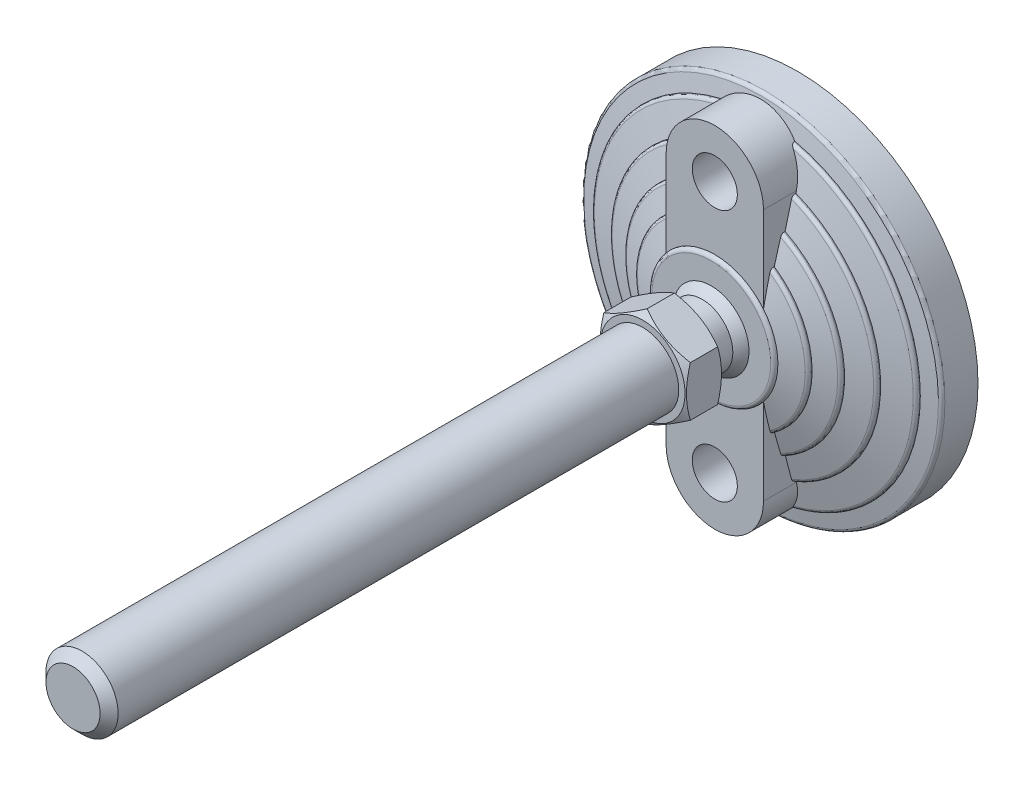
ISO-10303-21;
HEADER;
FILE_DESCRIPTION(('STEP AP214'),'2;1');
FILE_NAME('part.step','',(''),(''),'','','');
FILE_SCHEMA(('AUTOMOTIVE_DESIGN { 1 0 10303 214 1 1 1 1 }'));
ENDSEC;
DATA;
#1=APPLICATION_CONTEXT('core data for automotive mechanical design processes');
#2=APPLICATION_PROTOCOL_DEFINITION('international standard','automotive_design',2000,#1);
#3=PRODUCT_CONTEXT('',#1,'mechanical');
#4=PRODUCT('Part','Part','',(#3));
#5=PRODUCT_RELATED_PRODUCT_CATEGORY('part','',(#4));
#6=PRODUCT_DEFINITION_FORMATION('','',#4);
#7=PRODUCT_DEFINITION_CONTEXT('part definition',#1,'design');
#8=PRODUCT_DEFINITION('design','',#6,#7);
#9=PRODUCT_DEFINITION_SHAPE('','',#8);
#10=(LENGTH_UNIT() NAMED_UNIT(*) SI_UNIT(.MILLI.,.METRE.));
#11=(NAMED_UNIT(*) PLANE_ANGLE_UNIT() SI_UNIT($,.RADIAN.));
#12=(NAMED_UNIT(*) SI_UNIT($,.STERADIAN.) SOLID_ANGLE_UNIT());
#13=UNCERTAINTY_MEASURE_WITH_UNIT(LENGTH_MEASURE(1.E-05),#10,'distance_accuracy_value','');
#14=(GEOMETRIC_REPRESENTATION_CONTEXT(3) GLOBAL_UNCERTAINTY_ASSIGNED_CONTEXT((#13)) GLOBAL_UNIT_ASSIGNED_CONTEXT((#10,
#11,#12)) REPRESENTATION_CONTEXT('',''));
#15=CARTESIAN_POINT('',(0.,0.,0.));
#16=DIRECTION('',(0.,0.,1.));
#17=DIRECTION('',(1.,0.,0.));
#18=AXIS2_PLACEMENT_3D('',#15,#16,#17);
#19=CARTESIAN_POINT('',(-12.,14.022683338,36.));
#20=DIRECTION('',(0.,0.,1.));
#21=DIRECTION('',(0.,-1.,0.));
#22=AXIS2_PLACEMENT_3D('',#19,#20,#21);
#23=PLANE('',#22);
#24=CARTESIAN_POINT('',(0.,0.,36.));
#25=DIRECTION('',(0.,0.,-1.));
#26=DIRECTION('',(0.,1.,0.));
#27=AXIS2_PLACEMENT_3D('',#24,#25,#26);
#28=CIRCLE('',#27,11.75);
#29=CARTESIAN_POINT('',(0.,11.75,36.));
#30=VERTEX_POINT('',#29);
#31=EDGE_CURVE('E260',#30,#30,#28,.T.);
#32=ORIENTED_EDGE('',*,*,#31,.T.);
#33=EDGE_LOOP('',(#32));
#34=FACE_BOUND('',#33,.T.);
#35=CARTESIAN_POINT('',(0.,0.,36.));
#36=DIRECTION('',(0.,0.,-1.));
#37=DIRECTION('',(0.,1.,0.));
#38=AXIS2_PLACEMENT_3D('',#35,#36,#37);
#39=CIRCLE('',#38,8.5);
#40=CARTESIAN_POINT('',(0.,8.5,36.));
#41=VERTEX_POINT('',#40);
#42=EDGE_CURVE('E274',#41,#41,#39,.T.);
#43=ORIENTED_EDGE('',*,*,#42,.F.);
#44=EDGE_LOOP('',(#43));
#45=FACE_BOUND('',#44,.T.);
#46=ADVANCED_FACE('F14',(#34,#45),#23,.F.);
#47=CARTESIAN_POINT('',(0.,0.,36.));
#48=DIRECTION('',(0.,0.,-1.));
#49=DIRECTION('',(0.,1.,0.));
#50=AXIS2_PLACEMENT_3D('',#47,#48,#49);
#51=CYLINDRICAL_SURFACE('',#50,8.5);
#52=CARTESIAN_POINT('',(0.,0.,29.5));
#53=DIRECTION('',(0.,0.,-1.));
#54=DIRECTION('',(0.,1.,0.));
#55=AXIS2_PLACEMENT_3D('',#52,#53,#54);
#56=CIRCLE('',#55,8.5);
#57=CARTESIAN_POINT('',(0.,8.5,29.5));
#58=VERTEX_POINT('',#57);
#59=EDGE_CURVE('E573',#58,#58,#56,.F.);
#60=ORIENTED_EDGE('',*,*,#59,.T.);
#61=EDGE_LOOP('',(#60));
#62=FACE_BOUND('',#61,.T.);
#63=ORIENTED_EDGE('',*,*,#42,.T.);
#64=EDGE_LOOP('',(#63));
#65=FACE_BOUND('',#64,.T.);
#66=ADVANCED_FACE('F1291',(#62,#65),#51,.T.);
#67=CARTESIAN_POINT('',(-44.173478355,44.022,0.));
#68=DIRECTION('',(0.,0.,1.));
#69=DIRECTION('',(0.,-1.,0.));
#70=AXIS2_PLACEMENT_3D('',#67,#68,#69);
#71=PLANE('',#70);
#72=CARTESIAN_POINT('',(0.,0.,0.));
#73=DIRECTION('',(0.,0.,-1.));
#74=DIRECTION('',(0.,1.,0.));
#75=AXIS2_PLACEMENT_3D('',#72,#73,#74);
#76=CIRCLE('',#75,43.5);
#77=CARTESIAN_POINT('',(0.,43.5,0.));
#78=VERTEX_POINT('',#77);
#79=EDGE_CURVE('E576',#78,#78,#76,.F.);
#80=ORIENTED_EDGE('',*,*,#79,.F.);
#81=EDGE_LOOP('',(#80));
#82=FACE_BOUND('',#81,.T.);
#83=ADVANCED_FACE('F1280',(#82),#71,.F.);
#84=CARTESIAN_POINT('',(-8.631599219,8.622532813,29.5));
#85=DIRECTION('',(0.,0.,1.));
#86=DIRECTION('',(0.,-1.,0.));
#87=AXIS2_PLACEMENT_3D('',#84,#85,#86);
#88=PLANE('',#87);
#89=CARTESIAN_POINT('',(0.,0.,29.5));
#90=DIRECTION('',(0.,0.,-1.));
#91=DIRECTION('',(0.,1.,0.));
#92=AXIS2_PLACEMENT_3D('',#89,#90,#91);
#93=CIRCLE('',#92,8.49107182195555);
#94=CARTESIAN_POINT('',(0.,8.49107182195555,29.5));
#95=VERTEX_POINT('',#94);
#96=EDGE_CURVE('E579',#95,#95,#93,.T.);
#97=ORIENTED_EDGE('',*,*,#96,.F.);
#98=EDGE_LOOP('',(#97));
#99=FACE_BOUND('',#98,.T.);
#100=ORIENTED_EDGE('',*,*,#59,.F.);
#101=EDGE_LOOP('',(#100));
#102=FACE_BOUND('',#101,.T.);
#103=ADVANCED_FACE('F1275',(#99,#102),#88,.F.);
#104=CARTESIAN_POINT('',(0.,0.,3.));
#105=DIRECTION('',(0.,0.,-1.));
#106=DIRECTION('',(0.,1.,0.));
#107=AXIS2_PLACEMENT_3D('',#104,#105,#106);
#108=CYLINDRICAL_SURFACE('',#107,43.5);
#109=ORIENTED_EDGE('',*,*,#79,.T.);
#110=EDGE_LOOP('',(#109));
#111=FACE_BOUND('',#110,.T.);
#112=CARTESIAN_POINT('',(0.,0.,3.));
#113=DIRECTION('',(0.,0.,-1.));
#114=DIRECTION('',(0.,1.,0.));
#115=AXIS2_PLACEMENT_3D('',#112,#113,#114);
#116=CIRCLE('',#115,43.5);
#117=CARTESIAN_POINT('',(0.,43.5,3.));
#118=VERTEX_POINT('',#117);
#119=EDGE_CURVE('E582',#118,#118,#116,.T.);
#120=ORIENTED_EDGE('',*,*,#119,.T.);
#121=EDGE_LOOP('',(#120));
#122=FACE_BOUND('',#121,.T.);
#123=ADVANCED_FACE('F1268',(#111,#122),#108,.T.);
#124=CARTESIAN_POINT('',(-6.346764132,-28.675,3.));
#125=DIRECTION('',(0.,0.,1.));
#126=DIRECTION('',(0.,-1.,0.));
#127=AXIS2_PLACEMENT_3D('',#124,#125,#126);
#128=PLANE('',#127);
#129=CARTESIAN_POINT('',(0.,-35.,3.));
#130=DIRECTION('',(0.,0.,1.));
#131=DIRECTION('',(0.,-1.,0.));
#132=AXIS2_PLACEMENT_3D('',#129,#130,#131);
#133=CIRCLE('',#132,6.25);
#134=CARTESIAN_POINT('',(0.,-41.25,3.));
#135=VERTEX_POINT('',#134);
#136=EDGE_CURVE('E585',#135,#135,#133,.T.);
#137=ORIENTED_EDGE('',*,*,#136,.T.);
#138=EDGE_LOOP('',(#137));
#139=FACE_BOUND('',#138,.T.);
#140=ADVANCED_FACE('F774',(#139),#128,.T.);
#141=CARTESIAN_POINT('',(0.,0.,20.670266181));
#142=DIRECTION('',(0.,0.,-1.));
#143=DIRECTION('',(1.,0.,0.));
#144=AXIS2_PLACEMENT_3D('',#141,#142,#143);
#145=SPHERICAL_SURFACE('',#144,12.25);
#146=CARTESIAN_POINT('',(0.,0.,27.));
#147=DIRECTION('',(0.,0.,-1.));
#148=DIRECTION('',(0.,1.,0.));
#149=AXIS2_PLACEMENT_3D('',#146,#147,#148);
#150=CIRCLE('',#149,10.4879440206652);
#151=CARTESIAN_POINT('',(0.,10.4879440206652,27.));
#152=VERTEX_POINT('',#151);
#153=EDGE_CURVE('E588',#152,#152,#150,.F.);
#154=ORIENTED_EDGE('',*,*,#153,.T.);
#155=EDGE_LOOP('',(#154));
#156=FACE_BOUND('',#155,.T.);
#157=ORIENTED_EDGE('',*,*,#96,.T.);
#158=EDGE_LOOP('',(#157));
#159=FACE_BOUND('',#158,.T.);
#160=ADVANCED_FACE('F764',(#156,#159),#145,.T.);
#161=CARTESIAN_POINT('',(-50.774113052,50.6,3.));
#162=DIRECTION('',(0.,0.,1.));
#163=DIRECTION('',(0.,-1.,0.));
#164=AXIS2_PLACEMENT_3D('',#161,#162,#163);
#165=PLANE('',#164);
#166=ORIENTED_EDGE('',*,*,#119,.F.);
#167=EDGE_LOOP('',(#166));
#168=FACE_BOUND('',#167,.T.);
#169=CARTESIAN_POINT('',(0.,0.,3.));
#170=DIRECTION('',(0.,0.,-1.));
#171=DIRECTION('',(0.,1.,0.));
#172=AXIS2_PLACEMENT_3D('',#169,#170,#171);
#173=CIRCLE('',#172,50.);
#174=CARTESIAN_POINT('',(0.,50.,3.));
#175=VERTEX_POINT('',#174);
#176=EDGE_CURVE('E538',#175,#175,#173,.F.);
#177=ORIENTED_EDGE('',*,*,#176,.F.);
#178=EDGE_LOOP('',(#177));
#179=FACE_BOUND('',#178,.T.);
#180=ADVANCED_FACE('F762',(#168,#179),#165,.F.);
#181=CARTESIAN_POINT('',(0.,-35.,3.));
#182=DIRECTION('',(0.,0.,1.));
#183=DIRECTION('',(0.,-1.,0.));
#184=AXIS2_PLACEMENT_3D('',#181,#182,#183);
#185=CYLINDRICAL_SURFACE('',#184,6.25);
#186=ORIENTED_EDGE('',*,*,#136,.F.);
#187=EDGE_LOOP('',(#186));
#188=FACE_BOUND('',#187,.T.);
#189=CARTESIAN_POINT('',(0.,-35.,26.));
#190=DIRECTION('',(0.,0.,1.));
#191=DIRECTION('',(0.,-1.,0.));
#192=AXIS2_PLACEMENT_3D('',#189,#190,#191);
#193=CIRCLE('',#192,6.25);
#194=CARTESIAN_POINT('',(0.,-41.25,26.));
#195=VERTEX_POINT('',#194);
#196=EDGE_CURVE('E521',#195,#195,#193,.T.);
#197=ORIENTED_EDGE('',*,*,#196,.T.);
#198=EDGE_LOOP('',(#197));
#199=FACE_BOUND('',#198,.T.);
#200=ADVANCED_FACE('F622',(#188,#199),#185,.F.);
#201=CARTESIAN_POINT('',(-16.755457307,-16.698,27.));
#202=DIRECTION('',(0.,0.,-1.));
#203=DIRECTION('',(0.,1.,0.));
#204=AXIS2_PLACEMENT_3D('',#201,#202,#203);
#205=PLANE('',#204);
#206=ORIENTED_EDGE('',*,*,#153,.F.);
#207=EDGE_LOOP('',(#206));
#208=FACE_BOUND('',#207,.T.);
#209=CARTESIAN_POINT('',(0.,0.,27.));
#210=DIRECTION('',(0.,0.,-1.));
#211=DIRECTION('',(0.,1.,0.));
#212=AXIS2_PLACEMENT_3D('',#209,#210,#211);
#213=CIRCLE('',#212,16.5);
#214=CARTESIAN_POINT('',(0.,16.5,27.));
#215=VERTEX_POINT('',#214);
#216=EDGE_CURVE('E520',#215,#215,#213,.T.);
#217=ORIENTED_EDGE('',*,*,#216,.F.);
#218=EDGE_LOOP('',(#217));
#219=FACE_BOUND('',#218,.T.);
#220=ADVANCED_FACE('F772',(#208,#219),#205,.F.);
#221=CARTESIAN_POINT('',(-6.346764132,41.325,3.));
#222=DIRECTION('',(0.,0.,1.));
#223=DIRECTION('',(0.,-1.,0.));
#224=AXIS2_PLACEMENT_3D('',#221,#222,#223);
#225=PLANE('',#224);
#226=CARTESIAN_POINT('',(0.,35.,3.));
#227=DIRECTION('',(0.,0.,1.));
#228=DIRECTION('',(0.,-1.,0.));
#229=AXIS2_PLACEMENT_3D('',#226,#227,#228);
#230=CIRCLE('',#229,6.25);
#231=CARTESIAN_POINT('',(0.,28.75,3.));
#232=VERTEX_POINT('',#231);
#233=EDGE_CURVE('E639',#232,#232,#230,.T.);
#234=ORIENTED_EDGE('',*,*,#233,.T.);
#235=EDGE_LOOP('',(#234));
#236=FACE_BOUND('',#235,.T.);
#237=ADVANCED_FACE('F620',(#236),#225,.T.);
#238=CARTESIAN_POINT('',(0.,0.,26.));
#239=DIRECTION('',(0.,0.,-1.));
#240=DIRECTION('',(1.,0.,0.));
#241=AXIS2_PLACEMENT_3D('',#238,#239,#240);
#242=CONICAL_SURFACE('',#241,17.5,1.27229739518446);
#243=CARTESIAN_POINT('',(0.,0.,26.));
#244=DIRECTION('',(0.,0.,1.));
#245=DIRECTION('',(0.,-1.,0.));
#246=AXIS2_PLACEMENT_3D('',#243,#244,#245);
#247=CIRCLE('',#246,17.5);
#248=CARTESIAN_POINT('',(13.5000000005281,-11.1355287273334,25.999999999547));
#249=VERTEX_POINT('',#248);
#250=CARTESIAN_POINT('',(13.5000000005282,11.1355287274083,25.9999999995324));
#251=VERTEX_POINT('',#250);
#252=EDGE_CURVE('E517',#249,#251,#247,.T.);
#253=ORIENTED_EDGE('',*,*,#252,.F.);
#254=CARTESIAN_POINT('',(13.5,-18.9832672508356,24.2172043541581));
#255=CARTESIAN_POINT('',(13.5,-18.6579649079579,24.2987714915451));
#256=CARTESIAN_POINT('',(13.5,-18.3324976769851,24.3796813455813));
#257=CARTESIAN_POINT('',(13.5,-17.6811977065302,24.5400241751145));
#258=CARTESIAN_POINT('',(13.5,-17.3553649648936,24.6194571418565));
#259=CARTESIAN_POINT('',(13.5,-16.3773825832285,24.8552688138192));
#260=CARTESIAN_POINT('',(13.5,-15.7246371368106,25.0091884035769));
#261=CARTESIAN_POINT('',(13.5,-14.4172126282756,25.3088363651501));
#262=CARTESIAN_POINT('',(13.5,-13.7625334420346,25.4545641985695));
#263=CARTESIAN_POINT('',(13.5,-12.7787974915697,25.6654071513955));
#264=CARTESIAN_POINT('',(13.5,-12.4505717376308,25.7344021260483));
#265=CARTESIAN_POINT('',(13.5,-11.7935144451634,25.8694734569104));
#266=CARTESIAN_POINT('',(13.5,-11.4646828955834,25.9355497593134));
#267=CARTESIAN_POINT('',(13.5,-11.1355287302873,25.9999999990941));
#268=B_SPLINE_CURVE_WITH_KNOTS('',3,(#254,#255,#256,#257,#258,#259,#260,#261,#262,#263,#264,
#265,#266,#267),.UNSPECIFIED.,.F.,.F.,(4,2,2,2,2,2,4),(0.,1.00611699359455,2.01223994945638,
4.02414047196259,6.03617307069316,7.04235800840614,8.04856148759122),.UNSPECIFIED.);
#269=CARTESIAN_POINT('',(13.5,-18.9832672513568,24.2172043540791));
#270=VERTEX_POINT('',#269);
#271=EDGE_CURVE('E593',#270,#249,#268,.T.);
#272=ORIENTED_EDGE('',*,*,#271,.F.);
#273=CARTESIAN_POINT('',(3.16437848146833E-10,0.,24.217204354));
#274=DIRECTION('',(0.,0.,-1.));
#275=DIRECTION('',(1.,0.,0.));
#276=AXIS2_PLACEMENT_3D('',#273,#274,#275);
#277=CIRCLE('',#276,23.2940858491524);
#278=CARTESIAN_POINT('',(13.5,18.983267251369,24.2172043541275));
#279=VERTEX_POINT('',#278);
#280=EDGE_CURVE('E549',#279,#270,#277,.T.);
#281=ORIENTED_EDGE('',*,*,#280,.F.);
#282=CARTESIAN_POINT('',(13.5,11.1355287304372,25.9999999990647));
#283=CARTESIAN_POINT('',(13.5,11.4646828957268,25.9355497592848));
#284=CARTESIAN_POINT('',(13.5,11.7935144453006,25.8694734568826));
#285=CARTESIAN_POINT('',(13.5,12.4505717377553,25.7344021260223));
#286=CARTESIAN_POINT('',(13.5,12.7787974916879,25.6654071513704));
#287=CARTESIAN_POINT('',(13.5,13.762533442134,25.4545641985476));
#288=CARTESIAN_POINT('',(13.5,14.4172126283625,25.3088363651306));
#289=CARTESIAN_POINT('',(13.5,15.7246371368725,25.0091884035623));
#290=CARTESIAN_POINT('',(13.5,16.377382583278,24.8552688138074));
#291=CARTESIAN_POINT('',(13.5,17.3553649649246,24.619457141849));
#292=CARTESIAN_POINT('',(13.5,17.681197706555,24.5400241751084));
#293=CARTESIAN_POINT('',(13.5,18.3324976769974,24.3796813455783));
#294=CARTESIAN_POINT('',(13.5,18.6579649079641,24.2987714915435));
#295=CARTESIAN_POINT('',(13.5,18.9832672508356,24.2172043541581));
#296=B_SPLINE_CURVE_WITH_KNOTS('',3,(#282,#283,#284,#285,#286,#287,#288,#289,#290,#291,#292,
#293,#294,#295),.UNSPECIFIED.,.F.,.F.,(4,2,2,2,2,2,4),(0.,1.00620347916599,2.01238841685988,
4.02442101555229,6.03632153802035,7.04244449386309,8.04856148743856),.UNSPECIFIED.);
#297=EDGE_CURVE('E630',#251,#279,#296,.T.);
#298=ORIENTED_EDGE('',*,*,#297,.F.);
#299=EDGE_LOOP('',(#253,#272,#281,#298));
#300=FACE_BOUND('',#299,.T.);
#301=ADVANCED_FACE('F614',(#300),#242,.T.);
#302=CARTESIAN_POINT('',(13.267303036,19.999466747,23.261425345));
#303=CARTESIAN_POINT('',(29.097194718,9.49818825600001,23.261425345));
#304=CARTESIAN_POINT('',(29.097194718,-9.49818825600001,23.261425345));
#305=CARTESIAN_POINT('',(13.267303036,-19.999466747,23.261425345));
#306=CARTESIAN_POINT('',(13.267303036,19.999466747,23.716888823));
#307=CARTESIAN_POINT('',(29.097194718,9.49818825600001,23.716888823));
#308=CARTESIAN_POINT('',(29.097194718,-9.49818825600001,23.716888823));
#309=CARTESIAN_POINT('',(13.267303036,-19.999466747,23.716888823));
#310=CARTESIAN_POINT('',(13.117718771,19.773979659,24.083258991));
#311=CARTESIAN_POINT('',(28.769133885,9.39109946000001,24.083258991));
#312=CARTESIAN_POINT('',(28.769133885,-9.39109946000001,24.083258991));
#313=CARTESIAN_POINT('',(13.117718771,-19.773979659,24.083258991));
#314=CARTESIAN_POINT('',(12.877070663,19.411220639,24.217204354));
#315=CARTESIAN_POINT('',(28.241356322,9.218817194,24.217204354));
#316=CARTESIAN_POINT('',(28.241356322,-9.218817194,24.217204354));
#317=CARTESIAN_POINT('',(12.877070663,-19.411220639,24.217204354));
#318=(BOUNDED_SURFACE() B_SPLINE_SURFACE(3,3,((#302,#303,#304,#305),(#306,#307,#308,#309),(#310,
#311,#312,#313),(#314,#315,#316,#317)),.UNSPECIFIED.,.F.,.F.,
.F.) B_SPLINE_SURFACE_WITH_KNOTS((4,4),(4,4),(0.,1.),(0.,1.),
.UNSPECIFIED.) GEOMETRIC_REPRESENTATION_ITEM() RATIONAL_B_SPLINE_SURFACE(((1.,0.701869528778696,
0.701869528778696,1.),(0.869593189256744,0.610340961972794,0.610340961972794,0.869593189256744),
(0.869593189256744,0.610340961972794,0.610340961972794,0.869593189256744),(1.,0.701869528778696,
0.701869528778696,1.))) REPRESENTATION_ITEM('') SURFACE());
#319=CARTESIAN_POINT('',(13.5,-19.8431348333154,23.2614253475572));
#320=CARTESIAN_POINT('',(13.5,-19.8431370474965,23.2860556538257));
#321=CARTESIAN_POINT('',(13.5,-19.8420333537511,23.3106726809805));
#322=CARTESIAN_POINT('',(13.5,-19.8376465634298,23.3597018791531));
#323=CARTESIAN_POINT('',(13.5,-19.8343643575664,23.3841141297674));
#324=CARTESIAN_POINT('',(13.5,-19.8213486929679,23.4565201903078));
#325=CARTESIAN_POINT('',(13.5,-19.8084453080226,23.5039784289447));
#326=CARTESIAN_POINT('',(13.5,-19.7748969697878,23.5959548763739));
#327=CARTESIAN_POINT('',(13.5,-19.7542611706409,23.6404764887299));
#328=CARTESIAN_POINT('',(13.5,-19.7062220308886,23.7257350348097));
#329=CARTESIAN_POINT('',(13.5,-19.6788120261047,23.7664681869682));
#330=CARTESIAN_POINT('',(13.5,-19.6164784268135,23.8458096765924));
#331=CARTESIAN_POINT('',(13.5,-19.5811980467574,23.8841360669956));
#332=CARTESIAN_POINT('',(13.5,-19.5055204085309,23.9553392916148));
#333=CARTESIAN_POINT('',(13.5,-19.4651202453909,23.9882130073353));
#334=CARTESIAN_POINT('',(13.5,-19.3733614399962,24.0532792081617));
#335=CARTESIAN_POINT('',(13.5,-19.321293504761,24.0844693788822));
#336=CARTESIAN_POINT('',(13.5,-19.2133323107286,24.139175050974));
#337=CARTESIAN_POINT('',(13.5,-19.1574401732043,24.1626927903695));
#338=CARTESIAN_POINT('',(13.5,-19.0617819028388,24.1957297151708));
#339=CARTESIAN_POINT('',(13.5,-19.022719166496,24.207311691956));
#340=CARTESIAN_POINT('',(13.5,-18.9832672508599,24.2172043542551));
#341=B_SPLINE_CURVE_WITH_KNOTS('',3,(#319,#320,#321,#322,#323,#324,#325,#326,#327,#328,#329,
#330,#331,#332,#333,#334,#335,#336,#337,#338,#339,#340),.UNSPECIFIED.,.F.,.F.,(4,2,2,2,2,2,2,2,
2,2,4),(0.,0.073840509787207,0.147650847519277,0.294398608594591,0.440973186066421,
0.587692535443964,0.743377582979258,0.899151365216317,1.08055916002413,1.26191399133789,
1.38396481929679),.UNSPECIFIED.);
#342=CARTESIAN_POINT('',(13.5,-19.8431348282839,23.2614253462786));
#343=VERTEX_POINT('',#342);
#344=EDGE_CURVE('E709',#343,#270,#341,.T.);
#345=CARTESIAN_POINT('',(0.,0.,23.261425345));
#346=DIRECTION('',(0.,0.,-1.));
#347=DIRECTION('',(0.,1.,0.));
#348=AXIS2_PLACEMENT_3D('',#345,#346,#347);
#349=CIRCLE('',#348,24.);
#350=CARTESIAN_POINT('',(13.5,19.8431348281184,23.2614253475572));
#351=VERTEX_POINT('',#350);
#352=EDGE_CURVE('E547',#351,#343,#349,.T.);
#353=CARTESIAN_POINT('',(13.5,18.9832672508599,24.2172043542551));
#354=CARTESIAN_POINT('',(13.5,19.0245269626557,24.2068474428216));
#355=CARTESIAN_POINT('',(13.5,19.0653049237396,24.1946763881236));
#356=CARTESIAN_POINT('',(13.5,19.1456358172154,24.1665827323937));
#357=CARTESIAN_POINT('',(13.5,19.1851861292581,24.1506526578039));
#358=CARTESIAN_POINT('',(13.5,19.3016874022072,24.0969581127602));
#359=CARTESIAN_POINT('',(13.5,19.3761277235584,24.0533765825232));
#360=CARTESIAN_POINT('',(13.5,19.4913457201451,23.9675664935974));
#361=CARTESIAN_POINT('',(13.5,19.5352290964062,23.9294496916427));
#362=CARTESIAN_POINT('',(13.5,19.6161219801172,23.8466003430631));
#363=CARTESIAN_POINT('',(13.5,19.6531483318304,23.801884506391));
#364=CARTESIAN_POINT('',(13.5,19.7189344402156,23.7060840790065));
#365=CARTESIAN_POINT('',(13.5,19.747615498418,23.6549449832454));
#366=CARTESIAN_POINT('',(13.5,19.7944064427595,23.5480322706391));
#367=CARTESIAN_POINT('',(13.5,19.8125331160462,23.4922661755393));
#368=CARTESIAN_POINT('',(13.5,19.8308153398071,23.4067306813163));
#369=CARTESIAN_POINT('',(13.5,19.8354249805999,23.3778585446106));
#370=CARTESIAN_POINT('',(13.5,19.8415861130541,23.3198066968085));
#371=CARTESIAN_POINT('',(13.5,19.8431393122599,23.2906271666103));
#372=CARTESIAN_POINT('',(13.5,19.8431348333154,23.2614253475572));
#373=B_SPLINE_CURVE_WITH_KNOTS('',3,(#353,#354,#355,#356,#357,#358,#359,#360,#361,#362,#363,
#364,#365,#366,#367,#368,#369,#370,#371,#372),.UNSPECIFIED.,.F.,.F.,(4,2,2,2,2,2,2,2,2,4),(0.,
0.127516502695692,0.25528869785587,0.511930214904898,0.685657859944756,0.858952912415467,
1.03383282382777,1.20843381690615,1.29600438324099,1.38352601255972),.UNSPECIFIED.);
#374=EDGE_CURVE('E638',#279,#351,#373,.T.);
#375=ORIENTED_EDGE('',*,*,#280,.T.);
#376=ORIENTED_EDGE('',*,*,#344,.F.);
#377=ORIENTED_EDGE('',*,*,#352,.F.);
#378=ORIENTED_EDGE('',*,*,#374,.F.);
#379=EDGE_LOOP('',(#375,#376,#377,#378));
#380=FACE_BOUND('',#379,.T.);
#381=ADVANCED_FACE('F619',(#380),#318,.T.);
#382=CARTESIAN_POINT('',(0.,0.,23.261425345));
#383=DIRECTION('',(0.,0.,-1.));
#384=DIRECTION('',(0.,1.,0.));
#385=AXIS2_PLACEMENT_3D('',#382,#383,#384);
#386=CYLINDRICAL_SURFACE('',#385,24.);
#387=CARTESIAN_POINT('',(0.,0.,23.));
#388=DIRECTION('',(0.,0.,-1.));
#389=DIRECTION('',(0.,1.,0.));
#390=AXIS2_PLACEMENT_3D('',#387,#388,#389);
#391=CIRCLE('',#390,24.);
#392=CARTESIAN_POINT('',(13.5,19.8431348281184,23.));
#393=VERTEX_POINT('',#392);
#394=CARTESIAN_POINT('',(13.5,-19.8431348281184,23.000000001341));
#395=VERTEX_POINT('',#394);
#396=EDGE_CURVE('E545',#393,#395,#391,.T.);
#397=ORIENTED_EDGE('',*,*,#396,.F.);
#398=DIRECTION('',(0.,0.,-1.));
#399=VECTOR('',#398,1.);
#400=CARTESIAN_POINT('',(13.5,19.8431348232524,21.4084486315));
#401=LINE('',#400,#399);
#402=EDGE_CURVE('E686',#351,#393,#401,.T.);
#403=ORIENTED_EDGE('',*,*,#402,.F.);
#404=ORIENTED_EDGE('',*,*,#352,.T.);
#405=DIRECTION('',(0.,0.,1.));
#406=VECTOR('',#405,1.);
#407=CARTESIAN_POINT('',(13.5,-19.8431348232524,21.4084486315));
#408=LINE('',#407,#406);
#409=EDGE_CURVE('E707',#395,#343,#408,.T.);
#410=ORIENTED_EDGE('',*,*,#409,.F.);
#411=EDGE_LOOP('',(#397,#403,#404,#410));
#412=FACE_BOUND('',#411,.T.);
#413=ADVANCED_FACE('F691',(#412),#386,.T.);
#414=CARTESIAN_POINT('',(0.,0.,23.));
#415=DIRECTION('',(0.,0.,-1.));
#416=DIRECTION('',(0.,1.,0.));
#417=AXIS2_PLACEMENT_3D('',#414,#415,#416);
#418=CONICAL_SURFACE('',#417,24.,1.24904577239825);
#419=ORIENTED_EDGE('',*,*,#396,.T.);
#420=CARTESIAN_POINT('',(13.5,-26.022897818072,21.2279240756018));
#421=CARTESIAN_POINT('',(13.5,-25.5091656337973,21.3799212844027));
#422=CARTESIAN_POINT('',(13.5,-24.9951778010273,21.5310587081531));
#423=CARTESIAN_POINT('',(13.5,-23.9666187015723,21.8312926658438));
#424=CARTESIAN_POINT('',(13.5,-23.4520474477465,21.9803892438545));
#425=CARTESIAN_POINT('',(13.5,-22.4222240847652,22.2762276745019));
#426=CARTESIAN_POINT('',(13.5,-21.9069719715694,22.422969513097));
#427=CARTESIAN_POINT('',(13.5,-20.8756730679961,22.713675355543));
#428=CARTESIAN_POINT('',(13.5,-20.3596262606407,22.8576392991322));
#429=CARTESIAN_POINT('',(13.5,-19.8431348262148,23.0000000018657));
#430=B_SPLINE_CURVE_WITH_KNOTS('',3,(#420,#421,#422,#423,#424,#425,#426,#427,#428,#429),
.UNSPECIFIED.,.F.,.F.,(4,2,2,2,4),(0.,1.60723934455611,3.21444392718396,4.82165809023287,
6.42890708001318),.UNSPECIFIED.);
#431=CARTESIAN_POINT('',(13.5,-26.0228978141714,21.2279240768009));
#432=VERTEX_POINT('',#431);
#433=EDGE_CURVE('E699',#432,#395,#430,.T.);
#434=ORIENTED_EDGE('',*,*,#433,.F.);
#435=CARTESIAN_POINT('',(-5.51341958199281E-10,0.,21.227924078));
#436=DIRECTION('',(0.,0.,-1.));
#437=DIRECTION('',(0.,1.,0.));
#438=AXIS2_PLACEMENT_3D('',#435,#436,#437);
#439=CIRCLE('',#438,29.3162277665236);
#440=CARTESIAN_POINT('',(13.5,26.0228978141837,21.2279240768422));
#441=VERTEX_POINT('',#440);
#442=EDGE_CURVE('E544',#441,#432,#439,.T.);
#443=ORIENTED_EDGE('',*,*,#442,.F.);
#444=CARTESIAN_POINT('',(13.5000000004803,19.8431348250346,23.0000000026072));
#445=CARTESIAN_POINT('',(13.5000000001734,20.3596262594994,22.8576392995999));
#446=CARTESIAN_POINT('',(13.5000000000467,20.8756730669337,22.7136753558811));
#447=CARTESIAN_POINT('',(13.4999999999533,21.9069719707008,22.4229695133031));
#448=CARTESIAN_POINT('',(13.4999999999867,22.4222240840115,22.2762276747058));
#449=CARTESIAN_POINT('',(13.5000000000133,23.4520474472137,21.9803892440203));
#450=CARTESIAN_POINT('',(13.5000000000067,23.9666187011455,21.8312926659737));
#451=CARTESIAN_POINT('',(13.4999999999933,24.995177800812,21.5310587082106));
#452=CARTESIAN_POINT('',(13.4999999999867,25.5091656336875,21.3799212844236));
#453=CARTESIAN_POINT('',(13.5,26.022897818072,21.2279240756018));
#454=B_SPLINE_CURVE_WITH_KNOTS('',3,(#444,#445,#446,#447,#448,#449,#450,#451,#452,#453),
.UNSPECIFIED.,.F.,.F.,(4,2,2,2,4),(0.,1.60724899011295,3.2144631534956,4.82166773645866,
6.42890708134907),.UNSPECIFIED.);
#455=EDGE_CURVE('E679',#393,#441,#454,.T.);
#456=ORIENTED_EDGE('',*,*,#455,.F.);
#457=EDGE_LOOP('',(#419,#434,#443,#456));
#458=FACE_BOUND('',#457,.T.);
#459=ADVANCED_FACE('F687',(#458),#418,.T.);
#460=CARTESIAN_POINT('',(13.143890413,26.967353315,20.27924078));
#461=CARTESIAN_POINT('',(38.983891,14.372934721,20.27924078));
#462=CARTESIAN_POINT('',(38.983891,-14.372934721,20.27924078));
#463=CARTESIAN_POINT('',(13.143890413,-26.967353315,20.27924078));
#464=CARTESIAN_POINT('',(13.143890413,26.967353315,20.725161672));
#465=CARTESIAN_POINT('',(38.983891,14.372934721,20.725161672));
#466=CARTESIAN_POINT('',(38.983891,-14.372934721,20.725161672));
#467=CARTESIAN_POINT('',(13.143890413,-26.967353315,20.725161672));
#468=CARTESIAN_POINT('',(13.029654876,26.732975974,21.086911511));
#469=CARTESIAN_POINT('',(38.645076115,14.248017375,21.086911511));
#470=CARTESIAN_POINT('',(38.645076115,-14.248017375,21.086911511));
#471=CARTESIAN_POINT('',(13.029654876,-26.732975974,21.086911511));
#472=CARTESIAN_POINT('',(12.844309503,26.352702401,21.227924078));
#473=CARTESIAN_POINT('',(38.095354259,14.045340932,21.227924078));
#474=CARTESIAN_POINT('',(38.095354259,-14.045340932,21.227924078));
#475=CARTESIAN_POINT('',(12.844309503,-26.352702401,21.227924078));
#476=(BOUNDED_SURFACE() B_SPLINE_SURFACE(3,3,((#460,#461,#462,#463),(#464,#465,#466,#467),(#468,
#469,#470,#471),(#472,#473,#474,#475)),.UNSPECIFIED.,.F.,.F.,
.F.) B_SPLINE_SURFACE_WITH_KNOTS((4,4),(4,4),(0.,1.),(0.,1.),
.UNSPECIFIED.) GEOMETRIC_REPRESENTATION_ITEM() RATIONAL_B_SPLINE_SURFACE(((1.,0.625419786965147,
0.625419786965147,1.),(0.874161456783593,0.546717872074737,0.546717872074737,0.874161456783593),
(0.874161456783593,0.546717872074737,0.546717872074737,0.874161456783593),(1.,0.625419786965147,
0.625419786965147,1.))) REPRESENTATION_ITEM('') SURFACE());
#477=CARTESIAN_POINT('',(13.5,-26.7908566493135,20.2792407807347));
#478=CARTESIAN_POINT('',(13.5,-26.7908579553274,20.3051907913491));
#479=CARTESIAN_POINT('',(13.5,-26.7897247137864,20.3311275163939));
#480=CARTESIAN_POINT('',(13.5,-26.7852140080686,20.3827974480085));
#481=CARTESIAN_POINT('',(13.5,-26.781837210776,20.4085307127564));
#482=CARTESIAN_POINT('',(13.5,-26.7684139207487,20.4849772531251));
#483=CARTESIAN_POINT('',(13.5,-26.7550740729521,20.5351491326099));
#484=CARTESIAN_POINT('',(13.5,-26.7202107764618,20.632486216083));
#485=CARTESIAN_POINT('',(13.5,-26.6986916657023,20.6796529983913));
#486=CARTESIAN_POINT('',(13.5,-26.648348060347,20.7699105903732));
#487=CARTESIAN_POINT('',(13.5,-26.6195218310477,20.8130004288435));
#488=CARTESIAN_POINT('',(13.5,-26.5542840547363,20.8959059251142));
#489=CARTESIAN_POINT('',(13.5,-26.5176080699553,20.9355124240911));
#490=CARTESIAN_POINT('',(13.5,-26.4386436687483,21.0087234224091));
#491=CARTESIAN_POINT('',(13.5,-26.3963509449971,21.0423232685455));
#492=CARTESIAN_POINT('',(13.5,-26.3267001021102,21.0898793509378));
#493=CARTESIAN_POINT('',(13.5,-26.3008113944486,21.106038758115));
#494=CARTESIAN_POINT('',(13.5,-26.2478537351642,21.1362297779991));
#495=CARTESIAN_POINT('',(13.5,-26.2207861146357,21.1502637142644));
#496=CARTESIAN_POINT('',(13.5,-26.1657188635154,21.176151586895));
#497=CARTESIAN_POINT('',(13.5,-26.1377218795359,21.1880111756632));
#498=CARTESIAN_POINT('',(13.5,-26.0808891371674,21.2095853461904));
#499=CARTESIAN_POINT('',(13.5,-26.0520527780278,21.2192983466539));
#500=CARTESIAN_POINT('',(13.5,-26.0228978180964,21.2279240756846));
#501=B_SPLINE_CURVE_WITH_KNOTS('',3,(#477,#478,#479,#480,#481,#482,#483,#484,#485,#486,#487,
#488,#489,#490,#491,#492,#493,#494,#495,#496,#497,#498,#499,#500),.UNSPECIFIED.,.F.,.F.,(4,2,2,
2,2,2,2,2,2,2,2,4),(0.,0.0777993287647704,0.155575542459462,0.310500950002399,0.465344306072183,
0.620224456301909,0.78151106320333,0.942922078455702,1.03439248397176,1.12576216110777,
1.21689083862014,1.30808642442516),.UNSPECIFIED.);
#502=CARTESIAN_POINT('',(13.5,-26.7908566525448,20.27924078));
#503=VERTEX_POINT('',#502);
#504=EDGE_CURVE('E708',#503,#432,#501,.T.);
#505=CARTESIAN_POINT('',(0.,0.,20.27924078));
#506=DIRECTION('',(0.,0.,-1.));
#507=DIRECTION('',(0.,1.,0.));
#508=AXIS2_PLACEMENT_3D('',#505,#506,#507);
#509=CIRCLE('',#508,30.);
#510=CARTESIAN_POINT('',(13.5,26.7908566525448,20.2792407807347));
#511=VERTEX_POINT('',#510);
#512=EDGE_CURVE('E542',#511,#503,#509,.T.);
#513=CARTESIAN_POINT('',(13.5,26.0228978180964,21.2279240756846));
#514=CARTESIAN_POINT('',(13.5,26.0845570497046,21.2097134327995));
#515=CARTESIAN_POINT('',(13.5,26.1448460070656,21.1865640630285));
#516=CARTESIAN_POINT('',(13.5,26.2611194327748,21.1305926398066));
#517=CARTESIAN_POINT('',(13.5,26.3170802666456,21.0977216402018));
#518=CARTESIAN_POINT('',(13.5,26.422621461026,21.022592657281));
#519=CARTESIAN_POINT('',(13.5,26.4721821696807,20.9803067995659));
#520=CARTESIAN_POINT('',(13.5,26.5625156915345,20.887307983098));
#521=CARTESIAN_POINT('',(13.5,26.6033065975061,20.8366127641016));
#522=CARTESIAN_POINT('',(13.5,26.6708532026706,20.7331354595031));
#523=CARTESIAN_POINT('',(13.5,26.6985518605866,20.6809691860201));
#524=CARTESIAN_POINT('',(13.5,26.743619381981,20.5723560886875));
#525=CARTESIAN_POINT('',(13.5,26.7610021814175,20.5159151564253));
#526=CARTESIAN_POINT('',(13.5,26.7787549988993,20.4289072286));
#527=CARTESIAN_POINT('',(13.5,26.7832876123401,20.399138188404));
#528=CARTESIAN_POINT('',(13.5,26.78933789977,20.3393328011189));
#529=CARTESIAN_POINT('',(13.5,26.7908592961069,20.3092968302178));
#530=CARTESIAN_POINT('',(13.5,26.7908566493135,20.2792407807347));
#531=B_SPLINE_CURVE_WITH_KNOTS('',3,(#513,#514,#515,#516,#517,#518,#519,#520,#521,#522,#523,
#524,#525,#526,#527,#528,#529,#530),.UNSPECIFIED.,.F.,.F.,(4,2,2,2,2,2,2,2,4),(0.,
0.192810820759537,0.386609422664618,0.58098961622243,0.7749648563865,0.951184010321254,
1.12716456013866,1.21736691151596,1.30745768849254),.UNSPECIFIED.);
#532=EDGE_CURVE('E673',#441,#511,#531,.T.);
#533=ORIENTED_EDGE('',*,*,#442,.T.);
#534=ORIENTED_EDGE('',*,*,#504,.F.);
#535=ORIENTED_EDGE('',*,*,#512,.F.);
#536=ORIENTED_EDGE('',*,*,#532,.F.);
#537=EDGE_LOOP('',(#533,#534,#535,#536));
#538=FACE_BOUND('',#537,.T.);
#539=ADVANCED_FACE('F690',(#538),#476,.T.);
#540=CARTESIAN_POINT('',(0.,0.,20.27924078));
#541=DIRECTION('',(0.,0.,-1.));
#542=DIRECTION('',(0.,1.,0.));
#543=AXIS2_PLACEMENT_3D('',#540,#541,#542);
#544=CYLINDRICAL_SURFACE('',#543,30.);
#545=CARTESIAN_POINT('',(0.,0.,20.));
#546=DIRECTION('',(0.,0.,-1.));
#547=DIRECTION('',(0.,1.,0.));
#548=AXIS2_PLACEMENT_3D('',#545,#546,#547);
#549=CIRCLE('',#548,30.);
#550=CARTESIAN_POINT('',(13.5,26.7908566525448,20.));
#551=VERTEX_POINT('',#550);
#552=CARTESIAN_POINT('',(13.5,-26.7908566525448,19.9999999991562));
#553=VERTEX_POINT('',#552);
#554=EDGE_CURVE('E540',#551,#553,#549,.T.);
#555=ORIENTED_EDGE('',*,*,#554,.F.);
#556=DIRECTION('',(0.,0.,-1.));
#557=VECTOR('',#556,1.);
#558=CARTESIAN_POINT('',(13.5,26.7908566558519,21.4084486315));
#559=LINE('',#558,#557);
#560=EDGE_CURVE('E810',#511,#551,#559,.T.);
#561=ORIENTED_EDGE('',*,*,#560,.F.);
#562=ORIENTED_EDGE('',*,*,#512,.T.);
#563=DIRECTION('',(0.,0.,1.));
#564=VECTOR('',#563,1.);
#565=CARTESIAN_POINT('',(13.5,-26.7908566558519,21.4084486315));
#566=LINE('',#565,#564);
#567=EDGE_CURVE('E720',#553,#503,#566,.T.);
#568=ORIENTED_EDGE('',*,*,#567,.F.);
#569=EDGE_LOOP('',(#555,#561,#562,#568));
#570=FACE_BOUND('',#569,.T.);
#571=ADVANCED_FACE('F731',(#570),#544,.T.);
#572=CARTESIAN_POINT('',(0.,0.,20.));
#573=DIRECTION('',(0.,0.,-1.));
#574=DIRECTION('',(1.,0.,0.));
#575=AXIS2_PLACEMENT_3D('',#572,#573,#574);
#576=CONICAL_SURFACE('',#575,30.,1.29249666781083);
#577=ORIENTED_EDGE('',*,*,#554,.T.);
#578=CARTESIAN_POINT('',(13.5000000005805,-33.6690568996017,18.2072225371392));
#579=CARTESIAN_POINT('',(13.5000000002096,-33.0965095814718,18.3590521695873));
#580=CARTESIAN_POINT('',(13.5000000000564,-32.5238313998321,18.5103895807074));
#581=CARTESIAN_POINT('',(13.4999999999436,-31.3781752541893,18.8119124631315));
#582=CARTESIAN_POINT('',(13.4999999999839,-30.8051972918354,18.9620979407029));
#583=CARTESIAN_POINT('',(13.5000000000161,-29.6588964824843,19.2611513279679));
#584=CARTESIAN_POINT('',(13.5000000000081,-29.0855736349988,19.4100192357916));
#585=CARTESIAN_POINT('',(13.4999999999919,-27.9385277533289,19.7062178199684));
#586=CARTESIAN_POINT('',(13.4999999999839,-27.3648047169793,19.8535484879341));
#587=CARTESIAN_POINT('',(13.5,-26.7908566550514,19.9999999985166));
#588=B_SPLINE_CURVE_WITH_KNOTS('',3,(#578,#579,#580,#581,#582,#583,#584,#585,#586,#587),
.UNSPECIFIED.,.F.,.F.,(4,2,2,2,4),(0.,1.7770100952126,3.55401051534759,5.33101345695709,
7.10802608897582),.UNSPECIFIED.);
#589=CARTESIAN_POINT('',(13.5,-33.6690569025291,18.2072225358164));
#590=VERTEX_POINT('',#589);
#591=EDGE_CURVE('E721',#590,#553,#588,.T.);
#592=ORIENTED_EDGE('',*,*,#591,.F.);
#593=CARTESIAN_POINT('',(3.08438170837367E-10,0.,18.207222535));
#594=DIRECTION('',(0.,0.,-1.));
#595=DIRECTION('',(0.,1.,0.));
#596=AXIS2_PLACEMENT_3D('',#593,#594,#595);
#597=CIRCLE('',#596,36.2747211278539);
#598=CARTESIAN_POINT('',(13.5,33.6690569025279,18.2072225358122));
#599=VERTEX_POINT('',#598);
#600=EDGE_CURVE('E539',#599,#590,#597,.T.);
#601=ORIENTED_EDGE('',*,*,#600,.F.);
#602=CARTESIAN_POINT('',(13.5000000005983,26.790856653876,19.9999999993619));
#603=CARTESIAN_POINT('',(13.5000000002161,27.3648047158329,19.85354848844));
#604=CARTESIAN_POINT('',(13.5000000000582,27.9385277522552,19.7062178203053));
#605=CARTESIAN_POINT('',(13.4999999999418,29.0855736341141,19.4100192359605));
#606=CARTESIAN_POINT('',(13.4999999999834,29.6588964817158,19.2611513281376));
#607=CARTESIAN_POINT('',(13.5000000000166,30.8051972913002,18.9620979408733));
#608=CARTESIAN_POINT('',(13.5000000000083,31.378175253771,18.8119124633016));
#609=CARTESIAN_POINT('',(13.4999999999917,32.523831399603,18.5103895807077));
#610=CARTESIAN_POINT('',(13.4999999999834,33.0965095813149,18.359052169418));
#611=CARTESIAN_POINT('',(13.5,33.6690568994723,18.2072225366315));
#612=B_SPLINE_CURVE_WITH_KNOTS('',3,(#602,#603,#604,#605,#606,#607,#608,#609,#610,#611),
.UNSPECIFIED.,.F.,.F.,(4,2,2,2,4),(0.,1.77701263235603,3.55401557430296,5.3310159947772,
7.10802609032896),.UNSPECIFIED.);
#613=EDGE_CURVE('E666',#551,#599,#612,.T.);
#614=ORIENTED_EDGE('',*,*,#613,.F.);
#615=EDGE_LOOP('',(#577,#592,#601,#614));
#616=FACE_BOUND('',#615,.T.);
#617=ADVANCED_FACE('F727',(#616),#576,.T.);
#618=CARTESIAN_POINT('',(13.003667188,34.639639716,17.245698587));
#619=CARTESIAN_POINT('',(51.0914438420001,20.341547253,17.245698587));
#620=CARTESIAN_POINT('',(51.0914438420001,-20.341547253,17.245698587));
#621=CARTESIAN_POINT('',(13.003667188,-34.639639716,17.245698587));
#622=CARTESIAN_POINT('',(13.003667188,34.639639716,17.709515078));
#623=CARTESIAN_POINT('',(51.091443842,20.341547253,17.709515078));
#624=CARTESIAN_POINT('',(51.091443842,-20.341547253,17.709515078));
#625=CARTESIAN_POINT('',(13.003667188,-34.639639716,17.709515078));
#626=CARTESIAN_POINT('',(12.905504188,34.378149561,18.079802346));
#627=CARTESIAN_POINT('',(50.705761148,20.187991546,18.079802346));
#628=CARTESIAN_POINT('',(50.705761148,-20.187991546,18.079802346));
#629=CARTESIAN_POINT('',(12.905504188,-34.378149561,18.079802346));
#630=CARTESIAN_POINT('',(12.748767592,33.960628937,18.207222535));
#631=CARTESIAN_POINT('',(50.089942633,19.942809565,18.207222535));
#632=CARTESIAN_POINT('',(50.089942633,-19.942809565,18.207222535));
#633=CARTESIAN_POINT('',(12.748767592,-33.960628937,18.207222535));
#634=(BOUNDED_SURFACE() B_SPLINE_SURFACE(3,3,((#618,#619,#620,#621),(#622,#623,#624,#625),(#626,
#627,#628,#629),(#630,#631,#632,#633)),.UNSPECIFIED.,.F.,.F.,
.F.) B_SPLINE_SURFACE_WITH_KNOTS((4,4),(4,4),(0.,1.),(0.,1.),
.UNSPECIFIED.) GEOMETRIC_REPRESENTATION_ITEM() RATIONAL_B_SPLINE_SURFACE(((1.,0.56763364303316,
0.56763364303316,1.),(0.865565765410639,0.491324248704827,0.491324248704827,0.865565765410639),
(0.865565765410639,0.491324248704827,0.491324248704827,0.865565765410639),(1.,0.56763364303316,
0.56763364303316,1.))) REPRESENTATION_ITEM('') SURFACE());
#635=CARTESIAN_POINT('',(13.5,-34.4492380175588,17.2456985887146));
#636=CARTESIAN_POINT('',(13.5,-34.4492388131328,17.2724185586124));
#637=CARTESIAN_POINT('',(13.5,-34.4480869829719,17.2991252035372));
#638=CARTESIAN_POINT('',(13.5,-34.4434985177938,17.3523366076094));
#639=CARTESIAN_POINT('',(13.5,-34.4400623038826,17.3788414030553));
#640=CARTESIAN_POINT('',(13.5,-34.42638545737,17.457641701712));
#641=CARTESIAN_POINT('',(13.5,-34.4127763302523,17.5093910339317));
#642=CARTESIAN_POINT('',(13.5,-34.3771048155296,17.6098360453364));
#643=CARTESIAN_POINT('',(13.5,-34.3550440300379,17.6585323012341));
#644=CARTESIAN_POINT('',(13.5,-34.3032810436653,17.7516688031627));
#645=CARTESIAN_POINT('',(13.5,-34.2735788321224,17.7961090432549));
#646=CARTESIAN_POINT('',(13.5,-34.2066078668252,17.8808807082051));
#647=CARTESIAN_POINT('',(13.5,-34.1691521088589,17.9210639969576));
#648=CARTESIAN_POINT('',(13.5,-34.0883643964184,17.9950807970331));
#649=CARTESIAN_POINT('',(13.5,-34.045025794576,18.0289070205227));
#650=CARTESIAN_POINT('',(13.5,-33.9488589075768,18.0927883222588));
#651=CARTESIAN_POINT('',(13.5,-33.8955116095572,18.1220613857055));
#652=CARTESIAN_POINT('',(13.5,-33.7848588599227,18.1715344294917));
#653=CARTESIAN_POINT('',(13.5,-33.727559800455,18.1917486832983));
#654=CARTESIAN_POINT('',(13.5,-33.6690568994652,18.2072225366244));
#655=B_SPLINE_CURVE_WITH_KNOTS('',3,(#635,#636,#637,#638,#639,#640,#641,#642,#643,#644,#645,
#646,#647,#648,#649,#650,#651,#652,#653,#654),.UNSPECIFIED.,.F.,.F.,(4,2,2,2,2,2,2,2,2,4),(0.,
0.0801088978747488,0.160203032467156,0.31989418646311,0.479555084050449,0.639216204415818,
0.803305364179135,0.967581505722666,1.14930395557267,1.33073905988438),.UNSPECIFIED.);
#656=CARTESIAN_POINT('',(13.5,-34.4492380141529,17.2456985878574));
#657=VERTEX_POINT('',#656);
#658=EDGE_CURVE('E603',#657,#590,#655,.T.);
#659=CARTESIAN_POINT('',(0.,0.,17.245698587));
#660=DIRECTION('',(0.,0.,-1.));
#661=DIRECTION('',(0.,1.,0.));
#662=AXIS2_PLACEMENT_3D('',#659,#660,#661);
#663=CIRCLE('',#662,37.);
#664=CARTESIAN_POINT('',(13.5,34.4492380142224,17.2456985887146));
#665=VERTEX_POINT('',#664);
#666=EDGE_CURVE('E536',#665,#657,#663,.T.);
#667=CARTESIAN_POINT('',(13.5,33.6690568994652,18.2072225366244));
#668=CARTESIAN_POINT('',(13.5,33.7285004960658,18.1914984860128));
#669=CARTESIAN_POINT('',(13.5,33.7866931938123,18.1708859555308));
#670=CARTESIAN_POINT('',(13.5,33.8990439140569,18.1203027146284));
#671=CARTESIAN_POINT('',(13.5,33.9531903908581,18.0903064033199));
#672=CARTESIAN_POINT('',(13.5,34.0556677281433,18.0214004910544));
#673=CARTESIAN_POINT('',(13.5,34.1039872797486,17.9824739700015));
#674=CARTESIAN_POINT('',(13.5,34.192879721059,17.8966704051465));
#675=CARTESIAN_POINT('',(13.5,34.2334627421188,17.8498039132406));
#676=CARTESIAN_POINT('',(13.5,34.3033335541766,17.7520897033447));
#677=CARTESIAN_POINT('',(13.5,34.3331130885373,17.7015938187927));
#678=CARTESIAN_POINT('',(13.5,34.3830581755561,17.5960457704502));
#679=CARTESIAN_POINT('',(13.5,34.4032299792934,17.5409965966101));
#680=CARTESIAN_POINT('',(13.5,34.4284319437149,17.4456451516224));
#681=CARTESIAN_POINT('',(13.5,34.4362159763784,17.4060504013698));
#682=CARTESIAN_POINT('',(13.5,34.4466250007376,17.32621177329));
#683=CARTESIAN_POINT('',(13.5,34.4492528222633,17.2859682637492));
#684=CARTESIAN_POINT('',(13.5,34.4492380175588,17.2456985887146));
#685=B_SPLINE_CURVE_WITH_KNOTS('',3,(#667,#668,#669,#670,#671,#672,#673,#674,#675,#676,#677,
#678,#679,#680,#681,#682,#683,#684),.UNSPECIFIED.,.F.,.F.,(4,2,2,2,2,2,2,2,4),(0.,
0.184329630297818,0.369166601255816,0.554356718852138,0.739302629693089,0.914257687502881,
1.08909875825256,1.2098399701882,1.33051489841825),.UNSPECIFIED.);
#686=EDGE_CURVE('E659',#599,#665,#685,.T.);
#687=ORIENTED_EDGE('',*,*,#600,.T.);
#688=ORIENTED_EDGE('',*,*,#658,.F.);
#689=ORIENTED_EDGE('',*,*,#666,.F.);
#690=ORIENTED_EDGE('',*,*,#686,.F.);
#691=EDGE_LOOP('',(#687,#688,#689,#690));
#692=FACE_BOUND('',#691,.T.);
#693=ADVANCED_FACE('F730',(#692),#634,.T.);
#694=CARTESIAN_POINT('',(0.,0.,17.245698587));
#695=DIRECTION('',(0.,0.,-1.));
#696=DIRECTION('',(1.,0.,0.));
#697=AXIS2_PLACEMENT_3D('',#694,#695,#696);
#698=CYLINDRICAL_SURFACE('',#697,37.);
#699=CARTESIAN_POINT('',(0.,0.,17.));
#700=DIRECTION('',(0.,0.,-1.));
#701=DIRECTION('',(0.,1.,0.));
#702=AXIS2_PLACEMENT_3D('',#699,#700,#701);
#703=CIRCLE('',#702,37.);
#704=CARTESIAN_POINT('',(13.5,34.4492380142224,17.000000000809));
#705=VERTEX_POINT('',#704);
#706=CARTESIAN_POINT('',(13.5,-34.4492380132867,17.0000000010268));
#707=VERTEX_POINT('',#706);
#708=EDGE_CURVE('E533',#705,#707,#703,.T.);
#709=ORIENTED_EDGE('',*,*,#708,.F.);
#710=DIRECTION('',(0.,0.,-1.));
#711=VECTOR('',#710,1.);
#712=CARTESIAN_POINT('',(13.5,34.4492380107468,21.4084486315));
#713=LINE('',#712,#711);
#714=EDGE_CURVE('E807',#665,#705,#713,.T.);
#715=ORIENTED_EDGE('',*,*,#714,.F.);
#716=ORIENTED_EDGE('',*,*,#666,.T.);
#717=DIRECTION('',(0.,0.,1.));
#718=VECTOR('',#717,1.);
#719=CARTESIAN_POINT('',(13.5,-34.4492380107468,21.4084486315));
#720=LINE('',#719,#718);
#721=EDGE_CURVE('E602',#707,#657,#720,.T.);
#722=ORIENTED_EDGE('',*,*,#721,.F.);
#723=EDGE_LOOP('',(#709,#715,#716,#722));
#724=FACE_BOUND('',#723,.T.);
#725=ADVANCED_FACE('F739',(#724),#698,.T.);
#726=CARTESIAN_POINT('',(0.,0.,12.180196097));
#727=DIRECTION('',(0.,0.,-1.));
#728=DIRECTION('',(0.,1.,0.));
#729=AXIS2_PLACEMENT_3D('',#726,#727,#728);
#730=CYLINDRICAL_SURFACE('',#729,50.);
#731=CARTESIAN_POINT('',(0.,0.,12.180196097));
#732=DIRECTION('',(0.,0.,1.));
#733=DIRECTION('',(0.,-1.,0.));
#734=AXIS2_PLACEMENT_3D('',#731,#732,#733);
#735=CIRCLE('',#734,50.);
#736=CARTESIAN_POINT('',(0.,-50.,12.180196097));
#737=VERTEX_POINT('',#736);
#738=EDGE_CURVE('E371',#737,#737,#735,.T.);
#739=ORIENTED_EDGE('',*,*,#738,.F.);
#740=EDGE_LOOP('',(#739));
#741=FACE_BOUND('',#740,.T.);
#742=ORIENTED_EDGE('',*,*,#176,.T.);
#743=EDGE_LOOP('',(#742));
#744=FACE_BOUND('',#743,.T.);
#745=ADVANCED_FACE('F748',(#741,#744),#730,.T.);
#746=CARTESIAN_POINT('',(13.5,-35.,16.816897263));
#747=DIRECTION('',(1.,0.,0.));
#748=DIRECTION('',(0.,1.,0.));
#749=AXIS2_PLACEMENT_3D('',#746,#747,#748);
#750=PLANE('',#749);
#751=ORIENTED_EDGE('',*,*,#409,.T.);
#752=ORIENTED_EDGE('',*,*,#344,.T.);
#753=ORIENTED_EDGE('',*,*,#271,.T.);
#754=DIRECTION('',(0.,-1.,0.));
#755=VECTOR('',#754,1.);
#756=CARTESIAN_POINT('',(13.5,-29.840990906,26.));
#757=LINE('',#756,#755);
#758=CARTESIAN_POINT('',(13.5,-35.0000000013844,26.));
#759=VERTEX_POINT('',#758);
#760=EDGE_CURVE('E796',#249,#759,#757,.T.);
#761=ORIENTED_EDGE('',*,*,#760,.T.);
#762=DIRECTION('',(0.,0.,1.));
#763=VECTOR('',#762,1.);
#764=CARTESIAN_POINT('',(13.5,-35.0000000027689,19.6119));
#765=LINE('',#764,#763);
#766=CARTESIAN_POINT('',(13.5,-34.9999999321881,16.8716672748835));
#767=VERTEX_POINT('',#766);
#768=EDGE_CURVE('E370',#767,#759,#765,.T.);
#769=ORIENTED_EDGE('',*,*,#768,.F.);
#770=CARTESIAN_POINT('',(13.4999999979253,-34.4492380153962,16.9999999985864));
#771=CARTESIAN_POINT('',(13.4999999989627,-34.5410365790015,16.9786323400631));
#772=CARTESIAN_POINT('',(13.4999999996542,-34.632832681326,16.9572541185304));
#773=CARTESIAN_POINT('',(13.5000000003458,-34.8164199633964,16.9144765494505));
#774=CARTESIAN_POINT('',(13.5000000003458,-34.9082111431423,16.8930772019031));
#775=CARTESIAN_POINT('',(13.5,-34.9999998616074,16.8716672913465));
#776=B_SPLINE_CURVE_WITH_KNOTS('',3,(#770,#771,#772,#773,#774,#775),.UNSPECIFIED.,.F.,.F.,(4,2,
4),(0.,0.282757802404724,0.565515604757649),.UNSPECIFIED.);
#777=EDGE_CURVE('E809',#707,#767,#776,.T.);
#778=ORIENTED_EDGE('',*,*,#777,.F.);
#779=ORIENTED_EDGE('',*,*,#721,.T.);
#780=ORIENTED_EDGE('',*,*,#658,.T.);
#781=ORIENTED_EDGE('',*,*,#591,.T.);
#782=ORIENTED_EDGE('',*,*,#567,.T.);
#783=ORIENTED_EDGE('',*,*,#504,.T.);
#784=ORIENTED_EDGE('',*,*,#433,.T.);
#785=EDGE_LOOP('',(#751,#752,#753,#761,#769,#778,#779,#780,#781,#782,#783,#784));
#786=FACE_BOUND('',#785,.T.);
#787=ADVANCED_FACE('F610',(#786),#750,.T.);
#788=CARTESIAN_POINT('',(-13.5,-48.770918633,26.));
#789=DIRECTION('',(0.,0.,-1.));
#790=DIRECTION('',(0.,1.,0.));
#791=AXIS2_PLACEMENT_3D('',#788,#789,#790);
#792=PLANE('',#791);
#793=ORIENTED_EDGE('',*,*,#196,.F.);
#794=EDGE_LOOP('',(#793));
#795=FACE_BOUND('',#794,.T.);
#796=ORIENTED_EDGE('',*,*,#760,.F.);
#797=CARTESIAN_POINT('',(0.,0.,26.));
#798=DIRECTION('',(0.,0.,-1.));
#799=DIRECTION('',(0.,1.,0.));
#800=AXIS2_PLACEMENT_3D('',#797,#798,#799);
#801=CIRCLE('',#800,17.5);
#802=CARTESIAN_POINT('',(-13.4999999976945,-11.1355287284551,26.));
#803=VERTEX_POINT('',#802);
#804=EDGE_CURVE('E790',#803,#249,#801,.F.);
#805=ORIENTED_EDGE('',*,*,#804,.F.);
#806=DIRECTION('',(0.,1.,0.));
#807=VECTOR('',#806,1.);
#808=CARTESIAN_POINT('',(-13.5,-22.996170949,26.));
#809=LINE('',#808,#807);
#810=CARTESIAN_POINT('',(-13.5,-35.,26.));
#811=VERTEX_POINT('',#810);
#812=EDGE_CURVE('E501',#811,#803,#809,.T.);
#813=ORIENTED_EDGE('',*,*,#812,.F.);
#814=CARTESIAN_POINT('',(0.,-35.,26.));
#815=DIRECTION('',(0.,0.,-1.));
#816=DIRECTION('',(1.,0.,0.));
#817=AXIS2_PLACEMENT_3D('',#814,#815,#816);
#818=CIRCLE('',#817,13.5);
#819=EDGE_CURVE('E372',#759,#811,#818,.T.);
#820=ORIENTED_EDGE('',*,*,#819,.F.);
#821=EDGE_LOOP('',(#796,#805,#813,#820));
#822=FACE_BOUND('',#821,.T.);
#823=ADVANCED_FACE('F756',(#795,#822),#792,.F.);
#824=CARTESIAN_POINT('',(0.,0.,26.));
#825=DIRECTION('',(0.,0.,-1.));
#826=DIRECTION('',(0.,1.,0.));
#827=AXIS2_PLACEMENT_3D('',#824,#825,#826);
#828=TOROIDAL_SURFACE('',#827,16.5,1.);
#829=ORIENTED_EDGE('',*,*,#216,.T.);
#830=EDGE_LOOP('',(#829));
#831=FACE_BOUND('',#830,.T.);
#832=CARTESIAN_POINT('',(0.,0.,26.));
#833=DIRECTION('',(0.,0.,-1.));
#834=DIRECTION('',(0.,1.,0.));
#835=AXIS2_PLACEMENT_3D('',#832,#833,#834);
#836=CIRCLE('',#835,17.5);
#837=CARTESIAN_POINT('',(-13.4999999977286,11.1355287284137,26.));
#838=VERTEX_POINT('',#837);
#839=EDGE_CURVE('E491',#803,#838,#836,.T.);
#840=ORIENTED_EDGE('',*,*,#839,.F.);
#841=ORIENTED_EDGE('',*,*,#804,.T.);
#842=ORIENTED_EDGE('',*,*,#252,.T.);
#843=CARTESIAN_POINT('',(0.,0.,26.));
#844=DIRECTION('',(0.,0.,-1.));
#845=DIRECTION('',(0.,1.,0.));
#846=AXIS2_PLACEMENT_3D('',#843,#844,#845);
#847=CIRCLE('',#846,17.5);
#848=EDGE_CURVE('E830',#251,#838,#847,.F.);
#849=ORIENTED_EDGE('',*,*,#848,.T.);
#850=EDGE_LOOP('',(#840,#841,#842,#849));
#851=FACE_BOUND('',#850,.T.);
#852=ADVANCED_FACE('F651',(#831,#851),#828,.T.);
#853=CARTESIAN_POINT('',(0.,35.,3.));
#854=DIRECTION('',(0.,0.,1.));
#855=DIRECTION('',(0.,-1.,0.));
#856=AXIS2_PLACEMENT_3D('',#853,#854,#855);
#857=CYLINDRICAL_SURFACE('',#856,6.25);
#858=ORIENTED_EDGE('',*,*,#233,.F.);
#859=EDGE_LOOP('',(#858));
#860=FACE_BOUND('',#859,.T.);
#861=CARTESIAN_POINT('',(0.,35.,26.));
#862=DIRECTION('',(0.,0.,1.));
#863=DIRECTION('',(0.,-1.,0.));
#864=AXIS2_PLACEMENT_3D('',#861,#862,#863);
#865=CIRCLE('',#864,6.25);
#866=CARTESIAN_POINT('',(0.,28.75,26.));
#867=VERTEX_POINT('',#866);
#868=EDGE_CURVE('E335',#867,#867,#865,.T.);
#869=ORIENTED_EDGE('',*,*,#868,.T.);
#870=EDGE_LOOP('',(#869));
#871=FACE_BOUND('',#870,.T.);
#872=ADVANCED_FACE('F344',(#860,#871),#857,.F.);
#873=CARTESIAN_POINT('',(13.5,10.992341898,16.816897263));
#874=DIRECTION('',(1.,0.,0.));
#875=DIRECTION('',(0.,1.,0.));
#876=AXIS2_PLACEMENT_3D('',#873,#874,#875);
#877=PLANE('',#876);
#878=DIRECTION('',(0.,0.,-1.));
#879=VECTOR('',#878,1.);
#880=CARTESIAN_POINT('',(13.5,34.9999999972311,19.6119));
#881=LINE('',#880,#879);
#882=CARTESIAN_POINT('',(13.5,34.9999999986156,26.));
#883=VERTEX_POINT('',#882);
#884=CARTESIAN_POINT('',(13.5,35.0000000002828,16.8716672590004));
#885=VERTEX_POINT('',#884);
#886=EDGE_CURVE('E334',#883,#885,#881,.T.);
#887=ORIENTED_EDGE('',*,*,#886,.F.);
#888=DIRECTION('',(0.,-1.,0.));
#889=VECTOR('',#888,1.);
#890=CARTESIAN_POINT('',(13.5,29.817764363,26.));
#891=LINE('',#890,#889);
#892=EDGE_CURVE('E827',#883,#251,#891,.T.);
#893=ORIENTED_EDGE('',*,*,#892,.T.);
#894=ORIENTED_EDGE('',*,*,#297,.T.);
#895=ORIENTED_EDGE('',*,*,#374,.T.);
#896=ORIENTED_EDGE('',*,*,#402,.T.);
#897=ORIENTED_EDGE('',*,*,#455,.T.);
#898=ORIENTED_EDGE('',*,*,#532,.T.);
#899=ORIENTED_EDGE('',*,*,#560,.T.);
#900=ORIENTED_EDGE('',*,*,#613,.T.);
#901=ORIENTED_EDGE('',*,*,#686,.T.);
#902=ORIENTED_EDGE('',*,*,#714,.T.);
#903=CARTESIAN_POINT('',(13.5,35.0000000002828,16.8716672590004));
#904=CARTESIAN_POINT('',(13.5,34.908211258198,16.8930771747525));
#905=CARTESIAN_POINT('',(13.5,34.8164200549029,16.9144765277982));
#906=CARTESIAN_POINT('',(13.5,34.6328327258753,16.9572541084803));
#907=CARTESIAN_POINT('',(13.5,34.5410366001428,16.9786323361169));
#908=CARTESIAN_POINT('',(13.5,34.4492380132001,17.000000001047));
#909=B_SPLINE_CURVE_WITH_KNOTS('',3,(#903,#904,#905,#906,#907,#908),.UNSPECIFIED.,.F.,.F.,(4,2,
4),(0.,0.282757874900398,0.565515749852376),.UNSPECIFIED.);
#910=EDGE_CURVE('E353',#885,#705,#909,.T.);
#911=ORIENTED_EDGE('',*,*,#910,.F.);
#912=EDGE_LOOP('',(#887,#893,#894,#895,#896,#897,#898,#899,#900,#901,#902,#911));
#913=FACE_BOUND('',#912,.T.);
#914=ADVANCED_FACE('F342',(#913),#877,.T.);
#915=CARTESIAN_POINT('',(0.,0.,17.));
#916=DIRECTION('',(0.,0.,-1.));
#917=DIRECTION('',(0.,1.,0.));
#918=AXIS2_PLACEMENT_3D('',#915,#916,#917);
#919=CONICAL_SURFACE('',#918,37.,1.32581766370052);
#920=ORIENTED_EDGE('',*,*,#910,.T.);
#921=ORIENTED_EDGE('',*,*,#708,.T.);
#922=ORIENTED_EDGE('',*,*,#777,.T.);
#923=CARTESIAN_POINT('',(10.9763923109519,-42.859313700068,15.1893660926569));
#924=CARTESIAN_POINT('',(11.0902470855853,-42.7003026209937,15.2208143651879));
#925=CARTESIAN_POINT('',(11.2005742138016,-42.5389181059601,15.2528659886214));
#926=CARTESIAN_POINT('',(11.4140175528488,-42.2116832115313,15.3181517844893));
#927=CARTESIAN_POINT('',(11.5171338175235,-42.0458328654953,15.3513859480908));
#928=CARTESIAN_POINT('',(11.8153810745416,-41.5420926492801,15.4528082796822));
#929=CARTESIAN_POINT('',(11.9994728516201,-41.1979264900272,15.522733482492));
#930=CARTESIAN_POINT('',(12.3326507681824,-40.5045455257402,15.6650837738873));
#931=CARTESIAN_POINT('',(12.4824970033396,-40.1556720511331,15.737402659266));
#932=CARTESIAN_POINT('',(12.7520641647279,-39.447292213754,15.8858534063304));
#933=CARTESIAN_POINT('',(12.8717896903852,-39.0877874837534,15.9619846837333));
#934=CARTESIAN_POINT('',(13.0622198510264,-38.4243028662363,16.1041347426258));
#935=CARTESIAN_POINT('',(13.1378349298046,-38.1216000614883,16.1695954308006));
#936=CARTESIAN_POINT('',(13.2678621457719,-37.5121519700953,16.3027279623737));
#937=CARTESIAN_POINT('',(13.322274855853,-37.2054067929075,16.3703997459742));
#938=CARTESIAN_POINT('',(13.4106518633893,-36.5828211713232,16.509215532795));
#939=CARTESIAN_POINT('',(13.444159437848,-36.2669255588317,16.5804026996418));
#940=CARTESIAN_POINT('',(13.4888437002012,-35.6339537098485,16.7246710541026));
#941=CARTESIAN_POINT('',(13.5000180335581,-35.3168773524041,16.7977524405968));
#942=CARTESIAN_POINT('',(13.5,-34.9999998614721,16.871667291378));
#943=B_SPLINE_CURVE_WITH_KNOTS('',3,(#923,#924,#925,#926,#927,#928,#929,#930,#931,#932,#933,
#934,#935,#936,#937,#938,#939,#940,#941,#942),.UNSPECIFIED.,.F.,.F.,(4,2,2,2,2,2,2,2,2,4),(0.,
0.594146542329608,1.1882886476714,2.37624851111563,3.53450882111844,4.69259215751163,
5.64827317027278,6.60392835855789,7.5797914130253,8.55575734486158),.UNSPECIFIED.);
#944=CARTESIAN_POINT('',(10.9763923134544,-42.8593136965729,15.1893660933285));
#945=VERTEX_POINT('',#944);
#946=EDGE_CURVE('E362',#945,#767,#943,.T.);
#947=ORIENTED_EDGE('',*,*,#946,.F.);
#948=CARTESIAN_POINT('',(2.42528219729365E-10,0.,15.189366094));
#949=DIRECTION('',(0.,0.,-1.));
#950=DIRECTION('',(1.,0.,0.));
#951=AXIS2_PLACEMENT_3D('',#948,#949,#950);
#952=CIRCLE('',#951,44.2425356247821);
#953=CARTESIAN_POINT('',(10.9763923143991,42.8593136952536,15.1893660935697));
#954=VERTEX_POINT('',#953);
#955=EDGE_CURVE('E514',#954,#945,#952,.T.);
#956=ORIENTED_EDGE('',*,*,#955,.F.);
#957=CARTESIAN_POINT('',(13.5,35.0000000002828,16.8716672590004));
#958=CARTESIAN_POINT('',(13.5000427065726,35.388203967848,16.7811118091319));
#959=CARTESIAN_POINT('',(13.483257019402,35.7767153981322,16.6918094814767));
#960=CARTESIAN_POINT('',(13.4161694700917,36.5515574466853,16.5160966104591));
#961=CARTESIAN_POINT('',(13.3658621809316,36.9378877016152,16.4296865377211));
#962=CARTESIAN_POINT('',(13.2335638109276,37.6957533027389,16.2623134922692));
#963=CARTESIAN_POINT('',(13.1524048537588,38.0674159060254,16.1812680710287));
#964=CARTESIAN_POINT('',(12.9587932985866,38.8031976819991,16.0226641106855));
#965=CARTESIAN_POINT('',(12.846347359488,39.1673184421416,15.9451048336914));
#966=CARTESIAN_POINT('',(12.6145915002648,39.8185376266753,15.8078727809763));
#967=CARTESIAN_POINT('',(12.5004567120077,40.1073551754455,15.7475582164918));
#968=CARTESIAN_POINT('',(12.2523231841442,40.6768873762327,15.6295958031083));
#969=CARTESIAN_POINT('',(12.1183253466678,40.9576023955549,15.5719478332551));
#970=CARTESIAN_POINT('',(11.8279807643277,41.5153469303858,15.4582871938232));
#971=CARTESIAN_POINT('',(11.6712235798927,41.7921750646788,15.4023343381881));
#972=CARTESIAN_POINT('',(11.3382342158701,42.3345673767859,15.2935032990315));
#973=CARTESIAN_POINT('',(11.1619981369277,42.6001292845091,15.2406257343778));
#974=CARTESIAN_POINT('',(10.9763923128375,42.8593136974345,15.1893660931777));
#975=B_SPLINE_CURVE_WITH_KNOTS('',3,(#957,#958,#959,#960,#961,#962,#963,#964,#965,#966,#967,
#968,#969,#970,#971,#972,#973,#974),.UNSPECIFIED.,.F.,.F.,(4,2,2,2,2,2,2,2,4),(0.,
1.19554847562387,2.3912905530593,3.55683895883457,4.7221394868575,5.67049672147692,
6.6188108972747,7.58705133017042,8.55548594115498),.UNSPECIFIED.);
#976=EDGE_CURVE('E326',#885,#954,#975,.T.);
#977=ORIENTED_EDGE('',*,*,#976,.F.);
#978=EDGE_LOOP('',(#920,#921,#922,#947,#956,#977));
#979=FACE_BOUND('',#978,.T.);
#980=ADVANCED_FACE('F337',(#979),#919,.T.);
#981=CARTESIAN_POINT('',(9.509200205,43.983805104,14.219223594));
#982=CARTESIAN_POINT('',(69.947296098,30.917224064,14.219223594));
#983=CARTESIAN_POINT('',(69.947296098,-30.917224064,14.219223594));
#984=CARTESIAN_POINT('',(9.509200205,-43.983805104,14.219223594));
#985=CARTESIAN_POINT('',(9.50920020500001,43.983805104,14.696951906));
#986=CARTESIAN_POINT('',(69.947296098,30.917224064,14.696951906));
#987=CARTESIAN_POINT('',(69.947296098,-30.917224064,14.696951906));
#988=CARTESIAN_POINT('',(9.50920020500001,-43.983805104,14.696951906));
#989=CARTESIAN_POINT('',(9.447073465,43.696444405,15.073499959));
#990=CARTESIAN_POINT('',(69.4903073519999,30.715231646,15.073499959));
#991=CARTESIAN_POINT('',(69.4903073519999,-30.715231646,15.073499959));
#992=CARTESIAN_POINT('',(9.447073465,-43.696444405,15.073499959));
#993=CARTESIAN_POINT('',(9.349136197,43.243445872,15.189366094));
#994=CARTESIAN_POINT('',(68.769905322,30.396808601,15.189366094));
#995=CARTESIAN_POINT('',(68.769905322,-30.396808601,15.189366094));
#996=CARTESIAN_POINT('',(9.349136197,-43.243445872,15.189366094));
#997=(BOUNDED_SURFACE() B_SPLINE_SURFACE(3,3,((#981,#982,#983,#984),(#985,#986,#987,#988),(#989,
#990,#991,#992),(#993,#994,#995,#996)),.UNSPECIFIED.,.F.,.F.,
.F.) B_SPLINE_SURFACE_WITH_KNOTS((4,4),(4,4),(0.,1.),(0.,1.),
.UNSPECIFIED.) GEOMETRIC_REPRESENTATION_ITEM() RATIONAL_B_SPLINE_SURFACE(((1.,0.474210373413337,
0.474210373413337,1.),(0.858803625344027,0.407253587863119,0.407253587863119,0.858803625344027),
(0.858803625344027,0.407253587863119,0.407253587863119,0.858803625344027),(1.,0.474210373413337,
0.474210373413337,1.))) REPRESENTATION_ITEM('') SURFACE());
#998=CARTESIAN_POINT('',(0.,0.,14.219223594));
#999=DIRECTION('',(0.,0.,-1.));
#1000=DIRECTION('',(0.,1.,0.));
#1001=AXIS2_PLACEMENT_3D('',#998,#999,#1000);
#1002=CIRCLE('',#1001,45.);
#1003=CARTESIAN_POINT('',(10.2161330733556,43.8250000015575,14.2192235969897));
#1004=VERTEX_POINT('',#1003);
#1005=CARTESIAN_POINT('',(10.216133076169,-43.8249999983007,14.2192235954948));
#1006=VERTEX_POINT('',#1005);
#1007=EDGE_CURVE('E510',#1004,#1006,#1002,.T.);
#1008=CARTESIAN_POINT('',(10.9763923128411,42.8593136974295,15.1893660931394));
#1009=CARTESIAN_POINT('',(10.9414184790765,42.9081655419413,15.1796813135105));
#1010=CARTESIAN_POINT('',(10.906315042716,42.9564954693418,15.1677025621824));
#1011=CARTESIAN_POINT('',(10.8360680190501,43.0519016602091,15.1389495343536));
#1012=CARTESIAN_POINT('',(10.8009246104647,43.0989738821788,15.1221614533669));
#1013=CARTESIAN_POINT('',(10.7305792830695,43.1919542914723,15.0833916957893));
#1014=CARTESIAN_POINT('',(10.6953822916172,43.2378400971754,15.0613467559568));
#1015=CARTESIAN_POINT('',(10.6259110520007,43.3272572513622,15.0118633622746));
#1016=CARTESIAN_POINT('',(10.5916356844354,43.3707915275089,14.9844318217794));
#1017=CARTESIAN_POINT('',(10.5256394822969,43.4536161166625,14.9245405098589));
#1018=CARTESIAN_POINT('',(10.4938728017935,43.4929947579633,14.8922570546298));
#1019=CARTESIAN_POINT('',(10.4481189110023,43.5491166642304,14.8392517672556));
#1020=CARTESIAN_POINT('',(10.4332041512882,43.5673083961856,14.8208503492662));
#1021=CARTESIAN_POINT('',(10.4041301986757,43.6025925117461,14.78238705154));
#1022=CARTESIAN_POINT('',(10.3899723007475,43.6196830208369,14.7623224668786));
#1023=CARTESIAN_POINT('',(10.3542455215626,43.662608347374,14.7076181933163));
#1024=CARTESIAN_POINT('',(10.3334614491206,43.6873719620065,14.6715913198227));
#1025=CARTESIAN_POINT('',(10.2956896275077,43.732103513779,14.5949209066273));
#1026=CARTESIAN_POINT('',(10.2786908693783,43.7520853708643,14.5542912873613));
#1027=CARTESIAN_POINT('',(10.2536278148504,43.7814230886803,14.4795639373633));
#1028=CARTESIAN_POINT('',(10.2443910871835,43.7921884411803,14.446417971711));
#1029=CARTESIAN_POINT('',(10.2295810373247,43.8094156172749,14.3782664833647));
#1030=CARTESIAN_POINT('',(10.2239986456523,43.8158880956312,14.3432657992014));
#1031=CARTESIAN_POINT('',(10.2190506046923,43.8216216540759,14.2931619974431));
#1032=CARTESIAN_POINT('',(10.2179590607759,43.8228858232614,14.2784273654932));
#1033=CARTESIAN_POINT('',(10.216499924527,43.8245753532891,14.248872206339));
#1034=CARTESIAN_POINT('',(10.2161324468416,43.8250005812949,14.2340516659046));
#1035=CARTESIAN_POINT('',(10.2161330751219,43.8249999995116,14.21922359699));
#1036=B_SPLINE_CURVE_WITH_KNOTS('',3,(#1008,#1009,#1010,#1011,#1012,#1013,#1014,#1015,#1016,
#1017,#1018,#1019,#1020,#1021,#1022,#1023,#1024,#1025,#1026,#1027,#1028,#1029,#1030,#1031,#1032,
#1033,#1034,#1035),.UNSPECIFIED.,.F.,.F.,(4,2,2,2,2,2,2,2,2,2,2,2,2,4),(0.,0.182552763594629,
0.36563486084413,0.551042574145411,0.736213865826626,0.91580836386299,1.00534306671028,
1.09502635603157,1.23975433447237,1.38405573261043,1.49181113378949,1.59929807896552,
1.64375005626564,1.68820907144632),.UNSPECIFIED.);
#1037=EDGE_CURVE('E318',#954,#1004,#1036,.T.);
#1038=CARTESIAN_POINT('',(10.2161330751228,-43.8249999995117,14.2192235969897));
#1039=CARTESIAN_POINT('',(10.2161249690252,-43.8250086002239,14.2397973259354));
#1040=CARTESIAN_POINT('',(10.2168379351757,-43.824184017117,14.2603638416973));
#1041=CARTESIAN_POINT('',(10.2196429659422,-43.8209356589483,14.3012464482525));
#1042=CARTESIAN_POINT('',(10.2217330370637,-43.8185141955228,14.321562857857));
#1043=CARTESIAN_POINT('',(10.2271943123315,-43.8121797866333,14.3615120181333));
#1044=CARTESIAN_POINT('',(10.230548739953,-43.8082863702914,14.3811501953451));
#1045=CARTESIAN_POINT('',(10.2384364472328,-43.7991167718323,14.4198571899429));
#1046=CARTESIAN_POINT('',(10.242970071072,-43.7938401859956,14.4389258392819));
#1047=CARTESIAN_POINT('',(10.2581066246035,-43.7761886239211,14.4948727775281));
#1048=CARTESIAN_POINT('',(10.2702836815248,-43.7619475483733,14.5307547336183));
#1049=CARTESIAN_POINT('',(10.2978960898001,-43.7294783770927,14.5993915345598));
#1050=CARTESIAN_POINT('',(10.313342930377,-43.7112362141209,14.6321347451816));
#1051=CARTESIAN_POINT('',(10.3565346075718,-43.6599003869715,14.7128958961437));
#1052=CARTESIAN_POINT('',(10.3861274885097,-43.6244290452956,14.7584076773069));
#1053=CARTESIAN_POINT('',(10.4489566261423,-43.5482023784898,14.8418473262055));
#1054=CARTESIAN_POINT('',(10.4822021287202,-43.5074335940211,14.8797552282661));
#1055=CARTESIAN_POINT('',(10.5436529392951,-43.4310889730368,14.9415576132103));
#1056=CARTESIAN_POINT('',(10.5714611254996,-43.3962063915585,14.9667253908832));
#1057=CARTESIAN_POINT('',(10.6279526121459,-43.3245847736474,15.0131545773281));
#1058=CARTESIAN_POINT('',(10.6566364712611,-43.2878445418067,15.0344134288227));
#1059=CARTESIAN_POINT('',(10.7434400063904,-43.1754150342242,15.0927116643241));
#1060=CARTESIAN_POINT('',(10.8023642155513,-43.0974519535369,15.1243230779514));
#1061=CARTESIAN_POINT('',(10.8805294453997,-42.9915669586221,15.1573317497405));
#1062=CARTESIAN_POINT('',(10.8997568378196,-42.9653233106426,15.1647354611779));
#1063=CARTESIAN_POINT('',(10.9381278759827,-42.9125478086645,15.178109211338));
#1064=CARTESIAN_POINT('',(10.957271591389,-42.8860171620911,15.1840838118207));
#1065=CARTESIAN_POINT('',(10.9763923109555,-42.859313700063,15.1893660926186));
#1066=B_SPLINE_CURVE_WITH_KNOTS('',3,(#1038,#1039,#1040,#1041,#1042,#1043,#1044,#1045,#1046,
#1047,#1048,#1049,#1050,#1051,#1052,#1053,#1054,#1055,#1056,#1057,#1058,#1059,#1060,#1061,#1062,
#1063,#1064,#1065),.UNSPECIFIED.,.F.,.F.,(4,2,2,2,2,2,2,2,2,2,2,2,2,4),(0.,0.0616807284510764,
0.123272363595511,0.184073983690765,0.244893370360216,0.365736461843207,0.487011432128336,
0.680458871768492,0.874407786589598,1.02785807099,1.18140839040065,1.48821944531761,
1.58829974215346,1.68805618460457),.UNSPECIFIED.);
#1067=EDGE_CURVE('E502',#1006,#945,#1066,.T.);
#1068=ORIENTED_EDGE('',*,*,#1007,.F.);
#1069=ORIENTED_EDGE('',*,*,#1037,.F.);
#1070=ORIENTED_EDGE('',*,*,#955,.T.);
#1071=ORIENTED_EDGE('',*,*,#1067,.F.);
#1072=EDGE_LOOP('',(#1068,#1069,#1070,#1071));
#1073=FACE_BOUND('',#1072,.T.);
#1074=ADVANCED_FACE('F341',(#1073),#997,.T.);
#1075=CARTESIAN_POINT('',(0.,0.,14.219223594));
#1076=DIRECTION('',(0.,0.,-1.));
#1077=DIRECTION('',(1.,0.,0.));
#1078=AXIS2_PLACEMENT_3D('',#1075,#1076,#1077);
#1079=CYLINDRICAL_SURFACE('',#1078,45.);
#1080=CARTESIAN_POINT('',(0.,0.,14.));
#1081=DIRECTION('',(0.,0.,-1.));
#1082=DIRECTION('',(0.,1.,0.));
#1083=AXIS2_PLACEMENT_3D('',#1080,#1081,#1082);
#1084=CIRCLE('',#1083,45.);
#1085=CARTESIAN_POINT('',(10.2161330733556,43.8250000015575,14.));
#1086=VERTEX_POINT('',#1085);
#1087=CARTESIAN_POINT('',(10.2161330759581,-43.8249999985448,14.0000000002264));
#1088=VERTEX_POINT('',#1087);
#1089=EDGE_CURVE('E507',#1086,#1088,#1084,.T.);
#1090=ORIENTED_EDGE('',*,*,#1089,.F.);
#1091=DIRECTION('',(0.,0.,-1.));
#1092=VECTOR('',#1091,1.);
#1093=CARTESIAN_POINT('',(10.2161330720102,43.825000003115,19.6119));
#1094=LINE('',#1093,#1092);
#1095=EDGE_CURVE('E408',#1004,#1086,#1094,.T.);
#1096=ORIENTED_EDGE('',*,*,#1095,.F.);
#1097=ORIENTED_EDGE('',*,*,#1007,.T.);
#1098=DIRECTION('',(0.,0.,1.));
#1099=VECTOR('',#1098,1.);
#1100=CARTESIAN_POINT('',(10.2161330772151,-43.8249999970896,19.6119));
#1101=LINE('',#1100,#1099);
#1102=EDGE_CURVE('E526',#1088,#1006,#1101,.T.);
#1103=ORIENTED_EDGE('',*,*,#1102,.F.);
#1104=EDGE_LOOP('',(#1090,#1096,#1097,#1103));
#1105=FACE_BOUND('',#1104,.T.);
#1106=ADVANCED_FACE('F381',(#1105),#1079,.T.);
#1107=CARTESIAN_POINT('',(0.,0.,12.180196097));
#1108=DIRECTION('',(0.,0.,-1.));
#1109=DIRECTION('',(0.,1.,0.));
#1110=AXIS2_PLACEMENT_3D('',#1107,#1108,#1109);
#1111=TOROIDAL_SURFACE('',#1110,48.9999999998,1.00000000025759);
#1112=CARTESIAN_POINT('',(0.,0.,13.160776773));
#1113=DIRECTION('',(0.,0.,-1.));
#1114=DIRECTION('',(0.,1.,0.));
#1115=AXIS2_PLACEMENT_3D('',#1112,#1113,#1114);
#1116=CIRCLE('',#1115,49.196116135);
#1117=CARTESIAN_POINT('',(0.,49.196116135,13.160776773));
#1118=VERTEX_POINT('',#1117);
#1119=EDGE_CURVE('E407',#1118,#1118,#1116,.F.);
#1120=ORIENTED_EDGE('',*,*,#1119,.F.);
#1121=EDGE_LOOP('',(#1120));
#1122=FACE_BOUND('',#1121,.T.);
#1123=ORIENTED_EDGE('',*,*,#738,.T.);
#1124=EDGE_LOOP('',(#1123));
#1125=FACE_BOUND('',#1124,.T.);
#1126=ADVANCED_FACE('F379',(#1122,#1125),#1111,.T.);
#1127=CARTESIAN_POINT('',(0.,-35.,26.));
#1128=DIRECTION('',(0.,0.,-1.));
#1129=DIRECTION('',(1.,0.,0.));
#1130=AXIS2_PLACEMENT_3D('',#1127,#1128,#1129);
#1131=CYLINDRICAL_SURFACE('',#1130,13.5);
#1132=ORIENTED_EDGE('',*,*,#1102,.T.);
#1133=ORIENTED_EDGE('',*,*,#1067,.T.);
#1134=ORIENTED_EDGE('',*,*,#946,.T.);
#1135=ORIENTED_EDGE('',*,*,#768,.T.);
#1136=ORIENTED_EDGE('',*,*,#819,.T.);
#1137=DIRECTION('',(0.,0.,1.));
#1138=VECTOR('',#1137,1.);
#1139=CARTESIAN_POINT('',(-13.5,-35.,21.4084486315));
#1140=LINE('',#1139,#1138);
#1141=CARTESIAN_POINT('',(-13.5,-34.999999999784,16.8716672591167));
#1142=VERTEX_POINT('',#1141);
#1143=EDGE_CURVE('E498',#1142,#811,#1140,.T.);
#1144=ORIENTED_EDGE('',*,*,#1143,.F.);
#1145=CARTESIAN_POINT('',(-10.9763923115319,-42.8593136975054,15.1893660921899));
#1146=CARTESIAN_POINT('',(-11.0902470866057,-42.7003026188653,15.220814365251));
#1147=CARTESIAN_POINT('',(-11.2005742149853,-42.5389181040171,15.2528659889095));
#1148=CARTESIAN_POINT('',(-11.4140175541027,-42.2116832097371,15.3181517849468));
#1149=CARTESIAN_POINT('',(-11.5171338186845,-42.0458328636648,15.3513859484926));
#1150=CARTESIAN_POINT('',(-11.8153810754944,-41.5420926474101,15.4528082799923));
#1151=CARTESIAN_POINT('',(-11.9994728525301,-41.1979264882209,15.5227334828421));
#1152=CARTESIAN_POINT('',(-12.3326507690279,-40.5045455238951,15.6650837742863));
#1153=CARTESIAN_POINT('',(-12.4824970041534,-40.1556720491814,15.7374026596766));
#1154=CARTESIAN_POINT('',(-12.7520641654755,-39.4472922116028,15.8858534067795));
#1155=CARTESIAN_POINT('',(-12.8717896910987,-39.0877874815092,15.9619846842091));
#1156=CARTESIAN_POINT('',(-13.0622198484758,-38.4243028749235,16.1041347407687));
#1157=CARTESIAN_POINT('',(-13.1378349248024,-38.1216000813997,16.1695954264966));
#1158=CARTESIAN_POINT('',(-13.2678621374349,-37.5121520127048,16.3027279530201));
#1159=CARTESIAN_POINT('',(-13.322274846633,-37.2054068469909,16.3703997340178));
#1160=CARTESIAN_POINT('',(-13.4106518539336,-36.58282124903,16.5092155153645));
#1161=CARTESIAN_POINT('',(-13.444159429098,-36.2669256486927,16.5804026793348));
#1162=CARTESIAN_POINT('',(-13.4888436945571,-35.633953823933,16.7246710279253));
#1163=CARTESIAN_POINT('',(-13.5000180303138,-35.3168774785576,16.7977524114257));
#1164=CARTESIAN_POINT('',(-13.5,-34.9999999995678,16.8716672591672));
#1165=B_SPLINE_CURVE_WITH_KNOTS('',3,(#1145,#1146,#1147,#1148,#1149,#1150,#1151,#1152,#1153,
#1154,#1155,#1156,#1157,#1158,#1159,#1160,#1161,#1162,#1163,#1164),.UNSPECIFIED.,.F.,.F.,(4,2,2,
2,2,2,2,2,2,4),(0.,0.594146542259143,1.18828864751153,2.37624851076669,3.53450882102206,
4.69259215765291,5.64827313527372,6.60392828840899,7.57979130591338,8.55575720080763),.UNSPECIFIED.);
#1166=CARTESIAN_POINT('',(-10.9763923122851,-42.859313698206,15.1893660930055));
#1167=VERTEX_POINT('',#1166);
#1168=EDGE_CURVE('E390',#1167,#1142,#1165,.T.);
#1169=ORIENTED_EDGE('',*,*,#1168,.F.);
#1170=CARTESIAN_POINT('',(-10.2161330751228,-43.8249999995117,14.219223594));
#1171=CARTESIAN_POINT('',(-10.2161249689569,-43.825008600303,14.2397973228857));
#1172=CARTESIAN_POINT('',(-10.2168379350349,-43.8241840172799,14.2603638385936));
#1173=CARTESIAN_POINT('',(-10.2196429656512,-43.8209356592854,14.3012464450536));
#1174=CARTESIAN_POINT('',(-10.221733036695,-43.8185141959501,14.3215628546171));
#1175=CARTESIAN_POINT('',(-10.2271943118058,-43.8121797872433,14.3615120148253));
#1176=CARTESIAN_POINT('',(-10.2305487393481,-43.8082863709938,14.3811501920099));
#1177=CARTESIAN_POINT('',(-10.2384364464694,-43.7991167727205,14.4198571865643));
#1178=CARTESIAN_POINT('',(-10.2429700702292,-43.7938401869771,14.4389258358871));
#1179=CARTESIAN_POINT('',(-10.2581066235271,-43.7761886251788,14.4948727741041));
#1180=CARTESIAN_POINT('',(-10.2702836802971,-43.7619475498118,14.5307547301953));
#1181=CARTESIAN_POINT('',(-10.2978960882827,-43.7294783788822,14.5993915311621));
#1182=CARTESIAN_POINT('',(-10.3133429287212,-43.7112362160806,14.6321347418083));
#1183=CARTESIAN_POINT('',(-10.3565346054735,-43.6599003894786,14.7128958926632));
#1184=CARTESIAN_POINT('',(-10.3861274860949,-43.6244290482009,14.7584076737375));
#1185=CARTESIAN_POINT('',(-10.4489566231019,-43.5482023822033,14.8418473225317));
#1186=CARTESIAN_POINT('',(-10.4822021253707,-43.5074335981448,14.8797552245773));
#1187=CARTESIAN_POINT('',(-10.5436529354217,-43.4310889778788,14.941557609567));
#1188=CARTESIAN_POINT('',(-10.5714611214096,-43.3962063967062,14.9667253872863));
#1189=CARTESIAN_POINT('',(-10.6279526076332,-43.3245847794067,15.0131545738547));
#1190=CARTESIAN_POINT('',(-10.6566364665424,-43.287844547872,15.0344134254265));
#1191=CARTESIAN_POINT('',(-10.7434400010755,-43.1754150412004,15.0927116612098));
#1192=CARTESIAN_POINT('',(-10.8023642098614,-43.0974519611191,15.1243230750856));
#1193=CARTESIAN_POINT('',(-10.8805294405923,-42.9915669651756,15.1573317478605));
#1194=CARTESIAN_POINT('',(-10.8997568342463,-42.965323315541,15.1647354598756));
#1195=CARTESIAN_POINT('',(-10.9381278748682,-42.9125478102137,15.1781092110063));
#1196=CARTESIAN_POINT('',(-10.9572715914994,-42.8860171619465,15.1840838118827));
#1197=CARTESIAN_POINT('',(-10.9763923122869,-42.8593136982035,15.1893660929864));
#1198=B_SPLINE_CURVE_WITH_KNOTS('',3,(#1170,#1171,#1172,#1173,#1174,#1175,#1176,#1177,#1178,
#1179,#1180,#1181,#1182,#1183,#1184,#1185,#1186,#1187,#1188,#1189,#1190,#1191,#1192,#1193,#1194,
#1195,#1196,#1197),.UNSPECIFIED.,.F.,.F.,(4,2,2,2,2,2,2,2,2,2,2,2,2,4),(0.,0.0616807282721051,
0.123272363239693,0.184073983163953,0.244893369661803,0.365736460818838,0.487011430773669,
0.680458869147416,0.87440778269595,1.02785806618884,1.18140838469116,1.48821943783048,
1.58829974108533,1.68805618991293),.UNSPECIFIED.);
#1199=CARTESIAN_POINT('',(-10.2161330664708,-43.8250000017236,14.219223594));
#1200=VERTEX_POINT('',#1199);
#1201=EDGE_CURVE('E397',#1200,#1167,#1198,.T.);
#1202=ORIENTED_EDGE('',*,*,#1201,.F.);
#1203=DIRECTION('',(0.,0.,1.));
#1204=VECTOR('',#1203,1.);
#1205=CARTESIAN_POINT('',(-10.2161330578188,-43.8250000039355,14.109611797));
#1206=LINE('',#1205,#1204);
#1207=CARTESIAN_POINT('',(-10.216133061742,-43.8250000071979,13.9999999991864));
#1208=VERTEX_POINT('',#1207);
#1209=EDGE_CURVE('E468',#1208,#1200,#1206,.T.);
#1210=ORIENTED_EDGE('',*,*,#1209,.F.);
#1211=CARTESIAN_POINT('',(10.2161330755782,-43.8249999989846,14.000000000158));
#1212=CARTESIAN_POINT('',(9.97020847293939,-44.1097543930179,13.955706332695));
#1213=CARTESIAN_POINT('',(9.71217126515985,-44.3843445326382,13.9133179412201));
#1214=CARTESIAN_POINT('',(9.17374577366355,-44.9113062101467,13.8324868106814));
#1215=CARTESIAN_POINT('',(8.89335691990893,-45.1636771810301,13.7940441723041));
#1216=CARTESIAN_POINT('',(8.31182712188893,-45.6445337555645,13.7212058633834));
#1217=CARTESIAN_POINT('',(8.01066589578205,-45.8729954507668,13.6868142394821));
#1218=CARTESIAN_POINT('',(7.38995533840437,-46.3040391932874,13.6222415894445));
#1219=CARTESIAN_POINT('',(7.07040692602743,-46.506622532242,13.592060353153));
#1220=CARTESIAN_POINT('',(6.41484825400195,-46.8845701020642,13.5359848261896));
#1221=CARTESIAN_POINT('',(6.07882327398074,-47.0599093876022,13.510094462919));
#1222=CARTESIAN_POINT('',(5.39296621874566,-47.3818181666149,13.4627230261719));
#1223=CARTESIAN_POINT('',(5.04313419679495,-47.5283877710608,13.4412419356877));
#1224=CARTESIAN_POINT('',(4.33283427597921,-47.7913913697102,13.4027991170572));
#1225=CARTESIAN_POINT('',(3.97238786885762,-47.9078821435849,13.3858288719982));
#1226=CARTESIAN_POINT('',(3.24293849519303,-48.1101705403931,13.3564169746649));
#1227=CARTESIAN_POINT('',(2.87393835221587,-48.1959781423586,13.3439738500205));
#1228=CARTESIAN_POINT('',(2.08991768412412,-48.343836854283,13.3225586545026));
#1229=CARTESIAN_POINT('',(1.674210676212,-48.4023470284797,13.314102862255));
#1230=CARTESIAN_POINT('',(0.838994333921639,-48.4804318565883,13.3028230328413));
#1231=CARTESIAN_POINT('',(0.419484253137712,-48.4999986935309,13.3000001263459));
#1232=CARTESIAN_POINT('',(-0.376171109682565,-48.5000011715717,13.2999998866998));
#1233=CARTESIAN_POINT('',(-0.752321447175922,-48.4842686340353,13.3022697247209));
#1234=CARTESIAN_POINT('',(-1.50207049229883,-48.4214504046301,13.3113426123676));
#1235=CARTESIAN_POINT('',(-1.87566835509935,-48.374354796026,13.3181470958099));
#1236=CARTESIAN_POINT('',(-2.61798377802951,-48.2490764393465,13.3362793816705));
#1237=CARTESIAN_POINT('',(-2.98669461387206,-48.1708546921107,13.3476128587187));
#1238=CARTESIAN_POINT('',(-3.71613465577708,-47.9839169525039,13.3747648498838));
#1239=CARTESIAN_POINT('',(-4.07686384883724,-47.8752009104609,13.3905833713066));
#1240=CARTESIAN_POINT('',(-4.78761683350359,-47.6281514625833,13.426643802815));
#1241=CARTESIAN_POINT('',(-5.13764551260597,-47.4898318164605,13.4468836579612));
#1242=CARTESIAN_POINT('',(-5.82473732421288,-47.184571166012,13.4917245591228));
#1243=CARTESIAN_POINT('',(-6.16179924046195,-47.0176274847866,13.5163260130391));
#1244=CARTESIAN_POINT('',(-6.82029215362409,-46.6565209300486,13.5697840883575));
#1245=CARTESIAN_POINT('',(-7.14173617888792,-46.4623812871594,13.5986370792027));
#1246=CARTESIAN_POINT('',(-7.76695354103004,-46.0483044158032,13.6605027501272));
#1247=CARTESIAN_POINT('',(-8.07073211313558,-45.8283748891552,13.6935141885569));
#1248=CARTESIAN_POINT('',(-8.70112684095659,-45.3307278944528,13.7686595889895));
#1249=CARTESIAN_POINT('',(-9.02472178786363,-45.0492503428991,13.8114226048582));
#1250=CARTESIAN_POINT('',(-9.4883175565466,-44.6056004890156,13.8793534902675));
#1251=CARTESIAN_POINT('',(-9.6391185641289,-44.4542585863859,13.9026105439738));
#1252=CARTESIAN_POINT('',(-9.9332747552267,-44.1447042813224,13.9503733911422));
#1253=CARTESIAN_POINT('',(-10.0766302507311,-43.9864921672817,13.9748791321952));
#1254=CARTESIAN_POINT('',(-10.2161330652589,-43.8250000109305,13.9999999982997));
#1255=B_SPLINE_CURVE_WITH_KNOTS('',3,(#1211,#1212,#1213,#1214,#1215,#1216,#1217,#1218,#1219,
#1220,#1221,#1222,#1223,#1224,#1225,#1226,#1227,#1228,#1229,#1230,#1231,#1232,#1233,#1234,#1235,
#1236,#1237,#1238,#1239,#1240,#1241,#1242,#1243,#1244,#1245,#1246,#1247,#1248,#1249,#1250,#1251,
#1252,#1253,#1254),.UNSPECIFIED.,.F.,.F.,(4,2,2,2,2,2,2,2,2,2,2,2,2,2,2,2,2,2,2,2,2,4),(0.,
1.13621447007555,2.27245792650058,3.40982694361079,4.54713917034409,5.68548668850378,
6.82382981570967,7.96000812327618,9.09581657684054,10.3536032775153,11.611642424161,
12.7397847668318,13.8682839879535,14.9982016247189,16.1281211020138,17.257516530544,
18.3870176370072,19.5155597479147,20.6437656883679,21.9346193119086,22.5791427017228,
23.2236390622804),.UNSPECIFIED.);
#1256=EDGE_CURVE('E402',#1088,#1208,#1255,.T.);
#1257=ORIENTED_EDGE('',*,*,#1256,.F.);
#1258=EDGE_LOOP('',(#1132,#1133,#1134,#1135,#1136,#1144,#1169,#1202,#1210,#1257));
#1259=FACE_BOUND('',#1258,.T.);
#1260=ADVANCED_FACE('F374',(#1259),#1131,.T.);
#1261=CARTESIAN_POINT('',(-13.5,-10.992341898,16.816897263));
#1262=DIRECTION('',(-1.,0.,0.));
#1263=DIRECTION('',(0.,-1.,0.));
#1264=AXIS2_PLACEMENT_3D('',#1261,#1262,#1263);
#1265=PLANE('',#1264);
#1266=ORIENTED_EDGE('',*,*,#1143,.T.);
#1267=ORIENTED_EDGE('',*,*,#812,.T.);
#1268=CARTESIAN_POINT('',(-13.5000000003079,-18.983267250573,24.2172043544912));
#1269=CARTESIAN_POINT('',(-13.5000000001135,-18.6579649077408,24.2987714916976));
#1270=CARTESIAN_POINT('',(-13.5000000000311,-18.3324976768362,24.3796813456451));
#1271=CARTESIAN_POINT('',(-13.4999999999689,-17.6811977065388,24.5400241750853));
#1272=CARTESIAN_POINT('',(-13.4999999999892,-17.3553649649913,24.6194571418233));
#1273=CARTESIAN_POINT('',(-13.5000000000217,-16.3773825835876,24.855268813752));
#1274=CARTESIAN_POINT('',(-13.5000000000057,-15.7246371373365,25.0091884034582));
#1275=CARTESIAN_POINT('',(-13.4999999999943,-14.4172126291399,25.3088363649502));
#1276=CARTESIAN_POINT('',(-13.4999999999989,-13.7625334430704,25.4545641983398));
#1277=CARTESIAN_POINT('',(-13.5000000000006,-12.7787974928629,25.6654071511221));
#1278=CARTESIAN_POINT('',(-13.5000000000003,-12.45057173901,25.7344021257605));
#1279=CARTESIAN_POINT('',(-13.4999999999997,-11.7935144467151,25.8694734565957));
#1280=CARTESIAN_POINT('',(-13.4999999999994,-11.4646828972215,25.9355497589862));
#1281=CARTESIAN_POINT('',(-13.5,-11.1355287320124,25.9999999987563));
#1282=B_SPLINE_CURVE_WITH_KNOTS('',3,(#1268,#1269,#1270,#1271,#1272,#1273,#1274,#1275,#1276,
#1277,#1278,#1279,#1280,#1281),.UNSPECIFIED.,.F.,.F.,(4,2,2,2,2,2,4),(0.,1.00611699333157,
2.01223994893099,4.02414047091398,6.03617306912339,7.04235800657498,8.04856148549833),.UNSPECIFIED.);
#1283=CARTESIAN_POINT('',(-13.5,-18.9832672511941,24.2172043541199));
#1284=VERTEX_POINT('',#1283);
#1285=EDGE_CURVE('E495',#1284,#803,#1282,.T.);
#1286=ORIENTED_EDGE('',*,*,#1285,.F.);
#1287=CARTESIAN_POINT('',(-13.5,-19.8431348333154,23.2614253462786));
#1288=CARTESIAN_POINT('',(-13.5,-19.8431370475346,23.2860556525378));
#1289=CARTESIAN_POINT('',(-13.5,-19.8420333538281,23.310672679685));
#1290=CARTESIAN_POINT('',(-13.5,-19.8376465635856,23.3597018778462));
#1291=CARTESIAN_POINT('',(-13.5,-19.8343643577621,23.3841141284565));
#1292=CARTESIAN_POINT('',(-13.5,-19.8213486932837,23.456520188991));
#1293=CARTESIAN_POINT('',(-13.5,-19.8084453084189,23.5039784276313));
#1294=CARTESIAN_POINT('',(-13.5,-19.7748969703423,23.5959548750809));
#1295=CARTESIAN_POINT('',(-13.5,-19.7542611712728,23.6404764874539));
#1296=CARTESIAN_POINT('',(-13.5,-19.7062220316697,23.7257350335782));
#1297=CARTESIAN_POINT('',(-13.5,-19.6788120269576,23.7664681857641));
#1298=CARTESIAN_POINT('',(-13.5,-19.6164784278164,23.8458096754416));
#1299=CARTESIAN_POINT('',(-13.5,-19.5811980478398,23.8841360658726));
#1300=CARTESIAN_POINT('',(-13.5,-19.5055204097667,23.955339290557));
#1301=CARTESIAN_POINT('',(-13.5,-19.4651202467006,23.9882130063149));
#1302=CARTESIAN_POINT('',(-13.5,-19.3733614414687,24.0532792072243));
#1303=CARTESIAN_POINT('',(-13.5,-19.3212935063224,24.0844693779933));
#1304=CARTESIAN_POINT('',(-13.5,-19.2133323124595,24.1391750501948));
#1305=CARTESIAN_POINT('',(-13.5,-19.1574401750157,24.1626927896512));
#1306=CARTESIAN_POINT('',(-13.5,-19.06178190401,24.1957297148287));
#1307=CARTESIAN_POINT('',(-13.5,-19.0227191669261,24.207311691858));
#1308=CARTESIAN_POINT('',(-13.5,-18.9832672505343,24.2172043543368));
#1309=B_SPLINE_CURVE_WITH_KNOTS('',3,(#1287,#1288,#1289,#1290,#1291,#1292,#1293,#1294,#1295,
#1296,#1297,#1298,#1299,#1300,#1301,#1302,#1303,#1304,#1305,#1306,#1307,#1308),.UNSPECIFIED.,
.F.,.F.,(4,2,2,2,2,2,2,2,2,2,4),(0.,0.0738405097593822,0.147650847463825,0.294398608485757,
0.44097318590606,0.587692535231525,0.743377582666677,0.899151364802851,1.08055915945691,
1.26191399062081,1.38396482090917),.UNSPECIFIED.);
#1310=CARTESIAN_POINT('',(-13.499999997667,-19.8431348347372,23.2614253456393));
#1311=VERTEX_POINT('',#1310);
#1312=EDGE_CURVE('E824',#1311,#1284,#1309,.T.);
#1313=ORIENTED_EDGE('',*,*,#1312,.F.);
#1314=DIRECTION('',(0.,0.,1.));
#1315=VECTOR('',#1314,1.);
#1316=CARTESIAN_POINT('',(-13.499999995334,-19.8431348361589,23.1307126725));
#1317=LINE('',#1316,#1315);
#1318=CARTESIAN_POINT('',(-13.499999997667,-19.8431348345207,23.0000000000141));
#1319=VERTEX_POINT('',#1318);
#1320=EDGE_CURVE('E472',#1319,#1311,#1317,.T.);
#1321=ORIENTED_EDGE('',*,*,#1320,.F.);
#1322=CARTESIAN_POINT('',(-13.5000000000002,-26.0228978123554,21.2279240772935));
#1323=CARTESIAN_POINT('',(-13.5000000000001,-25.5091656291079,21.3799212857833));
#1324=CARTESIAN_POINT('',(-13.5,-24.9951777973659,21.5310587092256));
#1325=CARTESIAN_POINT('',(-13.5,-23.9666186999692,21.8312926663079));
#1326=CARTESIAN_POINT('',(-13.5,-23.4520474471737,21.9803892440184));
#1327=CARTESIAN_POINT('',(-13.5,-22.4222240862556,22.2762276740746));
#1328=CARTESIAN_POINT('',(-13.5,-21.9069719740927,22.4229695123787));
#1329=CARTESIAN_POINT('',(-13.5,-20.8756730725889,22.7136753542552));
#1330=CARTESIAN_POINT('',(-13.5,-20.35962626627,22.8576392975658));
#1331=CARTESIAN_POINT('',(-13.5,-19.8431348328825,23.0000000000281));
#1332=B_SPLINE_CURVE_WITH_KNOTS('',3,(#1322,#1323,#1324,#1325,#1326,#1327,#1328,#1329,#1330,
#1331),.UNSPECIFIED.,.F.,.F.,(4,2,2,2,4),(0.,1.60723934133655,3.21444392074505,4.82165808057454,
6.4289070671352),.UNSPECIFIED.);
#1333=CARTESIAN_POINT('',(-13.5,-26.0228978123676,21.2279240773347));
#1334=VERTEX_POINT('',#1333);
#1335=EDGE_CURVE('E473',#1334,#1319,#1332,.T.);
#1336=ORIENTED_EDGE('',*,*,#1335,.F.);
#1337=CARTESIAN_POINT('',(-13.5,-26.7908566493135,20.2792407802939));
#1338=CARTESIAN_POINT('',(-13.5,-26.7908579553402,20.3051907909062));
#1339=CARTESIAN_POINT('',(-13.5,-26.7897247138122,20.3311275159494));
#1340=CARTESIAN_POINT('',(-13.5,-26.7852140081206,20.3827974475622));
#1341=CARTESIAN_POINT('',(-13.5,-26.7818372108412,20.4085307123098));
#1342=CARTESIAN_POINT('',(-13.5,-26.7684139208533,20.4849772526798));
#1343=CARTESIAN_POINT('',(-13.5,-26.7550740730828,20.5351491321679));
#1344=CARTESIAN_POINT('',(-13.5,-26.7202107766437,20.6324862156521));
#1345=CARTESIAN_POINT('',(-13.5,-26.6986916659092,20.6796529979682));
#1346=CARTESIAN_POINT('',(-13.5,-26.648348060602,20.7699105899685));
#1347=CARTESIAN_POINT('',(-13.5,-26.6195218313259,20.8130004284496));
#1348=CARTESIAN_POINT('',(-13.5,-26.5542840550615,20.8959059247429));
#1349=CARTESIAN_POINT('',(-13.5,-26.5176080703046,20.935512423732));
#1350=CARTESIAN_POINT('',(-13.5,-26.438643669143,21.0087234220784));
#1351=CARTESIAN_POINT('',(-13.5,-26.396350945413,21.0423232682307));
#1352=CARTESIAN_POINT('',(-13.5,-26.3267001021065,21.0898793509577));
#1353=CARTESIAN_POINT('',(-13.5,-26.3008113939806,21.1060387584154));
#1354=CARTESIAN_POINT('',(-13.5,-26.2478537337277,21.1362297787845));
#1355=CARTESIAN_POINT('',(-13.5,-26.2207861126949,21.1502637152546));
#1356=CARTESIAN_POINT('',(-13.5,-26.1657188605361,21.176151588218));
#1357=CARTESIAN_POINT('',(-13.5,-26.1377218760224,21.1880111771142));
#1358=CARTESIAN_POINT('',(-13.5,-26.0808891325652,21.2095853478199));
#1359=CARTESIAN_POINT('',(-13.5,-26.0520527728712,21.2192983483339));
#1360=CARTESIAN_POINT('',(-13.5,-26.0228978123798,21.227924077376));
#1361=B_SPLINE_CURVE_WITH_KNOTS('',3,(#1337,#1338,#1339,#1340,#1341,#1342,#1343,#1344,#1345,
#1346,#1347,#1348,#1349,#1350,#1351,#1352,#1353,#1354,#1355,#1356,#1357,#1358,#1359,#1360),
.UNSPECIFIED.,.F.,.F.,(4,2,2,2,2,2,2,2,2,2,2,4),(0.,0.0777993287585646,0.155575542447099,
0.31050094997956,0.465344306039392,0.620224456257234,0.781511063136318,0.942922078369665,
1.03439248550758,1.12576216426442,1.21689084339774,1.30808643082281),.UNSPECIFIED.);
#1362=CARTESIAN_POINT('',(-13.5000000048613,-26.7908566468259,20.2792407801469));
#1363=VERTEX_POINT('',#1362);
#1364=EDGE_CURVE('E477',#1363,#1334,#1361,.T.);
#1365=ORIENTED_EDGE('',*,*,#1364,.F.);
#1366=DIRECTION('',(0.,0.,1.));
#1367=VECTOR('',#1366,1.);
#1368=CARTESIAN_POINT('',(-13.5000000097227,-26.7908566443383,20.13962039));
#1369=LINE('',#1368,#1367);
#1370=CARTESIAN_POINT('',(-13.5000000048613,-26.7908566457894,20.0000000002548));
#1371=VERTEX_POINT('',#1370);
#1372=EDGE_CURVE('E481',#1371,#1363,#1369,.T.);
#1373=ORIENTED_EDGE('',*,*,#1372,.F.);
#1374=CARTESIAN_POINT('',(-13.5000000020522,-33.6690569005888,18.2072225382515));
#1375=CARTESIAN_POINT('',(-13.5000000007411,-33.0965095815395,18.3590521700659));
#1376=CARTESIAN_POINT('',(-13.5000000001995,-32.5238313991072,18.5103895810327));
#1377=CARTESIAN_POINT('',(-13.4999999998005,-31.3781752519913,18.8119124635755));
#1378=CARTESIAN_POINT('',(-13.499999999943,-30.8051972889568,18.9620979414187));
#1379=CARTESIAN_POINT('',(-13.500000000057,-29.6588964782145,19.261151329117));
#1380=CARTESIAN_POINT('',(-13.5000000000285,-29.0855736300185,19.4100192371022));
#1381=CARTESIAN_POINT('',(-13.4999999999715,-27.9385277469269,19.7062178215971));
#1382=CARTESIAN_POINT('',(-13.499999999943,-27.364804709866,19.8535484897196));
#1383=CARTESIAN_POINT('',(-13.5,-26.7908566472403,20.0000000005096));
#1384=B_SPLINE_CURVE_WITH_KNOTS('',3,(#1374,#1375,#1376,#1377,#1378,#1379,#1380,#1381,#1382,
#1383),.UNSPECIFIED.,.F.,.F.,(4,2,2,2,4),(0.,1.77701009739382,3.55401051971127,5.33101346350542,
7.10802609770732),.UNSPECIFIED.);
#1385=CARTESIAN_POINT('',(-13.5,-33.669056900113,18.2072225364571));
#1386=VERTEX_POINT('',#1385);
#1387=EDGE_CURVE('E482',#1386,#1371,#1384,.T.);
#1388=ORIENTED_EDGE('',*,*,#1387,.F.);
#1389=CARTESIAN_POINT('',(-13.5,-34.4492380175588,17.2456985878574));
#1390=CARTESIAN_POINT('',(-13.5,-34.4492388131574,17.2724185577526));
#1391=CARTESIAN_POINT('',(-13.5,-34.4480869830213,17.2991252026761));
#1392=CARTESIAN_POINT('',(-13.5,-34.4434985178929,17.3523366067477));
#1393=CARTESIAN_POINT('',(-13.5,-34.4400623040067,17.3788414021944));
#1394=CARTESIAN_POINT('',(-13.5,-34.4263854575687,17.4576417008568));
#1395=CARTESIAN_POINT('',(-13.5,-34.4127763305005,17.5093910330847));
#1396=CARTESIAN_POINT('',(-13.5,-34.3771048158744,17.609836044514));
#1397=CARTESIAN_POINT('',(-13.5,-34.3550440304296,17.6585323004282));
#1398=CARTESIAN_POINT('',(-13.5,-34.3032810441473,17.7516688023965));
#1399=CARTESIAN_POINT('',(-13.5,-34.2735788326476,17.7961090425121));
#1400=CARTESIAN_POINT('',(-13.5,-34.2066078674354,17.8808807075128));
#1401=CARTESIAN_POINT('',(-13.5,-34.1691521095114,17.921063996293));
#1402=CARTESIAN_POINT('',(-13.5,-34.0883643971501,17.9950807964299));
#1403=CARTESIAN_POINT('',(-13.5,-34.0450257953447,18.0289070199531));
#1404=CARTESIAN_POINT('',(-13.5,-33.9488589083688,18.0927883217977));
#1405=CARTESIAN_POINT('',(-13.5,-33.8955116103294,18.1220613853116));
#1406=CARTESIAN_POINT('',(-13.5,-33.7848588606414,18.1715344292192));
#1407=CARTESIAN_POINT('',(-13.5,-33.7275598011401,18.1917486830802));
#1408=CARTESIAN_POINT('',(-13.5,-33.6690569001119,18.2072225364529));
#1409=B_SPLINE_CURVE_WITH_KNOTS('',3,(#1389,#1390,#1391,#1392,#1393,#1394,#1395,#1396,#1397,
#1398,#1399,#1400,#1401,#1402,#1403,#1404,#1405,#1406,#1407,#1408),.UNSPECIFIED.,.F.,.F.,(4,2,2,
2,2,2,2,2,2,4),(0.,0.0801088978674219,0.16020303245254,0.319894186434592,0.47955508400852,
0.639216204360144,0.803305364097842,0.967581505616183,1.14930395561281,1.33073906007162),.UNSPECIFIED.);
#1410=CARTESIAN_POINT('',(-13.4999999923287,-34.4492380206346,17.2456985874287));
#1411=VERTEX_POINT('',#1410);
#1412=EDGE_CURVE('E486',#1411,#1386,#1409,.T.);
#1413=ORIENTED_EDGE('',*,*,#1412,.F.);
#1414=DIRECTION('',(0.,0.,1.));
#1415=VECTOR('',#1414,1.);
#1416=CARTESIAN_POINT('',(-13.4999999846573,-34.4492380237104,17.1228492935));
#1417=LINE('',#1416,#1415);
#1418=CARTESIAN_POINT('',(-13.4999999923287,-34.4492380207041,17.));
#1419=VERTEX_POINT('',#1418);
#1420=EDGE_CURVE('E494',#1419,#1411,#1417,.T.);
#1421=ORIENTED_EDGE('',*,*,#1420,.F.);
#1422=CARTESIAN_POINT('',(-13.5,-34.9999999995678,16.8716672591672));
#1423=CARTESIAN_POINT('',(-13.5,-34.9082112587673,16.8930771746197));
#1424=CARTESIAN_POINT('',(-13.5,-34.8164200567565,16.914476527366));
#1425=CARTESIAN_POINT('',(-13.5,-34.6328327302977,16.9572541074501));
#1426=CARTESIAN_POINT('',(-13.5,-34.5410366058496,16.978632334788));
#1427=CARTESIAN_POINT('',(-13.5,-34.4492380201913,16.9999999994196));
#1428=B_SPLINE_CURVE_WITH_KNOTS('',3,(#1422,#1423,#1424,#1425,#1426,#1427),.UNSPECIFIED.,.F.,
.F.,(4,2,4),(0.,0.282757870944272,0.565515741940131),.UNSPECIFIED.);
#1429=EDGE_CURVE('E490',#1142,#1419,#1428,.T.);
#1430=ORIENTED_EDGE('',*,*,#1429,.F.);
#1431=EDGE_LOOP('',(#1266,#1267,#1286,#1313,#1321,#1336,#1365,#1373,#1388,#1413,#1421,#1430));
#1432=FACE_BOUND('',#1431,.T.);
#1433=ADVANCED_FACE('F378',(#1432),#1265,.T.);
#1434=CARTESIAN_POINT('',(0.,0.,26.));
#1435=DIRECTION('',(0.,0.,-1.));
#1436=DIRECTION('',(1.,0.,0.));
#1437=AXIS2_PLACEMENT_3D('',#1434,#1435,#1436);
#1438=CONICAL_SURFACE('',#1437,17.5,1.27229739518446);
#1439=ORIENTED_EDGE('',*,*,#839,.T.);
#1440=CARTESIAN_POINT('',(-13.5,18.9832672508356,24.2172043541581));
#1441=CARTESIAN_POINT('',(-13.5,18.6579649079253,24.2987714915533));
#1442=CARTESIAN_POINT('',(-13.5,18.3324976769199,24.3796813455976));
#1443=CARTESIAN_POINT('',(-13.5,17.6811977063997,24.5400241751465));
#1444=CARTESIAN_POINT('',(-13.5,17.3553649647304,24.6194571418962));
#1445=CARTESIAN_POINT('',(-13.5,16.3773825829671,24.8552688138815));
#1446=CARTESIAN_POINT('',(-13.5,15.7246371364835,25.0091884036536));
#1447=CARTESIAN_POINT('',(-13.5,14.4172126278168,25.3088363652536));
#1448=CARTESIAN_POINT('',(-13.5,13.7625334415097,25.4545641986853));
#1449=CARTESIAN_POINT('',(-13.5,12.7787974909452,25.6654071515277));
#1450=CARTESIAN_POINT('',(-13.5,12.450571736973,25.7344021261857));
#1451=CARTESIAN_POINT('',(-13.5,11.793514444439,25.8694734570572));
#1452=CARTESIAN_POINT('',(-13.5,11.4646828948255,25.9355497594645));
#1453=CARTESIAN_POINT('',(-13.5,11.135528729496,25.9999999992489));
#1454=B_SPLINE_CURVE_WITH_KNOTS('',3,(#1440,#1441,#1442,#1443,#1444,#1445,#1446,#1447,#1448,
#1449,#1450,#1451,#1452,#1453),.UNSPECIFIED.,.F.,.F.,(4,2,2,2,2,2,4),(0.,1.00611699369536,
2.01223994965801,4.02414047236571,6.03617307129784,7.04235800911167,8.04856148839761),.UNSPECIFIED.);
#1455=CARTESIAN_POINT('',(-13.5,18.9832672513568,24.2172043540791));
#1456=VERTEX_POINT('',#1455);
#1457=EDGE_CURVE('E489',#1456,#838,#1454,.T.);
#1458=ORIENTED_EDGE('',*,*,#1457,.F.);
#1459=CARTESIAN_POINT('',(-3.16437848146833E-10,0.,24.217204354));
#1460=DIRECTION('',(0.,0.,-1.));
#1461=DIRECTION('',(1.,0.,0.));
#1462=AXIS2_PLACEMENT_3D('',#1459,#1460,#1461);
#1463=CIRCLE('',#1462,23.2940858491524);
#1464=EDGE_CURVE('E523',#1284,#1456,#1463,.T.);
#1465=ORIENTED_EDGE('',*,*,#1464,.F.);
#1466=ORIENTED_EDGE('',*,*,#1285,.T.);
#1467=EDGE_LOOP('',(#1439,#1458,#1465,#1466));
#1468=FACE_BOUND('',#1467,.T.);
#1469=ADVANCED_FACE('F382',(#1468),#1438,.T.);
#1470=CARTESIAN_POINT('',(0.,0.,17.245698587));
#1471=DIRECTION('',(0.,0.,-1.));
#1472=DIRECTION('',(1.,0.,0.));
#1473=AXIS2_PLACEMENT_3D('',#1470,#1471,#1472);
#1474=CYLINDRICAL_SURFACE('',#1473,37.);
#1475=CARTESIAN_POINT('',(0.,0.,17.));
#1476=DIRECTION('',(0.,0.,-1.));
#1477=DIRECTION('',(0.,1.,0.));
#1478=AXIS2_PLACEMENT_3D('',#1475,#1476,#1477);
#1479=CIRCLE('',#1478,37.);
#1480=CARTESIAN_POINT('',(-13.5,34.4492380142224,17.000000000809));
#1481=VERTEX_POINT('',#1480);
#1482=EDGE_CURVE('E487',#1419,#1481,#1479,.T.);
#1483=ORIENTED_EDGE('',*,*,#1482,.F.);
#1484=ORIENTED_EDGE('',*,*,#1420,.T.);
#1485=CARTESIAN_POINT('',(1.28203871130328E-10,0.,17.245698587));
#1486=DIRECTION('',(0.,0.,1.));
#1487=DIRECTION('',(0.,-1.,0.));
#1488=AXIS2_PLACEMENT_3D('',#1485,#1486,#1487);
#1489=CIRCLE('',#1488,36.9999999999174);
#1490=CARTESIAN_POINT('',(-13.5,34.4492380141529,17.2456985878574));
#1491=VERTEX_POINT('',#1490);
#1492=EDGE_CURVE('E497',#1491,#1411,#1489,.T.);
#1493=ORIENTED_EDGE('',*,*,#1492,.F.);
#1494=DIRECTION('',(0.,0.,1.));
#1495=VECTOR('',#1494,1.);
#1496=CARTESIAN_POINT('',(-13.5,34.4492380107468,21.4084486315));
#1497=LINE('',#1496,#1495);
#1498=EDGE_CURVE('E842',#1481,#1491,#1497,.T.);
#1499=ORIENTED_EDGE('',*,*,#1498,.F.);
#1500=EDGE_LOOP('',(#1483,#1484,#1493,#1499));
#1501=FACE_BOUND('',#1500,.T.);
#1502=ADVANCED_FACE('F1009',(#1501),#1474,.T.);
#1503=CARTESIAN_POINT('',(-13.003667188,-34.639639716,17.245698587));
#1504=CARTESIAN_POINT('',(-51.0914438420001,-20.341547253,17.245698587));
#1505=CARTESIAN_POINT('',(-51.0914438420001,20.341547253,17.245698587));
#1506=CARTESIAN_POINT('',(-13.003667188,34.639639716,17.245698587));
#1507=CARTESIAN_POINT('',(-13.003667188,-34.639639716,17.709515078));
#1508=CARTESIAN_POINT('',(-51.091443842,-20.341547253,17.709515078));
#1509=CARTESIAN_POINT('',(-51.091443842,20.341547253,17.709515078));
#1510=CARTESIAN_POINT('',(-13.003667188,34.639639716,17.709515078));
#1511=CARTESIAN_POINT('',(-12.905504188,-34.378149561,18.079802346));
#1512=CARTESIAN_POINT('',(-50.705761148,-20.187991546,18.079802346));
#1513=CARTESIAN_POINT('',(-50.705761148,20.187991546,18.079802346));
#1514=CARTESIAN_POINT('',(-12.905504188,34.378149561,18.079802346));
#1515=CARTESIAN_POINT('',(-12.748767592,-33.960628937,18.207222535));
#1516=CARTESIAN_POINT('',(-50.089942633,-19.942809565,18.207222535));
#1517=CARTESIAN_POINT('',(-50.089942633,19.942809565,18.207222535));
#1518=CARTESIAN_POINT('',(-12.748767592,33.960628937,18.207222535));
#1519=(BOUNDED_SURFACE() B_SPLINE_SURFACE(3,3,((#1503,#1504,#1505,#1506),(#1507,#1508,#1509,
#1510),(#1511,#1512,#1513,#1514),(#1515,#1516,#1517,#1518)),.UNSPECIFIED.,.F.,.F.,
.F.) B_SPLINE_SURFACE_WITH_KNOTS((4,4),(4,4),(0.,1.),(0.,1.),
.UNSPECIFIED.) GEOMETRIC_REPRESENTATION_ITEM() RATIONAL_B_SPLINE_SURFACE(((1.,0.56763364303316,
0.56763364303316,1.),(0.865565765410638,0.491324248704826,0.491324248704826,0.865565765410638),
(0.865565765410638,0.491324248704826,0.491324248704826,0.865565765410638),(1.,0.56763364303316,
0.56763364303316,1.))) REPRESENTATION_ITEM('') SURFACE());
#1520=CARTESIAN_POINT('',(0.,0.,18.207222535));
#1521=DIRECTION('',(0.,0.,-1.));
#1522=DIRECTION('',(0.,1.,0.));
#1523=AXIS2_PLACEMENT_3D('',#1520,#1521,#1522);
#1524=CIRCLE('',#1523,36.274721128);
#1525=CARTESIAN_POINT('',(-13.5,33.6690569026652,18.2072225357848));
#1526=VERTEX_POINT('',#1525);
#1527=EDGE_CURVE('E483',#1526,#1386,#1524,.F.);
#1528=CARTESIAN_POINT('',(-13.5,34.4492380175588,17.2456985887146));
#1529=CARTESIAN_POINT('',(-13.5,34.4492388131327,17.2724185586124));
#1530=CARTESIAN_POINT('',(-13.5,34.4480869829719,17.2991252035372));
#1531=CARTESIAN_POINT('',(-13.5,34.4434985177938,17.3523366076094));
#1532=CARTESIAN_POINT('',(-13.5,34.4400623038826,17.3788414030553));
#1533=CARTESIAN_POINT('',(-13.5,34.42638545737,17.457641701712));
#1534=CARTESIAN_POINT('',(-13.5,34.4127763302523,17.5093910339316));
#1535=CARTESIAN_POINT('',(-13.5,34.3771048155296,17.6098360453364));
#1536=CARTESIAN_POINT('',(-13.5,34.3550440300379,17.6585323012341));
#1537=CARTESIAN_POINT('',(-13.5,34.3032810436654,17.7516688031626));
#1538=CARTESIAN_POINT('',(-13.5,34.2735788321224,17.7961090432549));
#1539=CARTESIAN_POINT('',(-13.5,34.2066078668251,17.8808807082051));
#1540=CARTESIAN_POINT('',(-13.5,34.1691521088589,17.9210639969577));
#1541=CARTESIAN_POINT('',(-13.5,34.0883643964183,17.9950807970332));
#1542=CARTESIAN_POINT('',(-13.5,34.0450257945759,18.0289070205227));
#1543=CARTESIAN_POINT('',(-13.5,33.9488589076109,18.0927883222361));
#1544=CARTESIAN_POINT('',(-13.5,33.8955116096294,18.1220613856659));
#1545=CARTESIAN_POINT('',(-13.5,33.7848588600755,18.1715344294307));
#1546=CARTESIAN_POINT('',(-13.5,33.7275598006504,18.1917486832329));
#1547=CARTESIAN_POINT('',(-13.5,33.6690568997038,18.2072225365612));
#1548=B_SPLINE_CURVE_WITH_KNOTS('',3,(#1528,#1529,#1530,#1531,#1532,#1533,#1534,#1535,#1536,
#1537,#1538,#1539,#1540,#1541,#1542,#1543,#1544,#1545,#1546,#1547),.UNSPECIFIED.,.F.,.F.,(4,2,2,
2,2,2,2,2,2,4),(0.,0.080108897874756,0.160203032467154,0.319894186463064,0.479555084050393,
0.639216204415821,0.803305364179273,0.967581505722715,1.14930395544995,1.33073905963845),.UNSPECIFIED.);
#1549=EDGE_CURVE('E845',#1491,#1526,#1548,.T.);
#1550=ORIENTED_EDGE('',*,*,#1492,.T.);
#1551=ORIENTED_EDGE('',*,*,#1412,.T.);
#1552=ORIENTED_EDGE('',*,*,#1527,.F.);
#1553=ORIENTED_EDGE('',*,*,#1549,.F.);
#1554=EDGE_LOOP('',(#1550,#1551,#1552,#1553));
#1555=FACE_BOUND('',#1554,.T.);
#1556=ADVANCED_FACE('F913',(#1555),#1519,.T.);
#1557=CARTESIAN_POINT('',(0.,0.,20.));
#1558=DIRECTION('',(0.,0.,-1.));
#1559=DIRECTION('',(1.,0.,0.));
#1560=AXIS2_PLACEMENT_3D('',#1557,#1558,#1559);
#1561=CONICAL_SURFACE('',#1560,30.,1.29249666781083);
#1562=CARTESIAN_POINT('',(0.,0.,20.));
#1563=DIRECTION('',(0.,0.,-1.));
#1564=DIRECTION('',(0.,1.,0.));
#1565=AXIS2_PLACEMENT_3D('',#1562,#1563,#1564);
#1566=CIRCLE('',#1565,30.);
#1567=CARTESIAN_POINT('',(-13.5,26.7908566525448,19.9999999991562));
#1568=VERTEX_POINT('',#1567);
#1569=EDGE_CURVE('E478',#1568,#1371,#1566,.F.);
#1570=ORIENTED_EDGE('',*,*,#1569,.F.);
#1571=CARTESIAN_POINT('',(-13.5000000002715,33.6690568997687,18.2072225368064));
#1572=CARTESIAN_POINT('',(-13.500000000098,33.0965095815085,18.3590521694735));
#1573=CARTESIAN_POINT('',(-13.5000000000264,32.5238313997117,18.5103895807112));
#1574=CARTESIAN_POINT('',(-13.4999999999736,31.3781752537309,18.81191246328));
#1575=CARTESIAN_POINT('',(-13.4999999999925,30.805197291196,18.9620979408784));
#1576=CARTESIAN_POINT('',(-13.5000000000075,29.6588964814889,19.2611513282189));
#1577=CARTESIAN_POINT('',(-13.5000000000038,29.0855736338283,19.4100192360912));
#1578=CARTESIAN_POINT('',(-13.4999999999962,27.9385277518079,19.7062178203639));
#1579=CARTESIAN_POINT('',(-13.4999999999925,27.3648047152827,19.853548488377));
#1580=CARTESIAN_POINT('',(-13.5,26.7908566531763,19.9999999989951));
#1581=B_SPLINE_CURVE_WITH_KNOTS('',3,(#1571,#1572,#1573,#1574,#1575,#1576,#1577,#1578,#1579,
#1580),.UNSPECIFIED.,.F.,.F.,(4,2,2,2,4),(0.,1.77701009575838,3.55401051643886,5.33101345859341,
7.10802609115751),.UNSPECIFIED.);
#1582=EDGE_CURVE('E841',#1526,#1568,#1581,.T.);
#1583=ORIENTED_EDGE('',*,*,#1582,.F.);
#1584=ORIENTED_EDGE('',*,*,#1527,.T.);
#1585=ORIENTED_EDGE('',*,*,#1387,.T.);
#1586=EDGE_LOOP('',(#1570,#1583,#1584,#1585));
#1587=FACE_BOUND('',#1586,.T.);
#1588=ADVANCED_FACE('F908',(#1587),#1561,.T.);
#1589=CARTESIAN_POINT('',(0.,0.,20.27924078));
#1590=DIRECTION('',(0.,0.,-1.));
#1591=DIRECTION('',(0.,1.,0.));
#1592=AXIS2_PLACEMENT_3D('',#1589,#1590,#1591);
#1593=CYLINDRICAL_SURFACE('',#1592,30.);
#1594=ORIENTED_EDGE('',*,*,#1569,.T.);
#1595=ORIENTED_EDGE('',*,*,#1372,.T.);
#1596=CARTESIAN_POINT('',(0.,0.,20.27924078));
#1597=DIRECTION('',(0.,0.,-1.));
#1598=DIRECTION('',(0.,1.,0.));
#1599=AXIS2_PLACEMENT_3D('',#1596,#1597,#1598);
#1600=CIRCLE('',#1599,30.);
#1601=CARTESIAN_POINT('',(-13.5,26.7908566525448,20.27924078));
#1602=VERTEX_POINT('',#1601);
#1603=EDGE_CURVE('E525',#1602,#1363,#1600,.F.);
#1604=ORIENTED_EDGE('',*,*,#1603,.F.);
#1605=DIRECTION('',(0.,0.,1.));
#1606=VECTOR('',#1605,1.);
#1607=CARTESIAN_POINT('',(-13.5,26.7908566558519,21.4084486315));
#1608=LINE('',#1607,#1606);
#1609=EDGE_CURVE('E837',#1568,#1602,#1608,.T.);
#1610=ORIENTED_EDGE('',*,*,#1609,.F.);
#1611=EDGE_LOOP('',(#1594,#1595,#1604,#1610));
#1612=FACE_BOUND('',#1611,.T.);
#1613=ADVANCED_FACE('F912',(#1612),#1593,.T.);
#1614=CARTESIAN_POINT('',(-13.143890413,-26.967353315,20.27924078));
#1615=CARTESIAN_POINT('',(-38.983891,-14.372934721,20.27924078));
#1616=CARTESIAN_POINT('',(-38.983891,14.372934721,20.27924078));
#1617=CARTESIAN_POINT('',(-13.143890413,26.967353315,20.27924078));
#1618=CARTESIAN_POINT('',(-13.143890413,-26.967353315,20.725161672));
#1619=CARTESIAN_POINT('',(-38.983891,-14.372934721,20.725161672));
#1620=CARTESIAN_POINT('',(-38.983891,14.372934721,20.725161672));
#1621=CARTESIAN_POINT('',(-13.143890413,26.967353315,20.725161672));
#1622=CARTESIAN_POINT('',(-13.029654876,-26.732975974,21.086911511));
#1623=CARTESIAN_POINT('',(-38.645076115,-14.248017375,21.086911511));
#1624=CARTESIAN_POINT('',(-38.645076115,14.248017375,21.086911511));
#1625=CARTESIAN_POINT('',(-13.029654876,26.732975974,21.086911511));
#1626=CARTESIAN_POINT('',(-12.844309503,-26.352702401,21.227924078));
#1627=CARTESIAN_POINT('',(-38.095354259,-14.045340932,21.227924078));
#1628=CARTESIAN_POINT('',(-38.095354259,14.045340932,21.227924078));
#1629=CARTESIAN_POINT('',(-12.844309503,26.352702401,21.227924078));
#1630=(BOUNDED_SURFACE() B_SPLINE_SURFACE(3,3,((#1614,#1615,#1616,#1617),(#1618,#1619,#1620,
#1621),(#1622,#1623,#1624,#1625),(#1626,#1627,#1628,#1629)),.UNSPECIFIED.,.F.,.F.,
.F.) B_SPLINE_SURFACE_WITH_KNOTS((4,4),(4,4),(0.,1.),(0.,1.),
.UNSPECIFIED.) GEOMETRIC_REPRESENTATION_ITEM() RATIONAL_B_SPLINE_SURFACE(((1.,0.625419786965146,
0.625419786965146,1.),(0.874161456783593,0.546717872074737,0.546717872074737,0.874161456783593),
(0.874161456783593,0.546717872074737,0.546717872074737,0.874161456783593),(1.,0.625419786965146,
0.625419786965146,1.))) REPRESENTATION_ITEM('') SURFACE());
#1631=CARTESIAN_POINT('',(0.,0.,21.227924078));
#1632=DIRECTION('',(0.,0.,-1.));
#1633=DIRECTION('',(0.,1.,0.));
#1634=AXIS2_PLACEMENT_3D('',#1631,#1632,#1633);
#1635=CIRCLE('',#1634,29.316227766);
#1636=CARTESIAN_POINT('',(-13.5,26.0228978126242,21.2279240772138));
#1637=VERTEX_POINT('',#1636);
#1638=EDGE_CURVE('E474',#1637,#1334,#1635,.F.);
#1639=CARTESIAN_POINT('',(-13.5,26.7908566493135,20.2792407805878));
#1640=CARTESIAN_POINT('',(-13.5,26.7908579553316,20.3051907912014));
#1641=CARTESIAN_POINT('',(-13.5,26.7897247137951,20.3311275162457));
#1642=CARTESIAN_POINT('',(-13.5,26.785214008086,20.3827974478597));
#1643=CARTESIAN_POINT('',(-13.5,26.7818372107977,20.4085307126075));
#1644=CARTESIAN_POINT('',(-13.5,26.7684139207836,20.4849772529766));
#1645=CARTESIAN_POINT('',(-13.5,26.7550740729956,20.5351491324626));
#1646=CARTESIAN_POINT('',(-13.5,26.7202107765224,20.6324862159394));
#1647=CARTESIAN_POINT('',(-13.5,26.6986916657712,20.6796529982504));
#1648=CARTESIAN_POINT('',(-13.5,26.648348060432,20.7699105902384));
#1649=CARTESIAN_POINT('',(-13.5,26.6195218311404,20.8130004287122));
#1650=CARTESIAN_POINT('',(-13.5,26.5542840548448,20.8959059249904));
#1651=CARTESIAN_POINT('',(-13.5,26.5176080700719,20.9355124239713));
#1652=CARTESIAN_POINT('',(-13.5,26.43864366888,21.0087234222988));
#1653=CARTESIAN_POINT('',(-13.5,26.3963509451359,21.0423232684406));
#1654=CARTESIAN_POINT('',(-13.5,26.3267001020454,21.0898793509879));
#1655=CARTESIAN_POINT('',(-13.5,26.3008113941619,21.1060387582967));
#1656=CARTESIAN_POINT('',(-13.5,26.2478537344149,21.136229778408));
#1657=CARTESIAN_POINT('',(-13.5,26.2207861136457,21.150263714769));
#1658=CARTESIAN_POINT('',(-13.5,26.1657188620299,21.1761515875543));
#1659=CARTESIAN_POINT('',(-13.5,26.1377218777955,21.1880111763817));
#1660=CARTESIAN_POINT('',(-13.5,26.0808891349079,21.2095853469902));
#1661=CARTESIAN_POINT('',(-13.5,26.0520527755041,21.2192983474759));
#1662=CARTESIAN_POINT('',(-13.5,26.0228978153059,21.2279240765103));
#1663=B_SPLINE_CURVE_WITH_KNOTS('',3,(#1639,#1640,#1641,#1642,#1643,#1644,#1645,#1646,#1647,
#1648,#1649,#1650,#1651,#1652,#1653,#1654,#1655,#1656,#1657,#1658,#1659,#1660,#1661,#1662),
.UNSPECIFIED.,.F.,.F.,(4,2,2,2,2,2,2,2,2,2,2,4),(0.,0.0777993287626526,0.155575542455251,
0.310500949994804,0.465344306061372,0.620224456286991,0.781511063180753,0.942922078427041,
1.03439248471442,1.12576216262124,1.2168908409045,1.30808642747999),.UNSPECIFIED.);
#1664=EDGE_CURVE('E840',#1602,#1637,#1663,.T.);
#1665=ORIENTED_EDGE('',*,*,#1603,.T.);
#1666=ORIENTED_EDGE('',*,*,#1364,.T.);
#1667=ORIENTED_EDGE('',*,*,#1638,.F.);
#1668=ORIENTED_EDGE('',*,*,#1664,.F.);
#1669=EDGE_LOOP('',(#1665,#1666,#1667,#1668));
#1670=FACE_BOUND('',#1669,.T.);
#1671=ADVANCED_FACE('F964',(#1670),#1630,.T.);
#1672=CARTESIAN_POINT('',(0.,0.,23.));
#1673=DIRECTION('',(0.,0.,-1.));
#1674=DIRECTION('',(0.,1.,0.));
#1675=AXIS2_PLACEMENT_3D('',#1672,#1673,#1674);
#1676=CONICAL_SURFACE('',#1675,24.,1.24904577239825);
#1677=CARTESIAN_POINT('',(0.,0.,23.));
#1678=DIRECTION('',(0.,0.,-1.));
#1679=DIRECTION('',(0.,1.,0.));
#1680=AXIS2_PLACEMENT_3D('',#1677,#1678,#1679);
#1681=CIRCLE('',#1680,24.);
#1682=CARTESIAN_POINT('',(-13.5,19.8431348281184,23.0000000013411));
#1683=VERTEX_POINT('',#1682);
#1684=EDGE_CURVE('E469',#1683,#1319,#1681,.F.);
#1685=ORIENTED_EDGE('',*,*,#1684,.F.);
#1686=CARTESIAN_POINT('',(-13.5,26.0228978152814,21.2279240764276));
#1687=CARTESIAN_POINT('',(-13.5,25.5091656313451,21.3799212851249));
#1688=CARTESIAN_POINT('',(-13.5,24.9951777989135,21.5310587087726));
#1689=CARTESIAN_POINT('',(-13.5,23.9666187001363,21.8312926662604));
#1690=CARTESIAN_POINT('',(-13.5,23.4520474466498,21.9803892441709));
#1691=CARTESIAN_POINT('',(-13.5,22.4222240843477,22.2762276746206));
#1692=CARTESIAN_POINT('',(-13.5,21.9069719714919,22.4229695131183));
#1693=CARTESIAN_POINT('',(-13.5,20.8756730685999,22.7136753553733));
#1694=CARTESIAN_POINT('',(-13.5,20.3596262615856,22.8576392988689));
#1695=CARTESIAN_POINT('',(-13.5,19.8431348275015,23.0000000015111));
#1696=B_SPLINE_CURVE_WITH_KNOTS('',3,(#1686,#1687,#1688,#1689,#1690,#1691,#1692,#1693,#1694,
#1695),.UNSPECIFIED.,.F.,.F.,(4,2,2,2,4),(0.,1.60723934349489,3.21444392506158,4.82165808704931,
6.42890707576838),.UNSPECIFIED.);
#1697=EDGE_CURVE('E836',#1637,#1683,#1696,.T.);
#1698=ORIENTED_EDGE('',*,*,#1697,.F.);
#1699=ORIENTED_EDGE('',*,*,#1638,.T.);
#1700=ORIENTED_EDGE('',*,*,#1335,.T.);
#1701=EDGE_LOOP('',(#1685,#1698,#1699,#1700));
#1702=FACE_BOUND('',#1701,.T.);
#1703=ADVANCED_FACE('F960',(#1702),#1676,.T.);
#1704=CARTESIAN_POINT('',(0.,0.,23.261425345));
#1705=DIRECTION('',(0.,0.,-1.));
#1706=DIRECTION('',(0.,1.,0.));
#1707=AXIS2_PLACEMENT_3D('',#1704,#1705,#1706);
#1708=CYLINDRICAL_SURFACE('',#1707,24.);
#1709=ORIENTED_EDGE('',*,*,#1684,.T.);
#1710=ORIENTED_EDGE('',*,*,#1320,.T.);
#1711=CARTESIAN_POINT('',(6.05875592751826E-10,0.,23.261425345));
#1712=DIRECTION('',(0.,0.,1.));
#1713=DIRECTION('',(0.,-1.,0.));
#1714=AXIS2_PLACEMENT_3D('',#1711,#1712,#1713);
#1715=CIRCLE('',#1714,24.0000000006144);
#1716=CARTESIAN_POINT('',(-13.5,19.8431348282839,23.2614253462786));
#1717=VERTEX_POINT('',#1716);
#1718=EDGE_CURVE('E821',#1717,#1311,#1715,.T.);
#1719=ORIENTED_EDGE('',*,*,#1718,.F.);
#1720=DIRECTION('',(0.,0.,1.));
#1721=VECTOR('',#1720,1.);
#1722=CARTESIAN_POINT('',(-13.5,19.8431348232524,21.4084486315));
#1723=LINE('',#1722,#1721);
#1724=EDGE_CURVE('E832',#1683,#1717,#1723,.T.);
#1725=ORIENTED_EDGE('',*,*,#1724,.F.);
#1726=EDGE_LOOP('',(#1709,#1710,#1719,#1725));
#1727=FACE_BOUND('',#1726,.T.);
#1728=ADVANCED_FACE('F963',(#1727),#1708,.T.);
#1729=CARTESIAN_POINT('',(-13.267303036,-19.999466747,23.261425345));
#1730=CARTESIAN_POINT('',(-29.097194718,-9.49818825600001,23.261425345));
#1731=CARTESIAN_POINT('',(-29.097194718,9.49818825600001,23.261425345));
#1732=CARTESIAN_POINT('',(-13.267303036,19.999466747,23.261425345));
#1733=CARTESIAN_POINT('',(-13.267303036,-19.999466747,23.716888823));
#1734=CARTESIAN_POINT('',(-29.097194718,-9.49818825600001,23.716888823));
#1735=CARTESIAN_POINT('',(-29.097194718,9.49818825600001,23.716888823));
#1736=CARTESIAN_POINT('',(-13.267303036,19.999466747,23.716888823));
#1737=CARTESIAN_POINT('',(-13.117718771,-19.773979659,24.083258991));
#1738=CARTESIAN_POINT('',(-28.769133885,-9.39109946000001,24.083258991));
#1739=CARTESIAN_POINT('',(-28.769133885,9.39109946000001,24.083258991));
#1740=CARTESIAN_POINT('',(-13.117718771,19.773979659,24.083258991));
#1741=CARTESIAN_POINT('',(-12.877070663,-19.411220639,24.217204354));
#1742=CARTESIAN_POINT('',(-28.241356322,-9.218817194,24.217204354));
#1743=CARTESIAN_POINT('',(-28.241356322,9.218817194,24.217204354));
#1744=CARTESIAN_POINT('',(-12.877070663,19.411220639,24.217204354));
#1745=(BOUNDED_SURFACE() B_SPLINE_SURFACE(3,3,((#1729,#1730,#1731,#1732),(#1733,#1734,#1735,
#1736),(#1737,#1738,#1739,#1740),(#1741,#1742,#1743,#1744)),.UNSPECIFIED.,.F.,.F.,
.F.) B_SPLINE_SURFACE_WITH_KNOTS((4,4),(4,4),(0.,1.),(0.,1.),
.UNSPECIFIED.) GEOMETRIC_REPRESENTATION_ITEM() RATIONAL_B_SPLINE_SURFACE(((1.,0.701869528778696,
0.701869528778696,1.),(0.869593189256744,0.610340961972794,0.610340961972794,0.869593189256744),
(0.869593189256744,0.610340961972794,0.610340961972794,0.869593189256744),(1.,0.701869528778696,
0.701869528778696,1.))) REPRESENTATION_ITEM('') SURFACE());
#1746=CARTESIAN_POINT('',(-13.5,19.8431348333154,23.2614253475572));
#1747=CARTESIAN_POINT('',(-13.5,19.8431370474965,23.2860556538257));
#1748=CARTESIAN_POINT('',(-13.5,19.8420333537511,23.3106726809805));
#1749=CARTESIAN_POINT('',(-13.5,19.8376465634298,23.3597018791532));
#1750=CARTESIAN_POINT('',(-13.5,19.8343643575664,23.3841141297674));
#1751=CARTESIAN_POINT('',(-13.5,19.821348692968,23.4565201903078));
#1752=CARTESIAN_POINT('',(-13.5,19.8084453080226,23.5039784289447));
#1753=CARTESIAN_POINT('',(-13.5,19.7748969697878,23.5959548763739));
#1754=CARTESIAN_POINT('',(-13.5,19.7542611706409,23.6404764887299));
#1755=CARTESIAN_POINT('',(-13.5,19.7062220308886,23.7257350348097));
#1756=CARTESIAN_POINT('',(-13.5,19.6788120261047,23.7664681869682));
#1757=CARTESIAN_POINT('',(-13.5,19.6164784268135,23.8458096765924));
#1758=CARTESIAN_POINT('',(-13.5,19.5811980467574,23.8841360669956));
#1759=CARTESIAN_POINT('',(-13.5,19.5055204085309,23.9553392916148));
#1760=CARTESIAN_POINT('',(-13.5,19.465120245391,23.9882130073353));
#1761=CARTESIAN_POINT('',(-13.5,19.3733614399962,24.0532792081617));
#1762=CARTESIAN_POINT('',(-13.5,19.321293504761,24.0844693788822));
#1763=CARTESIAN_POINT('',(-13.5,19.2133323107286,24.139175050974));
#1764=CARTESIAN_POINT('',(-13.5,19.1574401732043,24.1626927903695));
#1765=CARTESIAN_POINT('',(-13.5,19.0617819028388,24.1957297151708));
#1766=CARTESIAN_POINT('',(-13.5,19.022719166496,24.207311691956));
#1767=CARTESIAN_POINT('',(-13.5,18.9832672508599,24.2172043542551));
#1768=B_SPLINE_CURVE_WITH_KNOTS('',3,(#1746,#1747,#1748,#1749,#1750,#1751,#1752,#1753,#1754,
#1755,#1756,#1757,#1758,#1759,#1760,#1761,#1762,#1763,#1764,#1765,#1766,#1767),.UNSPECIFIED.,
.F.,.F.,(4,2,2,2,2,2,2,2,2,2,4),(0.,0.0738405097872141,0.147650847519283,0.294398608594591,
0.44097318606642,0.587692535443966,0.743377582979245,0.899151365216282,1.08055916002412,
1.26191399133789,1.3839648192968),.UNSPECIFIED.);
#1769=EDGE_CURVE('E835',#1717,#1456,#1768,.T.);
#1770=ORIENTED_EDGE('',*,*,#1718,.T.);
#1771=ORIENTED_EDGE('',*,*,#1312,.T.);
#1772=ORIENTED_EDGE('',*,*,#1464,.T.);
#1773=ORIENTED_EDGE('',*,*,#1769,.F.);
#1774=EDGE_LOOP('',(#1770,#1771,#1772,#1773));
#1775=FACE_BOUND('',#1774,.T.);
#1776=ADVANCED_FACE('F417',(#1775),#1745,.T.);
#1777=CARTESIAN_POINT('',(-13.5,10.911341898,26.));
#1778=DIRECTION('',(0.,0.,-1.));
#1779=DIRECTION('',(0.,1.,0.));
#1780=AXIS2_PLACEMENT_3D('',#1777,#1778,#1779);
#1781=PLANE('',#1780);
#1782=ORIENTED_EDGE('',*,*,#868,.F.);
#1783=EDGE_LOOP('',(#1782));
#1784=FACE_BOUND('',#1783,.T.);
#1785=ORIENTED_EDGE('',*,*,#848,.F.);
#1786=ORIENTED_EDGE('',*,*,#892,.F.);
#1787=CARTESIAN_POINT('',(0.,35.,26.));
#1788=DIRECTION('',(0.,0.,-1.));
#1789=DIRECTION('',(1.,0.,0.));
#1790=AXIS2_PLACEMENT_3D('',#1787,#1788,#1789);
#1791=CIRCLE('',#1790,13.5);
#1792=CARTESIAN_POINT('',(-13.5,34.9999999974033,26.));
#1793=VERTEX_POINT('',#1792);
#1794=EDGE_CURVE('E462',#1793,#883,#1791,.T.);
#1795=ORIENTED_EDGE('',*,*,#1794,.F.);
#1796=DIRECTION('',(0.,1.,0.));
#1797=VECTOR('',#1796,1.);
#1798=CARTESIAN_POINT('',(-13.5,22.996170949,26.));
#1799=LINE('',#1798,#1797);
#1800=EDGE_CURVE('E846',#838,#1793,#1799,.T.);
#1801=ORIENTED_EDGE('',*,*,#1800,.F.);
#1802=EDGE_LOOP('',(#1785,#1786,#1795,#1801));
#1803=FACE_BOUND('',#1802,.T.);
#1804=ADVANCED_FACE('F415',(#1784,#1803),#1781,.F.);
#1805=CARTESIAN_POINT('',(0.,0.,14.));
#1806=DIRECTION('',(0.,0.,-1.));
#1807=DIRECTION('',(1.,0.,0.));
#1808=AXIS2_PLACEMENT_3D('',#1805,#1806,#1807);
#1809=CONICAL_SURFACE('',#1808,45.,1.37340076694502);
#1810=ORIENTED_EDGE('',*,*,#1089,.T.);
#1811=ORIENTED_EDGE('',*,*,#1256,.T.);
#1812=CARTESIAN_POINT('',(0.,0.,14.));
#1813=DIRECTION('',(0.,0.,-1.));
#1814=DIRECTION('',(0.,1.,0.));
#1815=AXIS2_PLACEMENT_3D('',#1812,#1813,#1814);
#1816=CIRCLE('',#1815,45.);
#1817=CARTESIAN_POINT('',(-10.216133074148,43.8250000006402,13.9999999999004));
#1818=VERTEX_POINT('',#1817);
#1819=EDGE_CURVE('E465',#1818,#1208,#1816,.F.);
#1820=ORIENTED_EDGE('',*,*,#1819,.F.);
#1821=CARTESIAN_POINT('',(10.2161330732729,43.8250000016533,13.9999999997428));
#1822=CARTESIAN_POINT('',(9.97020847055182,44.1097543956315,13.9557063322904));
#1823=CARTESIAN_POINT('',(9.71217126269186,44.3843445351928,13.9133179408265));
#1824=CARTESIAN_POINT('',(9.17374577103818,44.9113062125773,13.8324868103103));
#1825=CARTESIAN_POINT('',(8.89335691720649,45.1636771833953,13.7940441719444));
#1826=CARTESIAN_POINT('',(8.31182711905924,45.6445337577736,13.7212058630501));
#1827=CARTESIAN_POINT('',(8.01066589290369,45.8729954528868,13.6868142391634));
#1828=CARTESIAN_POINT('',(7.38995533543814,46.304039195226,13.6222415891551));
#1829=CARTESIAN_POINT('',(7.07040692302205,46.5066225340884,13.5920603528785));
#1830=CARTESIAN_POINT('',(6.41484825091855,46.8845701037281,13.5359848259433));
#1831=CARTESIAN_POINT('',(6.07882327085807,47.0599093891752,13.5100944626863));
#1832=CARTESIAN_POINT('',(5.3929662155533,47.3818181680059,13.4627230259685));
#1833=CARTESIAN_POINT('',(5.04313419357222,47.5283877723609,13.4412419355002));
#1834=CARTESIAN_POINT('',(4.33283427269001,47.7913913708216,13.4027991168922));
#1835=CARTESIAN_POINT('',(3.97238786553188,47.9078821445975,13.3858288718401));
#1836=CARTESIAN_POINT('',(3.24293849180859,48.1101705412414,13.3564169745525));
#1837=CARTESIAN_POINT('',(2.87393834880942,48.195978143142,13.3439738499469));
#1838=CARTESIAN_POINT('',(2.08991768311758,48.3438368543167,13.3225586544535));
#1839=CARTESIAN_POINT('',(1.67421067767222,48.4023470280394,13.3141028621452));
#1840=CARTESIAN_POINT('',(0.838994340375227,48.4804318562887,13.302823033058));
#1841=CARTESIAN_POINT('',(0.41948426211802,48.4999986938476,13.3000001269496));
#1842=CARTESIAN_POINT('',(-0.376171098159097,48.5000011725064,13.2999998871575));
#1843=CARTESIAN_POINT('',(-0.752321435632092,48.4842686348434,13.3022697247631));
#1844=CARTESIAN_POINT('',(-1.50207048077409,48.4214504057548,13.3113426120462));
#1845=CARTESIAN_POINT('',(-1.87566834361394,48.3743547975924,13.3181470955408));
#1846=CARTESIAN_POINT('',(-2.61798376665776,48.2490764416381,13.3362793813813));
#1847=CARTESIAN_POINT('',(-2.98669460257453,48.1708546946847,13.3476128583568));
#1848=CARTESIAN_POINT('',(-3.71613464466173,47.9839169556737,13.3747648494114));
#1849=CARTESIAN_POINT('',(-4.0768638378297,47.8752009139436,13.3905833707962));
#1850=CARTESIAN_POINT('',(-4.78761682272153,47.6281514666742,13.4266438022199));
#1851=CARTESIAN_POINT('',(-5.13764550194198,47.489831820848,13.4468836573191));
#1852=CARTESIAN_POINT('',(-5.82473731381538,47.1845711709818,13.4917245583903));
#1853=CARTESIAN_POINT('',(-6.16179923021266,47.0176274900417,13.5163260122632));
#1854=CARTESIAN_POINT('',(-6.82029214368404,46.6565209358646,13.5697840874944));
#1855=CARTESIAN_POINT('',(-7.14173616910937,46.4623812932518,13.5986370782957));
#1856=CARTESIAN_POINT('',(-7.7669535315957,46.0483044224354,13.6605027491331));
#1857=CARTESIAN_POINT('',(-8.07073210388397,45.8283748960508,13.6935141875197));
#1858=CARTESIAN_POINT('',(-8.70112683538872,45.3307278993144,13.7686595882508));
#1859=CARTESIAN_POINT('',(-9.02472178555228,45.049250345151,13.811422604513));
#1860=CARTESIAN_POINT('',(-9.48831755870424,44.6056004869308,13.8793534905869));
#1861=CARTESIAN_POINT('',(-9.63911856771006,44.4542585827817,13.9026105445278));
#1862=CARTESIAN_POINT('',(-9.93327476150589,44.1447042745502,13.9503733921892));
#1863=CARTESIAN_POINT('',(-10.0766302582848,43.9864921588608,13.9748791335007));
#1864=CARTESIAN_POINT('',(-10.2161330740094,43.8250000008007,13.9999999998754));
#1865=B_SPLINE_CURVE_WITH_KNOTS('',3,(#1821,#1822,#1823,#1824,#1825,#1826,#1827,#1828,#1829,
#1830,#1831,#1832,#1833,#1834,#1835,#1836,#1837,#1838,#1839,#1840,#1841,#1842,#1843,#1844,#1845,
#1846,#1847,#1848,#1849,#1850,#1851,#1852,#1853,#1854,#1855,#1856,#1857,#1858,#1859,#1860,#1861,
#1862,#1863,#1864),.UNSPECIFIED.,.F.,.F.,(4,2,2,2,2,2,2,2,2,2,2,2,2,2,2,2,2,2,2,2,2,4),(0.,
1.13621447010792,2.27245792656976,3.40982694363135,4.54713917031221,5.68548668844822,
6.82382981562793,7.96000812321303,9.09581657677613,10.3536032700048,11.611642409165,
12.7397847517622,13.8682839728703,14.9982016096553,16.1281210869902,17.2575165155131,
18.387017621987,19.5155597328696,20.6437656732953,21.9346193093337,22.5791427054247,
23.2236390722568),.UNSPECIFIED.);
#1866=EDGE_CURVE('E308',#1086,#1818,#1865,.T.);
#1867=ORIENTED_EDGE('',*,*,#1866,.F.);
#1868=EDGE_LOOP('',(#1810,#1811,#1820,#1867));
#1869=FACE_BOUND('',#1868,.T.);
#1870=ORIENTED_EDGE('',*,*,#1119,.T.);
#1871=EDGE_LOOP('',(#1870));
#1872=FACE_BOUND('',#1871,.T.);
#1873=ADVANCED_FACE('F409',(#1869,#1872),#1809,.T.);
#1874=CARTESIAN_POINT('',(0.,0.,14.219223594));
#1875=DIRECTION('',(0.,0.,-1.));
#1876=DIRECTION('',(1.,0.,0.));
#1877=AXIS2_PLACEMENT_3D('',#1874,#1875,#1876);
#1878=CYLINDRICAL_SURFACE('',#1877,45.);
#1879=CARTESIAN_POINT('',(-2.73740231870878E-10,0.,14.219223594));
#1880=DIRECTION('',(0.,0.,1.));
#1881=DIRECTION('',(0.,-1.,0.));
#1882=AXIS2_PLACEMENT_3D('',#1879,#1880,#1881);
#1883=CIRCLE('',#1882,44.999999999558);
#1884=CARTESIAN_POINT('',(-10.2161330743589,43.825000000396,14.2192235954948));
#1885=VERTEX_POINT('',#1884);
#1886=EDGE_CURVE('E504',#1885,#1200,#1883,.T.);
#1887=ORIENTED_EDGE('',*,*,#1886,.F.);
#1888=DIRECTION('',(0.,0.,1.));
#1889=VECTOR('',#1888,1.);
#1890=CARTESIAN_POINT('',(-10.216133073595,43.8250000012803,19.6119));
#1891=LINE('',#1890,#1889);
#1892=EDGE_CURVE('E460',#1818,#1885,#1891,.T.);
#1893=ORIENTED_EDGE('',*,*,#1892,.F.);
#1894=ORIENTED_EDGE('',*,*,#1819,.T.);
#1895=ORIENTED_EDGE('',*,*,#1209,.T.);
#1896=EDGE_LOOP('',(#1887,#1893,#1894,#1895));
#1897=FACE_BOUND('',#1896,.T.);
#1898=ADVANCED_FACE('F414',(#1897),#1878,.T.);
#1899=CARTESIAN_POINT('',(-9.509200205,-43.983805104,14.219223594));
#1900=CARTESIAN_POINT('',(-69.947296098,-30.917224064,14.219223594));
#1901=CARTESIAN_POINT('',(-69.947296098,30.917224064,14.219223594));
#1902=CARTESIAN_POINT('',(-9.509200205,43.983805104,14.219223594));
#1903=CARTESIAN_POINT('',(-9.50920020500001,-43.983805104,14.696951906));
#1904=CARTESIAN_POINT('',(-69.947296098,-30.917224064,14.696951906));
#1905=CARTESIAN_POINT('',(-69.947296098,30.917224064,14.696951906));
#1906=CARTESIAN_POINT('',(-9.50920020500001,43.983805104,14.696951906));
#1907=CARTESIAN_POINT('',(-9.447073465,-43.696444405,15.073499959));
#1908=CARTESIAN_POINT('',(-69.4903073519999,-30.715231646,15.073499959));
#1909=CARTESIAN_POINT('',(-69.4903073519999,30.715231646,15.073499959));
#1910=CARTESIAN_POINT('',(-9.447073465,43.696444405,15.073499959));
#1911=CARTESIAN_POINT('',(-9.349136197,-43.243445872,15.189366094));
#1912=CARTESIAN_POINT('',(-68.769905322,-30.396808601,15.189366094));
#1913=CARTESIAN_POINT('',(-68.769905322,30.396808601,15.189366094));
#1914=CARTESIAN_POINT('',(-9.349136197,43.243445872,15.189366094));
#1915=(BOUNDED_SURFACE() B_SPLINE_SURFACE(3,3,((#1899,#1900,#1901,#1902),(#1903,#1904,#1905,
#1906),(#1907,#1908,#1909,#1910),(#1911,#1912,#1913,#1914)),.UNSPECIFIED.,.F.,.F.,
.F.) B_SPLINE_SURFACE_WITH_KNOTS((4,4),(4,4),(0.,1.),(0.,1.),
.UNSPECIFIED.) GEOMETRIC_REPRESENTATION_ITEM() RATIONAL_B_SPLINE_SURFACE(((1.,0.474210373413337,
0.474210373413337,1.),(0.858803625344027,0.407253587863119,0.407253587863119,0.858803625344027),
(0.858803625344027,0.407253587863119,0.407253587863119,0.858803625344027),(1.,0.474210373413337,
0.474210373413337,1.))) REPRESENTATION_ITEM('') SURFACE());
#1916=CARTESIAN_POINT('',(0.,0.,15.1893660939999));
#1917=DIRECTION('',(0.,0.,-1.));
#1918=DIRECTION('',(0.,1.,0.));
#1919=AXIS2_PLACEMENT_3D('',#1916,#1917,#1918);
#1920=CIRCLE('',#1919,44.242535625);
#1921=CARTESIAN_POINT('',(-10.9763923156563,42.8593136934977,15.1893660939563));
#1922=VERTEX_POINT('',#1921);
#1923=EDGE_CURVE('E445',#1922,#1167,#1920,.F.);
#1924=CARTESIAN_POINT('',(-10.2161330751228,43.8249999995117,14.2192235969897));
#1925=CARTESIAN_POINT('',(-10.2161249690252,43.8250086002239,14.2397973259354));
#1926=CARTESIAN_POINT('',(-10.2168379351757,43.8241840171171,14.2603638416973));
#1927=CARTESIAN_POINT('',(-10.2196429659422,43.8209356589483,14.3012464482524));
#1928=CARTESIAN_POINT('',(-10.2217330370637,43.8185141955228,14.321562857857));
#1929=CARTESIAN_POINT('',(-10.2271943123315,43.8121797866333,14.3615120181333));
#1930=CARTESIAN_POINT('',(-10.230548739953,43.8082863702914,14.3811501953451));
#1931=CARTESIAN_POINT('',(-10.2384364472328,43.7991167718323,14.4198571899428));
#1932=CARTESIAN_POINT('',(-10.242970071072,43.7938401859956,14.4389258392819));
#1933=CARTESIAN_POINT('',(-10.2581066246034,43.7761886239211,14.4948727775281));
#1934=CARTESIAN_POINT('',(-10.2702836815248,43.7619475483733,14.5307547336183));
#1935=CARTESIAN_POINT('',(-10.2978960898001,43.7294783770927,14.5993915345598));
#1936=CARTESIAN_POINT('',(-10.313342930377,43.7112362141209,14.6321347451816));
#1937=CARTESIAN_POINT('',(-10.3565346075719,43.6599003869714,14.7128958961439));
#1938=CARTESIAN_POINT('',(-10.3861274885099,43.6244290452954,14.7584076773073));
#1939=CARTESIAN_POINT('',(-10.4489566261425,43.5482023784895,14.8418473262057));
#1940=CARTESIAN_POINT('',(-10.4822021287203,43.507433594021,14.8797552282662));
#1941=CARTESIAN_POINT('',(-10.5436529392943,43.4310889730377,14.9415576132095));
#1942=CARTESIAN_POINT('',(-10.571461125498,43.3962063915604,14.9667253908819));
#1943=CARTESIAN_POINT('',(-10.6279526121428,43.3245847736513,15.0131545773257));
#1944=CARTESIAN_POINT('',(-10.6566364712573,43.2878445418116,15.0344134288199));
#1945=CARTESIAN_POINT('',(-10.743440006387,43.1754150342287,15.0927116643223));
#1946=CARTESIAN_POINT('',(-10.8023642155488,43.0974519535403,15.1243230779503));
#1947=CARTESIAN_POINT('',(-10.8805294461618,42.9915669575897,15.1573317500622));
#1948=CARTESIAN_POINT('',(-10.8997568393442,42.9653233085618,15.1647354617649));
#1949=CARTESIAN_POINT('',(-10.9381278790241,42.9125478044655,15.1781092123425));
#1950=CARTESIAN_POINT('',(-10.9572715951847,42.8860171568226,15.184083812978));
#1951=CARTESIAN_POINT('',(-10.9763923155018,42.8593136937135,15.1893660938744));
#1952=B_SPLINE_CURVE_WITH_KNOTS('',3,(#1924,#1925,#1926,#1927,#1928,#1929,#1930,#1931,#1932,
#1933,#1934,#1935,#1936,#1937,#1938,#1939,#1940,#1941,#1942,#1943,#1944,#1945,#1946,#1947,#1948,
#1949,#1950,#1951),.UNSPECIFIED.,.F.,.F.,(4,2,2,2,2,2,2,2,2,2,2,2,2,4),(0.,0.0616807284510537,
0.123272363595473,0.184073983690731,0.244893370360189,0.365736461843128,0.487011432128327,
0.680458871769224,0.874407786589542,1.02785807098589,1.18140839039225,1.48821944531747,
1.58829974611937,1.68805619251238),.UNSPECIFIED.);
#1953=EDGE_CURVE('E290',#1885,#1922,#1952,.T.);
#1954=ORIENTED_EDGE('',*,*,#1923,.F.);
#1955=ORIENTED_EDGE('',*,*,#1953,.F.);
#1956=ORIENTED_EDGE('',*,*,#1886,.T.);
#1957=ORIENTED_EDGE('',*,*,#1201,.T.);
#1958=EDGE_LOOP('',(#1954,#1955,#1956,#1957));
#1959=FACE_BOUND('',#1958,.T.);
#1960=ADVANCED_FACE('F424',(#1959),#1915,.T.);
#1961=CARTESIAN_POINT('',(0.,0.,17.));
#1962=DIRECTION('',(0.,0.,-1.));
#1963=DIRECTION('',(0.,1.,0.));
#1964=AXIS2_PLACEMENT_3D('',#1961,#1962,#1963);
#1965=CONICAL_SURFACE('',#1964,37.,1.32581766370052);
#1966=CARTESIAN_POINT('',(-13.5,34.9999998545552,16.8716672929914));
#1967=CARTESIAN_POINT('',(-13.5,34.9082111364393,16.8930772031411));
#1968=CARTESIAN_POINT('',(-13.5,34.8164199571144,16.9144765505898));
#1969=CARTESIAN_POINT('',(-13.5,34.6328326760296,16.957254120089));
#1970=CARTESIAN_POINT('',(-13.5,34.5410365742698,16.9786323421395));
#1971=CARTESIAN_POINT('',(-13.5,34.449238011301,17.000000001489));
#1972=B_SPLINE_CURVE_WITH_KNOTS('',3,(#1966,#1967,#1968,#1969,#1970,#1971),.UNSPECIFIED.,.F.,
.F.,(4,2,4),(0.,0.282757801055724,0.565515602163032),.UNSPECIFIED.);
#1973=CARTESIAN_POINT('',(-13.5,34.999999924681,16.8716672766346));
#1974=VERTEX_POINT('',#1973);
#1975=EDGE_CURVE('E455',#1974,#1481,#1972,.T.);
#1976=ORIENTED_EDGE('',*,*,#1975,.F.);
#1977=CARTESIAN_POINT('',(-10.9763923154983,42.8593136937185,15.1893660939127));
#1978=CARTESIAN_POINT('',(-11.0902470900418,42.7003026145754,15.2208143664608));
#1979=CARTESIAN_POINT('',(-11.2005742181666,42.5389180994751,15.2528659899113));
#1980=CARTESIAN_POINT('',(-11.4140175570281,42.2116832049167,15.3181517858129));
#1981=CARTESIAN_POINT('',(-11.5171338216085,42.045832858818,15.351385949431));
#1982=CARTESIAN_POINT('',(-11.8153810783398,41.5420926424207,15.4528082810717));
#1983=CARTESIAN_POINT('',(-11.9994728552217,41.1979264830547,15.5227334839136));
#1984=CARTESIAN_POINT('',(-12.3326507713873,40.5045455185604,15.6650837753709));
#1985=CARTESIAN_POINT('',(-12.4824970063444,40.1556720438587,15.7374026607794));
#1986=CARTESIAN_POINT('',(-12.7520641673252,39.4472922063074,15.8858534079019));
#1987=CARTESIAN_POINT('',(-12.8717896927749,39.0877874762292,15.9619846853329));
#1988=CARTESIAN_POINT('',(-13.0622198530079,38.4243028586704,16.104134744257));
#1989=CARTESIAN_POINT('',(-13.1378349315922,38.121600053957,16.1695954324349));
#1990=CARTESIAN_POINT('',(-13.2678621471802,37.512151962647,16.3027279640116));
#1991=CARTESIAN_POINT('',(-13.3222748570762,37.2054067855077,16.3703997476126));
#1992=CARTESIAN_POINT('',(-13.4106518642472,36.5828211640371,16.5092155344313));
#1993=CARTESIAN_POINT('',(-13.4441594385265,36.266925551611,16.5804027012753));
#1994=CARTESIAN_POINT('',(-13.4888437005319,35.633953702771,16.724671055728));
#1995=CARTESIAN_POINT('',(-13.5000180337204,35.3168773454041,16.7977524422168));
#1996=CARTESIAN_POINT('',(-13.5,34.9999998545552,16.8716672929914));
#1997=B_SPLINE_CURVE_WITH_KNOTS('',3,(#1977,#1978,#1979,#1980,#1981,#1982,#1983,#1984,#1985,
#1986,#1987,#1988,#1989,#1990,#1991,#1992,#1993,#1994,#1995,#1996),.UNSPECIFIED.,.F.,.F.,(4,2,2,
2,2,2,2,2,2,4),(0.,0.594146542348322,1.18828864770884,2.3762485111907,3.53450882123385,
4.69259215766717,5.64827317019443,6.60392835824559,7.57979141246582,8.55575734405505),.UNSPECIFIED.);
#1998=EDGE_CURVE('E281',#1922,#1974,#1997,.T.);
#1999=ORIENTED_EDGE('',*,*,#1998,.F.);
#2000=ORIENTED_EDGE('',*,*,#1923,.T.);
#2001=ORIENTED_EDGE('',*,*,#1168,.T.);
#2002=ORIENTED_EDGE('',*,*,#1429,.T.);
#2003=ORIENTED_EDGE('',*,*,#1482,.T.);
#2004=EDGE_LOOP('',(#1976,#1999,#2000,#2001,#2002,#2003));
#2005=FACE_BOUND('',#2004,.T.);
#2006=ADVANCED_FACE('F297',(#2005),#1965,.T.);
#2007=CARTESIAN_POINT('',(-13.5,35.,16.816897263));
#2008=DIRECTION('',(-1.,0.,0.));
#2009=DIRECTION('',(0.,-1.,0.));
#2010=AXIS2_PLACEMENT_3D('',#2007,#2008,#2009);
#2011=PLANE('',#2010);
#2012=ORIENTED_EDGE('',*,*,#1724,.T.);
#2013=ORIENTED_EDGE('',*,*,#1769,.T.);
#2014=ORIENTED_EDGE('',*,*,#1457,.T.);
#2015=ORIENTED_EDGE('',*,*,#1800,.T.);
#2016=DIRECTION('',(0.,0.,1.));
#2017=VECTOR('',#2016,1.);
#2018=CARTESIAN_POINT('',(-13.5,34.9999999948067,19.6119));
#2019=LINE('',#2018,#2017);
#2020=EDGE_CURVE('E29',#1974,#1793,#2019,.T.);
#2021=ORIENTED_EDGE('',*,*,#2020,.F.);
#2022=ORIENTED_EDGE('',*,*,#1975,.T.);
#2023=ORIENTED_EDGE('',*,*,#1498,.T.);
#2024=ORIENTED_EDGE('',*,*,#1549,.T.);
#2025=ORIENTED_EDGE('',*,*,#1582,.T.);
#2026=ORIENTED_EDGE('',*,*,#1609,.T.);
#2027=ORIENTED_EDGE('',*,*,#1664,.T.);
#2028=ORIENTED_EDGE('',*,*,#1697,.T.);
#2029=EDGE_LOOP('',(#2012,#2013,#2014,#2015,#2021,#2022,#2023,#2024,#2025,#2026,#2027,#2028));
#2030=FACE_BOUND('',#2029,.T.);
#2031=ADVANCED_FACE('F16',(#2030),#2011,.T.);
#2032=CARTESIAN_POINT('',(0.,35.,26.));
#2033=DIRECTION('',(0.,0.,-1.));
#2034=DIRECTION('',(1.,0.,0.));
#2035=AXIS2_PLACEMENT_3D('',#2032,#2033,#2034);
#2036=CYLINDRICAL_SURFACE('',#2035,13.5);
#2037=ORIENTED_EDGE('',*,*,#1998,.T.);
#2038=ORIENTED_EDGE('',*,*,#2020,.T.);
#2039=ORIENTED_EDGE('',*,*,#1794,.T.);
#2040=ORIENTED_EDGE('',*,*,#886,.T.);
#2041=ORIENTED_EDGE('',*,*,#976,.T.);
#2042=ORIENTED_EDGE('',*,*,#1037,.T.);
#2043=ORIENTED_EDGE('',*,*,#1095,.T.);
#2044=ORIENTED_EDGE('',*,*,#1866,.T.);
#2045=ORIENTED_EDGE('',*,*,#1892,.T.);
#2046=ORIENTED_EDGE('',*,*,#1953,.T.);
#2047=EDGE_LOOP('',(#2037,#2038,#2039,#2040,#2041,#2042,#2043,#2044,#2045,#2046));
#2048=FACE_BOUND('',#2047,.T.);
#2049=ADVANCED_FACE('F299',(#2048),#2036,.T.);
#2050=CARTESIAN_POINT('',(0.,0.,39.1941475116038));
#2051=DIRECTION('',(0.,0.,1.));
#2052=DIRECTION('',(0.,-1.,0.));
#2053=AXIS2_PLACEMENT_3D('',#2050,#2051,#2052);
#2054=CONICAL_SURFACE('',#2053,17.2824257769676,1.0471975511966);
#2055=CARTESIAN_POINT('',(12.0002,-6.92808775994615,37.2162010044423));
#2056=CARTESIAN_POINT('',(11.7364142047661,-7.08038455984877,37.1282871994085));
#2057=CARTESIAN_POINT('',(11.4716448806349,-7.23324920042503,37.0443635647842));
#2058=CARTESIAN_POINT('',(10.939982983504,-7.54020433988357,36.8856037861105));
#2059=CARTESIAN_POINT('',(10.6730897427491,-7.69429522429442,36.8107706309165));
#2060=CARTESIAN_POINT('',(9.86810959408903,-8.15905072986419,36.6013551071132));
#2061=CARTESIAN_POINT('',(9.32684492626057,-8.47155003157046,36.4822408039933));
#2062=CARTESIAN_POINT('',(8.51686717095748,-8.93919090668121,36.3425686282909));
#2063=CARTESIAN_POINT('',(8.25057389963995,-9.09293539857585,36.302781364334));
#2064=CARTESIAN_POINT('',(7.71675440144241,-9.4011362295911,36.2360609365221));
#2065=CARTESIAN_POINT('',(7.44922815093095,-9.55559258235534,36.2091280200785));
#2066=CARTESIAN_POINT('',(6.91372963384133,-9.86476279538,36.168806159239));
#2067=CARTESIAN_POINT('',(6.64575827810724,-10.0194761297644,36.15540112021));
#2068=CARTESIAN_POINT('',(6.10956726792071,-10.329046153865,36.1424206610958));
#2069=CARTESIAN_POINT('',(5.84134762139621,-10.4839028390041,36.1428448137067));
#2070=CARTESIAN_POINT('',(5.33991062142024,-10.7734076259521,36.1565575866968));
#2071=CARTESIAN_POINT('',(5.10665750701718,-10.9080763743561,36.1681735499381));
#2072=CARTESIAN_POINT('',(4.64068775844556,-11.1771041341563,36.2016455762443));
#2073=CARTESIAN_POINT('',(4.40797116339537,-11.3114631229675,36.2235023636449));
#2074=CARTESIAN_POINT('',(3.943200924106,-11.5797983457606,36.2770749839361));
#2075=CARTESIAN_POINT('',(3.71114798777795,-11.7137741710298,36.3087989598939));
#2076=CARTESIAN_POINT('',(3.24813003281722,-11.981097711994,36.3815493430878));
#2077=CARTESIAN_POINT('',(3.01716508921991,-12.1144453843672,36.4225763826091));
#2078=CARTESIAN_POINT('',(2.31605804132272,-12.5192297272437,36.560649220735));
#2079=CARTESIAN_POINT('',(1.84794625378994,-12.7894941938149,36.6714624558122));
#2080=CARTESIAN_POINT('',(0.918702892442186,-13.3259930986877,36.9229633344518));
#2081=CARTESIAN_POINT('',(0.457559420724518,-13.5922344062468,37.0635919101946));
#2082=CARTESIAN_POINT('',(-0.000199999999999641,-13.8565219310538,37.2162010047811));
#2083=B_SPLINE_CURVE_WITH_KNOTS('',3,(#2055,#2056,#2057,#2058,#2059,#2060,#2061,#2062,#2063,
#2064,#2065,#2066,#2067,#2068,#2069,#2070,#2071,#2072,#2073,#2074,#2075,#2076,#2077,#2078,#2079,
#2080,#2081,#2082),.UNSPECIFIED.,.F.,.F.,(4,2,2,2,2,2,2,2,2,2,2,2,2,4),(0.,0.951004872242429,
1.90232158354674,3.80900466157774,4.73894551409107,5.66890426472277,6.59775529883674,
7.5265776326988,8.33514643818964,9.14377244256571,9.9530675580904,10.7624176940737,
12.4167102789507,14.0677556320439),.UNSPECIFIED.);
#2084=CARTESIAN_POINT('',(12.,-6.92820323,37.2161343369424));
#2085=VERTEX_POINT('',#2084);
#2086=CARTESIAN_POINT('',(0.,-13.856406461,37.2161343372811));
#2087=VERTEX_POINT('',#2086);
#2088=EDGE_CURVE('E36',#2085,#2087,#2083,.T.);
#2089=ORIENTED_EDGE('',*,*,#2088,.T.);
#2090=CARTESIAN_POINT('',(0.0002,-13.8565219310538,37.2162010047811));
#2091=CARTESIAN_POINT('',(-0.26358579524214,-13.7042251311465,37.1282871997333));
#2092=CARTESIAN_POINT('',(-0.528355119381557,-13.5513604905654,37.0443635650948));
#2093=CARTESIAN_POINT('',(-1.06001701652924,-13.2444053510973,36.885603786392));
#2094=CARTESIAN_POINT('',(-1.32691025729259,-13.0903144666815,36.810770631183));
#2095=CARTESIAN_POINT('',(-2.13189040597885,-12.6255589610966,36.601355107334));
#2096=CARTESIAN_POINT('',(-2.6731550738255,-12.3130596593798,36.4822408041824));
#2097=CARTESIAN_POINT('',(-3.4831328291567,-11.8454187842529,36.3425686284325));
#2098=CARTESIAN_POINT('',(-3.74942610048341,-11.6916742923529,36.3027813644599));
#2099=CARTESIAN_POINT('',(-4.28324559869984,-11.3834734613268,36.236060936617));
#2100=CARTESIAN_POINT('',(-4.55077184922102,-11.2290171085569,36.209128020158));
#2101=CARTESIAN_POINT('',(-5.08627036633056,-10.9198468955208,36.1688061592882));
#2102=CARTESIAN_POINT('',(-5.35424172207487,-10.7651335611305,36.1554011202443));
#2103=CARTESIAN_POINT('',(-5.89043273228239,-10.4555635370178,36.1424206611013));
#2104=CARTESIAN_POINT('',(-6.15865237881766,-10.3007068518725,36.1428448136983));
#2105=CARTESIAN_POINT('',(-6.66008937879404,-10.0112020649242,36.156557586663));
#2106=CARTESIAN_POINT('',(-6.8933424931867,-9.87653331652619,36.1681735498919));
#2107=CARTESIAN_POINT('',(-7.35931224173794,-9.60750555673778,36.2016455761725));
#2108=CARTESIAN_POINT('',(-7.59202883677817,-9.47314656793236,36.2235023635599));
#2109=CARTESIAN_POINT('',(-8.05679907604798,-9.20481134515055,36.2770749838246));
#2110=CARTESIAN_POINT('',(-8.28885201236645,-9.07083551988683,36.3087989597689));
#2111=CARTESIAN_POINT('',(-8.75186996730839,-8.80351197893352,36.3815493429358));
#2112=CARTESIAN_POINT('',(-8.98283491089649,-8.67016430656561,36.4225763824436));
#2113=CARTESIAN_POINT('',(-9.68394195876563,-8.26537996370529,36.5606492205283));
#2114=CARTESIAN_POINT('',(-10.1520537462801,-7.99511549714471,36.6714624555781));
#2115=CARTESIAN_POINT('',(-11.0812971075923,-7.45861659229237,36.9229633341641));
#2116=CARTESIAN_POINT('',(-11.5424405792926,-7.19237528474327,37.0635919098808));
#2117=CARTESIAN_POINT('',(-12.0002,-6.92808775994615,37.2162010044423));
#2118=B_SPLINE_CURVE_WITH_KNOTS('',3,(#2090,#2091,#2092,#2093,#2094,#2095,#2096,#2097,#2098,
#2099,#2100,#2101,#2102,#2103,#2104,#2105,#2106,#2107,#2108,#2109,#2110,#2111,#2112,#2113,#2114,
#2115,#2116,#2117),.UNSPECIFIED.,.F.,.F.,(4,2,2,2,2,2,2,2,2,2,2,2,2,4),(0.,0.951004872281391,
1.90232158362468,3.80900466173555,4.73894551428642,5.66890426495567,6.59775529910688,
7.52657763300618,8.33514643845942,9.14377244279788,9.95306755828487,10.7624176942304,
12.4167102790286,14.0677556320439),.UNSPECIFIED.);
#2119=CARTESIAN_POINT('',(-12.,-6.92820323,37.2161343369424));
#2120=VERTEX_POINT('',#2119);
#2121=EDGE_CURVE('E251',#2087,#2120,#2118,.T.);
#2122=ORIENTED_EDGE('',*,*,#2121,.T.);
#2123=CARTESIAN_POINT('',(-12.,18.6301717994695,42.0104468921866));
#2124=CARTESIAN_POINT('',(-12.,18.3680390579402,41.8832163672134));
#2125=CARTESIAN_POINT('',(-12.,18.1055992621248,41.7566187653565));
#2126=CARTESIAN_POINT('',(-12.,17.5800414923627,41.5048327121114));
#2127=CARTESIAN_POINT('',(-12.,17.3169235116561,41.3796442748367));
#2128=CARTESIAN_POINT('',(-12.,16.5263864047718,41.0063748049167));
#2129=CARTESIAN_POINT('',(-12.,15.9978613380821,40.7606271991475));
#2130=CARTESIAN_POINT('',(-12.,14.934414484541,40.2755178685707));
#2131=CARTESIAN_POINT('',(-12.,14.3994735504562,40.0361980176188));
#2132=CARTESIAN_POINT('',(-12.,13.3253446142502,39.5673211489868));
#2133=CARTESIAN_POINT('',(-12.,12.786156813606,39.3377636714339));
#2134=CARTESIAN_POINT('',(-12.,11.6851859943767,38.8837820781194));
#2135=CARTESIAN_POINT('',(-12.,11.1232352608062,38.6597625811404));
#2136=CARTESIAN_POINT('',(-12.,9.99276279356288,38.2286285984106));
#2137=CARTESIAN_POINT('',(-12.,9.42424033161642,38.0215160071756));
#2138=CARTESIAN_POINT('',(-12.,8.28079607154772,37.6296213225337));
#2139=CARTESIAN_POINT('',(-12.,7.70588983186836,37.444794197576));
#2140=CARTESIAN_POINT('',(-12.,6.5477760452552,37.1033774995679));
#2141=CARTESIAN_POINT('',(-12.,5.96457116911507,36.9467790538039));
#2142=CARTESIAN_POINT('',(-12.,5.08505246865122,36.7391384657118));
#2143=CARTESIAN_POINT('',(-12.,4.79190391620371,36.6746076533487));
#2144=CARTESIAN_POINT('',(-12.,4.20359997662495,36.5553983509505));
#2145=CARTESIAN_POINT('',(-12.,3.90844463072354,36.500719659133));
#2146=CARTESIAN_POINT('',(-12.,3.31632899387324,36.4021785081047));
#2147=CARTESIAN_POINT('',(-12.,3.01936872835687,36.3583158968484));
#2148=CARTESIAN_POINT('',(-12.,2.42395648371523,36.2822811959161));
#2149=CARTESIAN_POINT('',(-12.,2.12550456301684,36.250108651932));
#2150=CARTESIAN_POINT('',(-12.,1.53143162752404,36.1984977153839));
#2151=CARTESIAN_POINT('',(-12.,1.23582470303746,36.1788981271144));
#2152=CARTESIAN_POINT('',(-12.,0.644047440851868,36.152218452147));
#2153=CARTESIAN_POINT('',(-12.,0.34787711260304,36.1451381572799));
#2154=CARTESIAN_POINT('',(-12.,-0.244498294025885,36.1436655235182));
#2155=CARTESIAN_POINT('',(-12.,-0.54070337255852,36.1492732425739));
#2156=CARTESIAN_POINT('',(-12.,-1.13261303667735,36.1730396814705));
#2157=CARTESIAN_POINT('',(-12.,-1.42831759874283,36.1911989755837));
#2158=CARTESIAN_POINT('',(-12.,-2.13837353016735,36.2494881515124));
#2159=CARTESIAN_POINT('',(-12.,-2.55224741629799,36.2955391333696));
#2160=CARTESIAN_POINT('',(-12.,-3.37693933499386,36.4097256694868));
#2161=CARTESIAN_POINT('',(-12.,-3.78775694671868,36.4778642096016));
#2162=CARTESIAN_POINT('',(-12.,-4.6059392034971,36.6338019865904));
#2163=CARTESIAN_POINT('',(-12.,-5.01330091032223,36.7216164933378));
#2164=CARTESIAN_POINT('',(-12.,-5.82394566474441,36.9142253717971));
#2165=CARTESIAN_POINT('',(-12.,-6.22722877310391,37.0190194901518));
#2166=CARTESIAN_POINT('',(-12.,-7.03860180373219,37.2455179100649));
#2167=CARTESIAN_POINT('',(-12.,-7.44660109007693,37.3675446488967));
#2168=CARTESIAN_POINT('',(-12.,-8.25858062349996,37.6242402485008));
#2169=CARTESIAN_POINT('',(-12.,-8.66256084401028,37.7589091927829));
#2170=CARTESIAN_POINT('',(-12.,-9.46670137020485,38.0387479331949));
#2171=CARTESIAN_POINT('',(-12.,-9.86686288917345,38.1839142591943));
#2172=CARTESIAN_POINT('',(-12.,-10.6638677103,38.4830365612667));
#2173=CARTESIAN_POINT('',(-12.,-11.0607110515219,38.6369924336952));
#2174=CARTESIAN_POINT('',(-12.,-11.9979155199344,39.0106253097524));
#2175=CARTESIAN_POINT('',(-12.,-12.5369905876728,39.233523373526));
#2176=CARTESIAN_POINT('',(-12.,-13.6105455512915,39.6901552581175));
#2177=CARTESIAN_POINT('',(-12.,-14.1450251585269,39.9238897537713));
#2178=CARTESIAN_POINT('',(-12.,-15.2102467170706,40.4000210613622));
#2179=CARTESIAN_POINT('',(-12.,-15.7409877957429,40.6424198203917));
#2180=CARTESIAN_POINT('',(-12.,-16.7992366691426,41.1341287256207));
#2181=CARTESIAN_POINT('',(-12.,-17.326744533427,41.3834387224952));
#2182=CARTESIAN_POINT('',(-12.,-18.3796446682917,41.8879538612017));
#2183=CARTESIAN_POINT('',(-12.,-18.905033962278,42.1431652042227));
#2184=CARTESIAN_POINT('',(-12.,-19.9535427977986,42.6582077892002));
#2185=CARTESIAN_POINT('',(-12.,-20.4766623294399,42.9180390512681));
#2186=CARTESIAN_POINT('',(-12.,-21.5209129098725,43.4414942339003));
#2187=CARTESIAN_POINT('',(-12.,-22.0420442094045,43.7051176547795));
#2188=CARTESIAN_POINT('',(-12.,-23.0826741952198,44.2355690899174));
#2189=CARTESIAN_POINT('',(-12.,-23.6021728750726,44.5023971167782));
#2190=CARTESIAN_POINT('',(-12.,-25.0712833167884,45.2617926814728));
#2191=CARTESIAN_POINT('',(-12.,-26.0192567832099,45.7575295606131));
#2192=CARTESIAN_POINT('',(-12.,-27.9116797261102,46.7557500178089));
#2193=CARTESIAN_POINT('',(-12.,-28.8561290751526,47.258233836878));
#2194=CARTESIAN_POINT('',(-12.,-30.7398971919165,48.2670995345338));
#2195=CARTESIAN_POINT('',(-12.,-31.6792228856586,48.77346848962));
#2196=CARTESIAN_POINT('',(-12.,-33.0865496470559,49.5360233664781));
#2197=CARTESIAN_POINT('',(-12.,-33.5553688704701,49.7907015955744));
#2198=CARTESIAN_POINT('',(-12.,-34.4925161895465,50.3009584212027));
#2199=CARTESIAN_POINT('',(-12.,-34.9608442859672,50.5565370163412));
#2200=CARTESIAN_POINT('',(-12.,-35.4289546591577,50.8125138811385));
#2201=B_SPLINE_CURVE_WITH_KNOTS('',3,(#2123,#2124,#2125,#2126,#2127,#2128,#2129,#2130,#2131,
#2132,#2133,#2134,#2135,#2136,#2137,#2138,#2139,#2140,#2141,#2142,#2143,#2144,#2145,#2146,#2147,
#2148,#2149,#2150,#2151,#2152,#2153,#2154,#2155,#2156,#2157,#2158,#2159,#2160,#2161,#2162,#2163,
#2164,#2165,#2166,#2167,#2168,#2169,#2170,#2171,#2172,#2173,#2174,#2175,#2176,#2177,#2178,#2179,
#2180,#2181,#2182,#2183,#2184,#2185,#2186,#2187,#2188,#2189,#2190,#2191,#2192,#2193,#2194,#2195,
#2196,#2197,#2198,#2199,#2200),.UNSPECIFIED.,.F.,.F.,(4,2,2,2,2,2,2,2,2,2,2,2,2,2,2,2,2,2,2,2,2,
2,2,2,2,2,2,2,2,2,2,2,2,2,2,2,2,2,4),(0.,0.874132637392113,1.74827402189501,3.49681443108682,
5.25484027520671,7.01278321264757,8.82744746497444,10.6423147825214,12.4534511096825,
14.2640171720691,15.1643797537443,16.0647238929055,16.9650553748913,17.8653518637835,
18.7538620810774,19.6423575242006,20.5308570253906,21.4193971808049,22.6679907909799,
23.9167532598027,25.1664882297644,26.4162045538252,27.6935299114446,28.9708637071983,
30.24777716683,31.5246755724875,33.2745343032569,35.0245021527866,36.7748657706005,
38.5251915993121,40.2774487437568,42.0297135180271,43.7817494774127,45.5337923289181,
48.7430624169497,51.9524474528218,55.1537900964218,56.7543743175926,58.3549560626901),.UNSPECIFIED.);
#2202=CARTESIAN_POINT('',(-12.,6.92820323,37.2161343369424));
#2203=VERTEX_POINT('',#2202);
#2204=EDGE_CURVE('E255',#2120,#2203,#2201,.F.);
#2205=ORIENTED_EDGE('',*,*,#2204,.T.);
#2206=CARTESIAN_POINT('',(-12.0002,6.92808775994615,37.2162010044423));
#2207=CARTESIAN_POINT('',(-11.7364142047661,7.08038455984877,37.1282871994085));
#2208=CARTESIAN_POINT('',(-11.4716448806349,7.23324920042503,37.0443635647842));
#2209=CARTESIAN_POINT('',(-10.939982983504,7.54020433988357,36.8856037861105));
#2210=CARTESIAN_POINT('',(-10.6730897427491,7.69429522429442,36.8107706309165));
#2211=CARTESIAN_POINT('',(-9.86810959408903,8.15905072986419,36.6013551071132));
#2212=CARTESIAN_POINT('',(-9.32684492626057,8.47155003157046,36.4822408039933));
#2213=CARTESIAN_POINT('',(-8.51686717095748,8.93919090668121,36.3425686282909));
#2214=CARTESIAN_POINT('',(-8.25057389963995,9.09293539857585,36.302781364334));
#2215=CARTESIAN_POINT('',(-7.71675440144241,9.4011362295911,36.2360609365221));
#2216=CARTESIAN_POINT('',(-7.44922815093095,9.55559258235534,36.2091280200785));
#2217=CARTESIAN_POINT('',(-6.91372963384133,9.86476279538,36.168806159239));
#2218=CARTESIAN_POINT('',(-6.64575827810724,10.0194761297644,36.15540112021));
#2219=CARTESIAN_POINT('',(-6.10956726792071,10.329046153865,36.1424206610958));
#2220=CARTESIAN_POINT('',(-5.84134762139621,10.4839028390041,36.1428448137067));
#2221=CARTESIAN_POINT('',(-5.33991062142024,10.7734076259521,36.1565575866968));
#2222=CARTESIAN_POINT('',(-5.10665750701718,10.9080763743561,36.1681735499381));
#2223=CARTESIAN_POINT('',(-4.64068775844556,11.1771041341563,36.2016455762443));
#2224=CARTESIAN_POINT('',(-4.40797116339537,11.3114631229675,36.2235023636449));
#2225=CARTESIAN_POINT('',(-3.943200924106,11.5797983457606,36.2770749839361));
#2226=CARTESIAN_POINT('',(-3.71114798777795,11.7137741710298,36.3087989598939));
#2227=CARTESIAN_POINT('',(-3.24813003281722,11.981097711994,36.3815493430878));
#2228=CARTESIAN_POINT('',(-3.01716508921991,12.1144453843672,36.4225763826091));
#2229=CARTESIAN_POINT('',(-2.31605804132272,12.5192297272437,36.560649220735));
#2230=CARTESIAN_POINT('',(-1.84794625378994,12.7894941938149,36.6714624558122));
#2231=CARTESIAN_POINT('',(-0.918702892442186,13.3259930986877,36.9229633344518));
#2232=CARTESIAN_POINT('',(-0.457559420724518,13.5922344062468,37.0635919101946));
#2233=CARTESIAN_POINT('',(0.000199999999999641,13.8565219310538,37.2162010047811));
#2234=B_SPLINE_CURVE_WITH_KNOTS('',3,(#2206,#2207,#2208,#2209,#2210,#2211,#2212,#2213,#2214,
#2215,#2216,#2217,#2218,#2219,#2220,#2221,#2222,#2223,#2224,#2225,#2226,#2227,#2228,#2229,#2230,
#2231,#2232,#2233),.UNSPECIFIED.,.F.,.F.,(4,2,2,2,2,2,2,2,2,2,2,2,2,4),(0.,0.951004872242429,
1.90232158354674,3.80900466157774,4.73894551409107,5.66890426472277,6.59775529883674,
7.5265776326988,8.33514643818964,9.14377244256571,9.9530675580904,10.7624176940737,
12.4167102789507,14.0677556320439),.UNSPECIFIED.);
#2235=CARTESIAN_POINT('',(0.,13.856406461,37.2161343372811));
#2236=VERTEX_POINT('',#2235);
#2237=EDGE_CURVE('E269',#2203,#2236,#2234,.T.);
#2238=ORIENTED_EDGE('',*,*,#2237,.T.);
#2239=CARTESIAN_POINT('',(-0.0002,13.8565219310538,37.2162010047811));
#2240=CARTESIAN_POINT('',(0.26358579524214,13.7042251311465,37.1282871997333));
#2241=CARTESIAN_POINT('',(0.528355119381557,13.5513604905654,37.0443635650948));
#2242=CARTESIAN_POINT('',(1.06001701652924,13.2444053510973,36.885603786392));
#2243=CARTESIAN_POINT('',(1.32691025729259,13.0903144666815,36.810770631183));
#2244=CARTESIAN_POINT('',(2.13189040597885,12.6255589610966,36.601355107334));
#2245=CARTESIAN_POINT('',(2.6731550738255,12.3130596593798,36.4822408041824));
#2246=CARTESIAN_POINT('',(3.4831328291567,11.8454187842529,36.3425686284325));
#2247=CARTESIAN_POINT('',(3.74942610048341,11.6916742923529,36.3027813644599));
#2248=CARTESIAN_POINT('',(4.28324559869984,11.3834734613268,36.236060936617));
#2249=CARTESIAN_POINT('',(4.55077184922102,11.2290171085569,36.209128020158));
#2250=CARTESIAN_POINT('',(5.08627036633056,10.9198468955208,36.1688061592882));
#2251=CARTESIAN_POINT('',(5.35424172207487,10.7651335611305,36.1554011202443));
#2252=CARTESIAN_POINT('',(5.89043273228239,10.4555635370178,36.1424206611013));
#2253=CARTESIAN_POINT('',(6.15865237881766,10.3007068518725,36.1428448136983));
#2254=CARTESIAN_POINT('',(6.66008937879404,10.0112020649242,36.156557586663));
#2255=CARTESIAN_POINT('',(6.8933424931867,9.87653331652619,36.1681735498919));
#2256=CARTESIAN_POINT('',(7.35931224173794,9.60750555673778,36.2016455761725));
#2257=CARTESIAN_POINT('',(7.59202883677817,9.47314656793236,36.2235023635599));
#2258=CARTESIAN_POINT('',(8.05679907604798,9.20481134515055,36.2770749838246));
#2259=CARTESIAN_POINT('',(8.28885201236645,9.07083551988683,36.3087989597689));
#2260=CARTESIAN_POINT('',(8.75186996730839,8.80351197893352,36.3815493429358));
#2261=CARTESIAN_POINT('',(8.98283491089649,8.67016430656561,36.4225763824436));
#2262=CARTESIAN_POINT('',(9.68394195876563,8.26537996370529,36.5606492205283));
#2263=CARTESIAN_POINT('',(10.1520537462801,7.99511549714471,36.6714624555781));
#2264=CARTESIAN_POINT('',(11.0812971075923,7.45861659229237,36.9229633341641));
#2265=CARTESIAN_POINT('',(11.5424405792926,7.19237528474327,37.0635919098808));
#2266=CARTESIAN_POINT('',(12.0002,6.92808775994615,37.2162010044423));
#2267=B_SPLINE_CURVE_WITH_KNOTS('',3,(#2239,#2240,#2241,#2242,#2243,#2244,#2245,#2246,#2247,
#2248,#2249,#2250,#2251,#2252,#2253,#2254,#2255,#2256,#2257,#2258,#2259,#2260,#2261,#2262,#2263,
#2264,#2265,#2266),.UNSPECIFIED.,.F.,.F.,(4,2,2,2,2,2,2,2,2,2,2,2,2,4),(0.,0.951004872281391,
1.90232158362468,3.80900466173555,4.73894551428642,5.66890426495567,6.59775529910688,
7.52657763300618,8.33514643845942,9.14377244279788,9.95306755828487,10.7624176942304,
12.4167102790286,14.0677556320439),.UNSPECIFIED.);
#2268=CARTESIAN_POINT('',(12.,6.92820323,37.2161343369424));
#2269=VERTEX_POINT('',#2268);
#2270=EDGE_CURVE('E1467',#2236,#2269,#2267,.T.);
#2271=ORIENTED_EDGE('',*,*,#2270,.T.);
#2272=CARTESIAN_POINT('',(12.,18.6301717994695,42.0104468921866));
#2273=CARTESIAN_POINT('',(12.,18.3680390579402,41.8832163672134));
#2274=CARTESIAN_POINT('',(12.,18.1055992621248,41.7566187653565));
#2275=CARTESIAN_POINT('',(12.,17.5800414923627,41.5048327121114));
#2276=CARTESIAN_POINT('',(12.,17.3169235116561,41.3796442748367));
#2277=CARTESIAN_POINT('',(12.,16.5263864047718,41.0063748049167));
#2278=CARTESIAN_POINT('',(12.,15.9978613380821,40.7606271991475));
#2279=CARTESIAN_POINT('',(12.,14.934414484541,40.2755178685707));
#2280=CARTESIAN_POINT('',(12.,14.3994735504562,40.0361980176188));
#2281=CARTESIAN_POINT('',(12.,13.3253446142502,39.5673211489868));
#2282=CARTESIAN_POINT('',(12.,12.786156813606,39.3377636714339));
#2283=CARTESIAN_POINT('',(12.,11.6851859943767,38.8837820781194));
#2284=CARTESIAN_POINT('',(12.,11.1232352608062,38.6597625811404));
#2285=CARTESIAN_POINT('',(12.,9.99276279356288,38.2286285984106));
#2286=CARTESIAN_POINT('',(12.,9.42424033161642,38.0215160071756));
#2287=CARTESIAN_POINT('',(12.,8.28079607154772,37.6296213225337));
#2288=CARTESIAN_POINT('',(12.,7.70588983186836,37.444794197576));
#2289=CARTESIAN_POINT('',(12.,6.5477760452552,37.1033774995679));
#2290=CARTESIAN_POINT('',(12.,5.96457116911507,36.9467790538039));
#2291=CARTESIAN_POINT('',(12.,5.08505246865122,36.7391384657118));
#2292=CARTESIAN_POINT('',(12.,4.79190391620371,36.6746076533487));
#2293=CARTESIAN_POINT('',(12.,4.20359997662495,36.5553983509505));
#2294=CARTESIAN_POINT('',(12.,3.90844463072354,36.500719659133));
#2295=CARTESIAN_POINT('',(12.,3.31632899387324,36.4021785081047));
#2296=CARTESIAN_POINT('',(12.,3.01936872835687,36.3583158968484));
#2297=CARTESIAN_POINT('',(12.,2.42395648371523,36.2822811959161));
#2298=CARTESIAN_POINT('',(12.,2.12550456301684,36.250108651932));
#2299=CARTESIAN_POINT('',(12.,1.53143162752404,36.1984977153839));
#2300=CARTESIAN_POINT('',(12.,1.23582470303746,36.1788981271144));
#2301=CARTESIAN_POINT('',(12.,0.644047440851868,36.152218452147));
#2302=CARTESIAN_POINT('',(12.,0.34787711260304,36.1451381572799));
#2303=CARTESIAN_POINT('',(12.,-0.244498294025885,36.1436655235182));
#2304=CARTESIAN_POINT('',(12.,-0.54070337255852,36.1492732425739));
#2305=CARTESIAN_POINT('',(12.,-1.13261303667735,36.1730396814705));
#2306=CARTESIAN_POINT('',(12.,-1.42831759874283,36.1911989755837));
#2307=CARTESIAN_POINT('',(12.,-2.13837353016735,36.2494881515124));
#2308=CARTESIAN_POINT('',(12.,-2.55224741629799,36.2955391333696));
#2309=CARTESIAN_POINT('',(12.,-3.37693933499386,36.4097256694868));
#2310=CARTESIAN_POINT('',(12.,-3.78775694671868,36.4778642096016));
#2311=CARTESIAN_POINT('',(12.,-4.6059392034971,36.6338019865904));
#2312=CARTESIAN_POINT('',(12.,-5.01330091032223,36.7216164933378));
#2313=CARTESIAN_POINT('',(12.,-5.82394566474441,36.9142253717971));
#2314=CARTESIAN_POINT('',(12.,-6.22722877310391,37.0190194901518));
#2315=CARTESIAN_POINT('',(12.,-7.03860180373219,37.2455179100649));
#2316=CARTESIAN_POINT('',(12.,-7.44660109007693,37.3675446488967));
#2317=CARTESIAN_POINT('',(12.,-8.25858062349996,37.6242402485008));
#2318=CARTESIAN_POINT('',(12.,-8.66256084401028,37.7589091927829));
#2319=CARTESIAN_POINT('',(12.,-9.46670137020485,38.0387479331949));
#2320=CARTESIAN_POINT('',(12.,-9.86686288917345,38.1839142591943));
#2321=CARTESIAN_POINT('',(12.,-10.6638677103,38.4830365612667));
#2322=CARTESIAN_POINT('',(12.,-11.0607110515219,38.6369924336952));
#2323=CARTESIAN_POINT('',(12.,-11.9979155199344,39.0106253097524));
#2324=CARTESIAN_POINT('',(12.,-12.5369905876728,39.233523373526));
#2325=CARTESIAN_POINT('',(12.,-13.6105455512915,39.6901552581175));
#2326=CARTESIAN_POINT('',(12.,-14.1450251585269,39.9238897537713));
#2327=CARTESIAN_POINT('',(12.,-15.2102467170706,40.4000210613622));
#2328=CARTESIAN_POINT('',(12.,-15.7409877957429,40.6424198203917));
#2329=CARTESIAN_POINT('',(12.,-16.7992366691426,41.1341287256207));
#2330=CARTESIAN_POINT('',(12.,-17.326744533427,41.3834387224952));
#2331=CARTESIAN_POINT('',(12.,-18.3796446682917,41.8879538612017));
#2332=CARTESIAN_POINT('',(12.,-18.905033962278,42.1431652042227));
#2333=CARTESIAN_POINT('',(12.,-19.9535427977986,42.6582077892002));
#2334=CARTESIAN_POINT('',(12.,-20.4766623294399,42.9180390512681));
#2335=CARTESIAN_POINT('',(12.,-21.5209129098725,43.4414942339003));
#2336=CARTESIAN_POINT('',(12.,-22.0420442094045,43.7051176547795));
#2337=CARTESIAN_POINT('',(12.,-23.0826741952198,44.2355690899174));
#2338=CARTESIAN_POINT('',(12.,-23.6021728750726,44.5023971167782));
#2339=CARTESIAN_POINT('',(12.,-25.0712833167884,45.2617926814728));
#2340=CARTESIAN_POINT('',(12.,-26.0192567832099,45.7575295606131));
#2341=CARTESIAN_POINT('',(12.,-27.9116797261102,46.7557500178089));
#2342=CARTESIAN_POINT('',(12.,-28.8561290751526,47.258233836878));
#2343=CARTESIAN_POINT('',(12.,-30.7398971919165,48.2670995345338));
#2344=CARTESIAN_POINT('',(12.,-31.6792228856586,48.77346848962));
#2345=CARTESIAN_POINT('',(12.,-33.0865496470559,49.5360233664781));
#2346=CARTESIAN_POINT('',(12.,-33.5553688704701,49.7907015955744));
#2347=CARTESIAN_POINT('',(12.,-34.4925161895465,50.3009584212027));
#2348=CARTESIAN_POINT('',(12.,-34.9608442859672,50.5565370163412));
#2349=CARTESIAN_POINT('',(12.,-35.4289546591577,50.8125138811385));
#2350=B_SPLINE_CURVE_WITH_KNOTS('',3,(#2272,#2273,#2274,#2275,#2276,#2277,#2278,#2279,#2280,
#2281,#2282,#2283,#2284,#2285,#2286,#2287,#2288,#2289,#2290,#2291,#2292,#2293,#2294,#2295,#2296,
#2297,#2298,#2299,#2300,#2301,#2302,#2303,#2304,#2305,#2306,#2307,#2308,#2309,#2310,#2311,#2312,
#2313,#2314,#2315,#2316,#2317,#2318,#2319,#2320,#2321,#2322,#2323,#2324,#2325,#2326,#2327,#2328,
#2329,#2330,#2331,#2332,#2333,#2334,#2335,#2336,#2337,#2338,#2339,#2340,#2341,#2342,#2343,#2344,
#2345,#2346,#2347,#2348,#2349),.UNSPECIFIED.,.F.,.F.,(4,2,2,2,2,2,2,2,2,2,2,2,2,2,2,2,2,2,2,2,2,
2,2,2,2,2,2,2,2,2,2,2,2,2,2,2,2,2,4),(0.,0.874132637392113,1.74827402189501,3.49681443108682,
5.25484027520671,7.01278321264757,8.82744746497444,10.6423147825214,12.4534511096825,
14.2640171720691,15.1643797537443,16.0647238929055,16.9650553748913,17.8653518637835,
18.7538620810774,19.6423575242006,20.5308570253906,21.4193971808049,22.6679907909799,
23.9167532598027,25.1664882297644,26.4162045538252,27.6935299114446,28.9708637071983,
30.24777716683,31.5246755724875,33.2745343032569,35.0245021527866,36.7748657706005,
38.5251915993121,40.2774487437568,42.0297135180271,43.7817494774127,45.5337923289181,
48.7430624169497,51.9524474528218,55.1537900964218,56.7543743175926,58.3549560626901),.UNSPECIFIED.);
#2351=EDGE_CURVE('E1473',#2269,#2085,#2350,.T.);
#2352=ORIENTED_EDGE('',*,*,#2351,.T.);
#2353=EDGE_LOOP('',(#2089,#2122,#2205,#2238,#2271,#2352));
#2354=FACE_BOUND('',#2353,.T.);
#2355=ORIENTED_EDGE('',*,*,#31,.F.);
#2356=EDGE_LOOP('',(#2355));
#2357=FACE_BOUND('',#2356,.T.);
#2358=ADVANCED_FACE('F253',(#2354,#2357),#2054,.T.);
#2359=CARTESIAN_POINT('',(0.,0.,141.5));
#2360=DIRECTION('',(0.,0.,-1.));
#2361=DIRECTION('',(0.,1.,0.));
#2362=AXIS2_PLACEMENT_3D('',#2359,#2360,#2361);
#2363=CYLINDRICAL_SURFACE('',#2362,10.);
#2364=CARTESIAN_POINT('',(0.,0.,46.));
#2365=DIRECTION('',(0.,0.,-1.));
#2366=DIRECTION('',(0.,1.,0.));
#2367=AXIS2_PLACEMENT_3D('',#2364,#2365,#2366);
#2368=CIRCLE('',#2367,10.);
#2369=CARTESIAN_POINT('',(0.,10.,46.));
#2370=VERTEX_POINT('',#2369);
#2371=EDGE_CURVE('E559',#2370,#2370,#2368,.F.);
#2372=ORIENTED_EDGE('',*,*,#2371,.T.);
#2373=EDGE_LOOP('',(#2372));
#2374=FACE_BOUND('',#2373,.T.);
#2375=CARTESIAN_POINT('',(0.,0.,201.5));
#2376=DIRECTION('',(0.,0.,1.));
#2377=DIRECTION('',(0.,-1.,0.));
#2378=AXIS2_PLACEMENT_3D('',#2375,#2376,#2377);
#2379=CIRCLE('',#2378,10.);
#2380=CARTESIAN_POINT('',(0.,-10.,201.5));
#2381=VERTEX_POINT('',#2380);
#2382=EDGE_CURVE('E1577',#2381,#2381,#2379,.T.);
#2383=ORIENTED_EDGE('',*,*,#2382,.F.);
#2384=EDGE_LOOP('',(#2383));
#2385=FACE_BOUND('',#2384,.T.);
#2386=ADVANCED_FACE('F1404',(#2374,#2385),#2363,.T.);
#2387=CARTESIAN_POINT('',(-12.,-14.022683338,46.));
#2388=DIRECTION('',(0.,0.,-1.));
#2389=DIRECTION('',(0.,1.,0.));
#2390=AXIS2_PLACEMENT_3D('',#2387,#2388,#2389);
#2391=PLANE('',#2390);
#2392=CARTESIAN_POINT('',(0.,0.,46.));
#2393=DIRECTION('',(0.,0.,-1.));
#2394=DIRECTION('',(0.,1.,0.));
#2395=AXIS2_PLACEMENT_3D('',#2392,#2393,#2394);
#2396=CIRCLE('',#2395,11.75);
#2397=CARTESIAN_POINT('',(0.,11.75,46.));
#2398=VERTEX_POINT('',#2397);
#2399=EDGE_CURVE('E1562',#2398,#2398,#2396,.T.);
#2400=ORIENTED_EDGE('',*,*,#2399,.F.);
#2401=EDGE_LOOP('',(#2400));
#2402=FACE_BOUND('',#2401,.T.);
#2403=ORIENTED_EDGE('',*,*,#2371,.F.);
#2404=EDGE_LOOP('',(#2403));
#2405=FACE_BOUND('',#2404,.T.);
#2406=ADVANCED_FACE('F304',(#2402,#2405),#2391,.F.);
#2407=CARTESIAN_POINT('',(0.,0.,46.));
#2408=DIRECTION('',(0.,0.,-1.));
#2409=DIRECTION('',(0.,1.,0.));
#2410=AXIS2_PLACEMENT_3D('',#2407,#2408,#2409);
#2411=CONICAL_SURFACE('',#2410,11.75,1.0471975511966);
#2412=CARTESIAN_POINT('',(-0.0002,-13.8565219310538,44.7837989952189));
#2413=CARTESIAN_POINT('',(0.26358579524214,-13.7042251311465,44.8717128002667));
#2414=CARTESIAN_POINT('',(0.528355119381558,-13.5513604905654,44.9556364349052));
#2415=CARTESIAN_POINT('',(1.06001701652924,-13.2444053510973,45.114396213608));
#2416=CARTESIAN_POINT('',(1.32691025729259,-13.0903144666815,45.189229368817));
#2417=CARTESIAN_POINT('',(2.13189040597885,-12.6255589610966,45.398644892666));
#2418=CARTESIAN_POINT('',(2.67315507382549,-12.3130596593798,45.5177591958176));
#2419=CARTESIAN_POINT('',(3.48313282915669,-11.8454187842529,45.6574313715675));
#2420=CARTESIAN_POINT('',(3.7494261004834,-11.6916742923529,45.6972186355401));
#2421=CARTESIAN_POINT('',(4.28324559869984,-11.3834734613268,45.763939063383));
#2422=CARTESIAN_POINT('',(4.55077184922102,-11.2290171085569,45.790871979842));
#2423=CARTESIAN_POINT('',(5.08627036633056,-10.9198468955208,45.8311938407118));
#2424=CARTESIAN_POINT('',(5.35424172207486,-10.7651335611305,45.8445988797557));
#2425=CARTESIAN_POINT('',(5.89043273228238,-10.4555635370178,45.8575793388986));
#2426=CARTESIAN_POINT('',(6.15865237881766,-10.3007068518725,45.8571551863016));
#2427=CARTESIAN_POINT('',(6.66008937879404,-10.0112020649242,45.8434424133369));
#2428=CARTESIAN_POINT('',(6.8933424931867,-9.87653331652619,45.8318264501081));
#2429=CARTESIAN_POINT('',(7.35931224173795,-9.60750555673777,45.7983544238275));
#2430=CARTESIAN_POINT('',(7.59202883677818,-9.47314656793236,45.7764976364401));
#2431=CARTESIAN_POINT('',(8.05679907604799,-9.20481134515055,45.7229250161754));
#2432=CARTESIAN_POINT('',(8.28885201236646,-9.07083551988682,45.6912010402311));
#2433=CARTESIAN_POINT('',(8.75186996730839,-8.80351197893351,45.6184506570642));
#2434=CARTESIAN_POINT('',(8.98283491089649,-8.67016430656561,45.5774236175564));
#2435=CARTESIAN_POINT('',(9.68394195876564,-8.26537996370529,45.4393507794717));
#2436=CARTESIAN_POINT('',(10.1520537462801,-7.99511549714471,45.3285375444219));
#2437=CARTESIAN_POINT('',(11.0812971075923,-7.45861659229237,45.0770366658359));
#2438=CARTESIAN_POINT('',(11.5424405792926,-7.19237528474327,44.9364080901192));
#2439=CARTESIAN_POINT('',(12.0002,-6.92808775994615,44.7837989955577));
#2440=B_SPLINE_CURVE_WITH_KNOTS('',3,(#2412,#2413,#2414,#2415,#2416,#2417,#2418,#2419,#2420,
#2421,#2422,#2423,#2424,#2425,#2426,#2427,#2428,#2429,#2430,#2431,#2432,#2433,#2434,#2435,#2436,
#2437,#2438,#2439),.UNSPECIFIED.,.F.,.F.,(4,2,2,2,2,2,2,2,2,2,2,2,2,4),(0.,0.951004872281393,
1.90232158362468,3.80900466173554,4.73894551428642,5.66890426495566,6.59775529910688,
7.52657763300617,8.33514643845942,9.14377244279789,9.95306755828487,10.7624176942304,
12.4167102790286,14.0677556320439),.UNSPECIFIED.);
#2441=CARTESIAN_POINT('',(0.,-13.856406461,44.7838656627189));
#2442=VERTEX_POINT('',#2441);
#2443=CARTESIAN_POINT('',(12.,-6.92820323,44.7838656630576));
#2444=VERTEX_POINT('',#2443);
#2445=EDGE_CURVE('E565',#2442,#2444,#2440,.T.);
#2446=ORIENTED_EDGE('',*,*,#2445,.T.);
#2447=CARTESIAN_POINT('',(12.,18.6301717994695,39.9895531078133));
#2448=CARTESIAN_POINT('',(12.,18.3680390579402,40.1167836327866));
#2449=CARTESIAN_POINT('',(12.,18.1055992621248,40.2433812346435));
#2450=CARTESIAN_POINT('',(12.,17.5800414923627,40.4951672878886));
#2451=CARTESIAN_POINT('',(12.,17.3169235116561,40.6203557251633));
#2452=CARTESIAN_POINT('',(12.,16.5263864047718,40.9936251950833));
#2453=CARTESIAN_POINT('',(12.,15.9978613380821,41.2393728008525));
#2454=CARTESIAN_POINT('',(12.,14.9344144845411,41.7244821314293));
#2455=CARTESIAN_POINT('',(12.,14.3994735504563,41.9638019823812));
#2456=CARTESIAN_POINT('',(12.,13.3253446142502,42.4326788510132));
#2457=CARTESIAN_POINT('',(12.,12.786156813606,42.6622363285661));
#2458=CARTESIAN_POINT('',(12.,11.6851859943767,43.1162179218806));
#2459=CARTESIAN_POINT('',(12.,11.1232352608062,43.3402374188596));
#2460=CARTESIAN_POINT('',(12.,9.99276279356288,43.7713714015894));
#2461=CARTESIAN_POINT('',(12.,9.42424033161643,43.9784839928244));
#2462=CARTESIAN_POINT('',(12.,8.28079607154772,44.3703786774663));
#2463=CARTESIAN_POINT('',(12.,7.70588983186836,44.555205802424));
#2464=CARTESIAN_POINT('',(12.,6.5477760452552,44.896622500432));
#2465=CARTESIAN_POINT('',(12.,5.96457116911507,45.0532209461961));
#2466=CARTESIAN_POINT('',(12.,5.08505246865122,45.2608615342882));
#2467=CARTESIAN_POINT('',(12.,4.79190391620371,45.3253923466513));
#2468=CARTESIAN_POINT('',(12.,4.20359997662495,45.4446016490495));
#2469=CARTESIAN_POINT('',(12.,3.90844463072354,45.499280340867));
#2470=CARTESIAN_POINT('',(12.,3.31632899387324,45.5978214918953));
#2471=CARTESIAN_POINT('',(12.,3.01936872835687,45.6416841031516));
#2472=CARTESIAN_POINT('',(12.,2.42395648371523,45.7177188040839));
#2473=CARTESIAN_POINT('',(12.,2.12550456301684,45.749891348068));
#2474=CARTESIAN_POINT('',(12.,1.53143162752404,45.8015022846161));
#2475=CARTESIAN_POINT('',(12.,1.23582470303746,45.8211018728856));
#2476=CARTESIAN_POINT('',(12.,0.644047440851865,45.8477815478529));
#2477=CARTESIAN_POINT('',(12.,0.347877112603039,45.8548618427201));
#2478=CARTESIAN_POINT('',(12.,-0.244498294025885,45.8563344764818));
#2479=CARTESIAN_POINT('',(12.,-0.54070337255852,45.850726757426));
#2480=CARTESIAN_POINT('',(12.,-1.13261303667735,45.8269603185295));
#2481=CARTESIAN_POINT('',(12.,-1.42831759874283,45.8088010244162));
#2482=CARTESIAN_POINT('',(12.,-2.13837353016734,45.7505118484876));
#2483=CARTESIAN_POINT('',(12.,-2.55224741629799,45.7044608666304));
#2484=CARTESIAN_POINT('',(12.,-3.37693933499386,45.5902743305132));
#2485=CARTESIAN_POINT('',(12.,-3.78775694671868,45.5221357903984));
#2486=CARTESIAN_POINT('',(12.,-4.60593920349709,45.3661980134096));
#2487=CARTESIAN_POINT('',(12.,-5.01330091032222,45.2783835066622));
#2488=CARTESIAN_POINT('',(12.,-5.82394566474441,45.0857746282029));
#2489=CARTESIAN_POINT('',(12.,-6.22722877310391,44.9809805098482));
#2490=CARTESIAN_POINT('',(12.,-7.03860180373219,44.7544820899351));
#2491=CARTESIAN_POINT('',(12.,-7.44660109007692,44.6324553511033));
#2492=CARTESIAN_POINT('',(12.,-8.25858062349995,44.3757597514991));
#2493=CARTESIAN_POINT('',(12.,-8.66256084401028,44.2410908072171));
#2494=CARTESIAN_POINT('',(12.,-9.46670137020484,43.9612520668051));
#2495=CARTESIAN_POINT('',(12.,-9.86686288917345,43.8160857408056));
#2496=CARTESIAN_POINT('',(12.,-10.6638677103,43.5169634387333));
#2497=CARTESIAN_POINT('',(12.,-11.0607110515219,43.3630075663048));
#2498=CARTESIAN_POINT('',(12.,-11.9979155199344,42.9893746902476));
#2499=CARTESIAN_POINT('',(12.,-12.5369905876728,42.766476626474));
#2500=CARTESIAN_POINT('',(12.,-13.6105455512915,42.3098447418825));
#2501=CARTESIAN_POINT('',(12.,-14.1450251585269,42.0761102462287));
#2502=CARTESIAN_POINT('',(12.,-15.2102467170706,41.5999789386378));
#2503=CARTESIAN_POINT('',(12.,-15.7409877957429,41.3575801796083));
#2504=CARTESIAN_POINT('',(12.,-16.7992366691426,40.8658712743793));
#2505=CARTESIAN_POINT('',(12.,-17.326744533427,40.6165612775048));
#2506=CARTESIAN_POINT('',(12.,-18.3796446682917,40.1120461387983));
#2507=CARTESIAN_POINT('',(12.,-18.905033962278,39.8568347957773));
#2508=CARTESIAN_POINT('',(12.,-19.9535427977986,39.3417922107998));
#2509=CARTESIAN_POINT('',(12.,-20.4766623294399,39.0819609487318));
#2510=CARTESIAN_POINT('',(12.,-21.5209129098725,38.5585057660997));
#2511=CARTESIAN_POINT('',(12.,-22.0420442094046,38.2948823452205));
#2512=CARTESIAN_POINT('',(12.,-23.0826741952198,37.7644309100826));
#2513=CARTESIAN_POINT('',(12.,-23.6021728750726,37.4976028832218));
#2514=CARTESIAN_POINT('',(12.,-25.0712833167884,36.7382073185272));
#2515=CARTESIAN_POINT('',(12.,-26.0192567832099,36.2424704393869));
#2516=CARTESIAN_POINT('',(12.,-27.9116797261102,35.2442499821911));
#2517=CARTESIAN_POINT('',(12.,-28.8561290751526,34.741766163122));
#2518=CARTESIAN_POINT('',(12.,-30.7398971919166,33.7329004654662));
#2519=CARTESIAN_POINT('',(12.,-31.6792228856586,33.22653151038));
#2520=CARTESIAN_POINT('',(12.,-33.0865496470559,32.4639766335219));
#2521=CARTESIAN_POINT('',(12.,-33.5553688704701,32.2092984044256));
#2522=CARTESIAN_POINT('',(12.,-34.4925161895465,31.6990415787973));
#2523=CARTESIAN_POINT('',(12.,-34.9608442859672,31.4434629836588));
#2524=CARTESIAN_POINT('',(12.,-35.4289546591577,31.1874861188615));
#2525=B_SPLINE_CURVE_WITH_KNOTS('',3,(#2447,#2448,#2449,#2450,#2451,#2452,#2453,#2454,#2455,
#2456,#2457,#2458,#2459,#2460,#2461,#2462,#2463,#2464,#2465,#2466,#2467,#2468,#2469,#2470,#2471,
#2472,#2473,#2474,#2475,#2476,#2477,#2478,#2479,#2480,#2481,#2482,#2483,#2484,#2485,#2486,#2487,
#2488,#2489,#2490,#2491,#2492,#2493,#2494,#2495,#2496,#2497,#2498,#2499,#2500,#2501,#2502,#2503,
#2504,#2505,#2506,#2507,#2508,#2509,#2510,#2511,#2512,#2513,#2514,#2515,#2516,#2517,#2518,#2519,
#2520,#2521,#2522,#2523,#2524),.UNSPECIFIED.,.F.,.F.,(4,2,2,2,2,2,2,2,2,2,2,2,2,2,2,2,2,2,2,2,2,
2,2,2,2,2,2,2,2,2,2,2,2,2,2,2,2,2,4),(0.,0.874132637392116,1.74827402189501,3.49681443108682,
5.25484027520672,7.01278321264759,8.82744746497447,10.6423147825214,12.4534511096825,
14.2640171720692,15.1643797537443,16.0647238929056,16.9650553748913,17.8653518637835,
18.7538620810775,19.6423575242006,20.5308570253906,21.419397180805,22.6679907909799,
23.9167532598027,25.1664882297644,26.4162045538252,27.6935299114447,28.9708637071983,
30.24777716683,31.5246755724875,33.2745343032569,35.0245021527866,36.7748657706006,
38.5251915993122,40.2774487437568,42.0297135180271,43.7817494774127,45.5337923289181,
48.7430624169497,51.9524474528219,55.1537900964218,56.7543743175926,58.3549560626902),.UNSPECIFIED.);
#2526=CARTESIAN_POINT('',(12.,6.92820323,44.7838656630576));
#2527=VERTEX_POINT('',#2526);
#2528=EDGE_CURVE('E568',#2444,#2527,#2525,.F.);
#2529=ORIENTED_EDGE('',*,*,#2528,.T.);
#2530=CARTESIAN_POINT('',(12.0002,6.92808775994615,44.7837989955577));
#2531=CARTESIAN_POINT('',(11.736414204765,7.08038455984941,44.8717128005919));
#2532=CARTESIAN_POINT('',(11.4716448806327,7.2332492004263,44.9556364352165));
#2533=CARTESIAN_POINT('',(10.9399829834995,7.54020433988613,45.1143962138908));
#2534=CARTESIAN_POINT('',(10.6730897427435,7.69429522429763,45.189229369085));
#2535=CARTESIAN_POINT('',(9.86810959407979,8.15905072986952,45.398644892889));
#2536=CARTESIAN_POINT('',(9.32684492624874,8.4715500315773,45.5177591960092));
#2537=CARTESIAN_POINT('',(8.51686717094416,8.9391909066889,45.6574313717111));
#2538=CARTESIAN_POINT('',(8.25057389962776,9.09293539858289,45.6972186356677));
#2539=CARTESIAN_POINT('',(7.71675440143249,9.40113622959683,45.763939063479));
#2540=CARTESIAN_POINT('',(7.44922815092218,9.5555925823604,45.7908719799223));
#2541=CARTESIAN_POINT('',(6.91372963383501,9.86476279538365,45.8311938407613));
#2542=CARTESIAN_POINT('',(6.64575827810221,10.0194761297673,45.8445988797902));
#2543=CARTESIAN_POINT('',(6.10956726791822,10.3290461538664,45.8575793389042));
#2544=CARTESIAN_POINT('',(5.84134762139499,10.4839028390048,45.8571551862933));
#2545=CARTESIAN_POINT('',(5.33991062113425,10.7734076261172,45.8434424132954));
#2546=CARTESIAN_POINT('',(5.10665750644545,10.9080763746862,45.8318264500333));
#2547=CARTESIAN_POINT('',(4.64068775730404,11.1771041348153,45.7983544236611));
#2548=CARTESIAN_POINT('',(4.40797116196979,11.3114631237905,45.7764976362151));
#2549=CARTESIAN_POINT('',(3.94320092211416,11.5797983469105,45.7229250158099));
#2550=CARTESIAN_POINT('',(3.7111479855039,11.7137741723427,45.6912010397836));
#2551=CARTESIAN_POINT('',(3.24813002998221,11.9810977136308,45.618450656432));
#2552=CARTESIAN_POINT('',(3.01716508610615,12.1144453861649,45.5774236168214));
#2553=CARTESIAN_POINT('',(2.31605803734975,12.5192297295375,45.4393507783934));
#2554=CARTESIAN_POINT('',(1.84794624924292,12.7894941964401,45.3285375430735));
#2555=CARTESIAN_POINT('',(0.918702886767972,13.3259931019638,45.077036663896));
#2556=CARTESIAN_POINT('',(0.457559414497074,13.5922344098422,44.9364080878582));
#2557=CARTESIAN_POINT('',(-0.000200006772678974,13.8565219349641,44.7837989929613));
#2558=B_SPLINE_CURVE_WITH_KNOTS('',3,(#2530,#2531,#2532,#2533,#2534,#2535,#2536,#2537,#2538,
#2539,#2540,#2541,#2542,#2543,#2544,#2545,#2546,#2547,#2548,#2549,#2550,#2551,#2552,#2553,#2554,
#2555,#2556,#2557),.UNSPECIFIED.,.F.,.F.,(4,2,2,2,2,2,2,2,2,2,2,2,2,4),(0.,0.951004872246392,
1.90232158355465,3.80900466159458,4.73894551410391,5.66890426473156,6.59775529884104,
7.5265776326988,8.33514643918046,9.14377244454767,9.95306756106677,10.7624176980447,
12.4167102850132,14.067755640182),.UNSPECIFIED.);
#2559=CARTESIAN_POINT('',(0.,13.856406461,44.7838656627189));
#2560=VERTEX_POINT('',#2559);
#2561=EDGE_CURVE('E1493',#2527,#2560,#2558,.T.);
#2562=ORIENTED_EDGE('',*,*,#2561,.T.);
#2563=CARTESIAN_POINT('',(0.0002,13.8565219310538,44.7837989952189));
#2564=CARTESIAN_POINT('',(-0.26358579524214,13.7042251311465,44.8717128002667));
#2565=CARTESIAN_POINT('',(-0.528355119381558,13.5513604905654,44.9556364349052));
#2566=CARTESIAN_POINT('',(-1.06001701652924,13.2444053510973,45.114396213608));
#2567=CARTESIAN_POINT('',(-1.32691025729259,13.0903144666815,45.189229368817));
#2568=CARTESIAN_POINT('',(-2.13189040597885,12.6255589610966,45.398644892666));
#2569=CARTESIAN_POINT('',(-2.67315507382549,12.3130596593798,45.5177591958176));
#2570=CARTESIAN_POINT('',(-3.48313282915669,11.8454187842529,45.6574313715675));
#2571=CARTESIAN_POINT('',(-3.7494261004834,11.6916742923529,45.6972186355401));
#2572=CARTESIAN_POINT('',(-4.28324559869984,11.3834734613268,45.763939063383));
#2573=CARTESIAN_POINT('',(-4.55077184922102,11.2290171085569,45.790871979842));
#2574=CARTESIAN_POINT('',(-5.08627036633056,10.9198468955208,45.8311938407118));
#2575=CARTESIAN_POINT('',(-5.35424172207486,10.7651335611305,45.8445988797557));
#2576=CARTESIAN_POINT('',(-5.89043273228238,10.4555635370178,45.8575793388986));
#2577=CARTESIAN_POINT('',(-6.15865237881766,10.3007068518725,45.8571551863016));
#2578=CARTESIAN_POINT('',(-6.66008937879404,10.0112020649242,45.8434424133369));
#2579=CARTESIAN_POINT('',(-6.8933424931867,9.87653331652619,45.8318264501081));
#2580=CARTESIAN_POINT('',(-7.35931224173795,9.60750555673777,45.7983544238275));
#2581=CARTESIAN_POINT('',(-7.59202883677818,9.47314656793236,45.7764976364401));
#2582=CARTESIAN_POINT('',(-8.05679907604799,9.20481134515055,45.7229250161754));
#2583=CARTESIAN_POINT('',(-8.28885201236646,9.07083551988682,45.6912010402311));
#2584=CARTESIAN_POINT('',(-8.75186996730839,8.80351197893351,45.6184506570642));
#2585=CARTESIAN_POINT('',(-8.98283491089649,8.67016430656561,45.5774236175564));
#2586=CARTESIAN_POINT('',(-9.68394195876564,8.26537996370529,45.4393507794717));
#2587=CARTESIAN_POINT('',(-10.1520537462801,7.99511549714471,45.3285375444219));
#2588=CARTESIAN_POINT('',(-11.0812971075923,7.45861659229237,45.0770366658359));
#2589=CARTESIAN_POINT('',(-11.5424405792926,7.19237528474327,44.9364080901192));
#2590=CARTESIAN_POINT('',(-12.0002,6.92808775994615,44.7837989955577));
#2591=B_SPLINE_CURVE_WITH_KNOTS('',3,(#2563,#2564,#2565,#2566,#2567,#2568,#2569,#2570,#2571,
#2572,#2573,#2574,#2575,#2576,#2577,#2578,#2579,#2580,#2581,#2582,#2583,#2584,#2585,#2586,#2587,
#2588,#2589,#2590),.UNSPECIFIED.,.F.,.F.,(4,2,2,2,2,2,2,2,2,2,2,2,2,4),(0.,0.951004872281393,
1.90232158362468,3.80900466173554,4.73894551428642,5.66890426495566,6.59775529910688,
7.52657763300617,8.33514643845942,9.14377244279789,9.95306755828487,10.7624176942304,
12.4167102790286,14.0677556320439),.UNSPECIFIED.);
#2592=CARTESIAN_POINT('',(-12.,6.92820323,44.7838656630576));
#2593=VERTEX_POINT('',#2592);
#2594=EDGE_CURVE('E1546',#2560,#2593,#2591,.T.);
#2595=ORIENTED_EDGE('',*,*,#2594,.T.);
#2596=CARTESIAN_POINT('',(-12.,18.6301717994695,39.9895531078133));
#2597=CARTESIAN_POINT('',(-12.,18.3680390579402,40.1167836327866));
#2598=CARTESIAN_POINT('',(-12.,18.1055992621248,40.2433812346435));
#2599=CARTESIAN_POINT('',(-12.,17.5800414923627,40.4951672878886));
#2600=CARTESIAN_POINT('',(-12.,17.3169235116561,40.6203557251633));
#2601=CARTESIAN_POINT('',(-12.,16.5263864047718,40.9936251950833));
#2602=CARTESIAN_POINT('',(-12.,15.9978613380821,41.2393728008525));
#2603=CARTESIAN_POINT('',(-12.,14.9344144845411,41.7244821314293));
#2604=CARTESIAN_POINT('',(-12.,14.3994735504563,41.9638019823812));
#2605=CARTESIAN_POINT('',(-12.,13.3253446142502,42.4326788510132));
#2606=CARTESIAN_POINT('',(-12.,12.786156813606,42.6622363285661));
#2607=CARTESIAN_POINT('',(-12.,11.6851859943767,43.1162179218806));
#2608=CARTESIAN_POINT('',(-12.,11.1232352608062,43.3402374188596));
#2609=CARTESIAN_POINT('',(-12.,9.99276279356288,43.7713714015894));
#2610=CARTESIAN_POINT('',(-12.,9.42424033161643,43.9784839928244));
#2611=CARTESIAN_POINT('',(-12.,8.28079607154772,44.3703786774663));
#2612=CARTESIAN_POINT('',(-12.,7.70588983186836,44.555205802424));
#2613=CARTESIAN_POINT('',(-12.,6.5477760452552,44.896622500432));
#2614=CARTESIAN_POINT('',(-12.,5.96457116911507,45.0532209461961));
#2615=CARTESIAN_POINT('',(-12.,5.08505246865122,45.2608615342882));
#2616=CARTESIAN_POINT('',(-12.,4.79190391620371,45.3253923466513));
#2617=CARTESIAN_POINT('',(-12.,4.20359997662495,45.4446016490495));
#2618=CARTESIAN_POINT('',(-12.,3.90844463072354,45.499280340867));
#2619=CARTESIAN_POINT('',(-12.,3.31632899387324,45.5978214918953));
#2620=CARTESIAN_POINT('',(-12.,3.01936872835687,45.6416841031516));
#2621=CARTESIAN_POINT('',(-12.,2.42395648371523,45.7177188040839));
#2622=CARTESIAN_POINT('',(-12.,2.12550456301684,45.749891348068));
#2623=CARTESIAN_POINT('',(-12.,1.53143162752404,45.8015022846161));
#2624=CARTESIAN_POINT('',(-12.,1.23582470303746,45.8211018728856));
#2625=CARTESIAN_POINT('',(-12.,0.644047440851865,45.8477815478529));
#2626=CARTESIAN_POINT('',(-12.,0.347877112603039,45.8548618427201));
#2627=CARTESIAN_POINT('',(-12.,-0.244498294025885,45.8563344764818));
#2628=CARTESIAN_POINT('',(-12.,-0.54070337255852,45.850726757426));
#2629=CARTESIAN_POINT('',(-12.,-1.13261303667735,45.8269603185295));
#2630=CARTESIAN_POINT('',(-12.,-1.42831759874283,45.8088010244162));
#2631=CARTESIAN_POINT('',(-12.,-2.13837353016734,45.7505118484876));
#2632=CARTESIAN_POINT('',(-12.,-2.55224741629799,45.7044608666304));
#2633=CARTESIAN_POINT('',(-12.,-3.37693933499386,45.5902743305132));
#2634=CARTESIAN_POINT('',(-12.,-3.78775694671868,45.5221357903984));
#2635=CARTESIAN_POINT('',(-12.,-4.60593920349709,45.3661980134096));
#2636=CARTESIAN_POINT('',(-12.,-5.01330091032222,45.2783835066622));
#2637=CARTESIAN_POINT('',(-12.,-5.82394566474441,45.0857746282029));
#2638=CARTESIAN_POINT('',(-12.,-6.22722877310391,44.9809805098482));
#2639=CARTESIAN_POINT('',(-12.,-7.03860180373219,44.7544820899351));
#2640=CARTESIAN_POINT('',(-12.,-7.44660109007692,44.6324553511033));
#2641=CARTESIAN_POINT('',(-12.,-8.25858062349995,44.3757597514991));
#2642=CARTESIAN_POINT('',(-12.,-8.66256084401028,44.2410908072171));
#2643=CARTESIAN_POINT('',(-12.,-9.46670137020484,43.9612520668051));
#2644=CARTESIAN_POINT('',(-12.,-9.86686288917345,43.8160857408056));
#2645=CARTESIAN_POINT('',(-12.,-10.6638677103,43.5169634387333));
#2646=CARTESIAN_POINT('',(-12.,-11.0607110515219,43.3630075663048));
#2647=CARTESIAN_POINT('',(-12.,-11.9979155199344,42.9893746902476));
#2648=CARTESIAN_POINT('',(-12.,-12.5369905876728,42.766476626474));
#2649=CARTESIAN_POINT('',(-12.,-13.6105455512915,42.3098447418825));
#2650=CARTESIAN_POINT('',(-12.,-14.1450251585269,42.0761102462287));
#2651=CARTESIAN_POINT('',(-12.,-15.2102467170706,41.5999789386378));
#2652=CARTESIAN_POINT('',(-12.,-15.7409877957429,41.3575801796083));
#2653=CARTESIAN_POINT('',(-12.,-16.7992366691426,40.8658712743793));
#2654=CARTESIAN_POINT('',(-12.,-17.326744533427,40.6165612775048));
#2655=CARTESIAN_POINT('',(-12.,-18.3796446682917,40.1120461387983));
#2656=CARTESIAN_POINT('',(-12.,-18.905033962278,39.8568347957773));
#2657=CARTESIAN_POINT('',(-12.,-19.9535427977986,39.3417922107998));
#2658=CARTESIAN_POINT('',(-12.,-20.4766623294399,39.0819609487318));
#2659=CARTESIAN_POINT('',(-12.,-21.5209129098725,38.5585057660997));
#2660=CARTESIAN_POINT('',(-12.,-22.0420442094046,38.2948823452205));
#2661=CARTESIAN_POINT('',(-12.,-23.0826741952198,37.7644309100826));
#2662=CARTESIAN_POINT('',(-12.,-23.6021728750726,37.4976028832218));
#2663=CARTESIAN_POINT('',(-12.,-25.0712833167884,36.7382073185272));
#2664=CARTESIAN_POINT('',(-12.,-26.0192567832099,36.2424704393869));
#2665=CARTESIAN_POINT('',(-12.,-27.9116797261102,35.2442499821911));
#2666=CARTESIAN_POINT('',(-12.,-28.8561290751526,34.741766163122));
#2667=CARTESIAN_POINT('',(-12.,-30.7398971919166,33.7329004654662));
#2668=CARTESIAN_POINT('',(-12.,-31.6792228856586,33.22653151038));
#2669=CARTESIAN_POINT('',(-12.,-33.0865496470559,32.4639766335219));
#2670=CARTESIAN_POINT('',(-12.,-33.5553688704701,32.2092984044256));
#2671=CARTESIAN_POINT('',(-12.,-34.4925161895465,31.6990415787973));
#2672=CARTESIAN_POINT('',(-12.,-34.9608442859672,31.4434629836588));
#2673=CARTESIAN_POINT('',(-12.,-35.4289546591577,31.1874861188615));
#2674=B_SPLINE_CURVE_WITH_KNOTS('',3,(#2596,#2597,#2598,#2599,#2600,#2601,#2602,#2603,#2604,
#2605,#2606,#2607,#2608,#2609,#2610,#2611,#2612,#2613,#2614,#2615,#2616,#2617,#2618,#2619,#2620,
#2621,#2622,#2623,#2624,#2625,#2626,#2627,#2628,#2629,#2630,#2631,#2632,#2633,#2634,#2635,#2636,
#2637,#2638,#2639,#2640,#2641,#2642,#2643,#2644,#2645,#2646,#2647,#2648,#2649,#2650,#2651,#2652,
#2653,#2654,#2655,#2656,#2657,#2658,#2659,#2660,#2661,#2662,#2663,#2664,#2665,#2666,#2667,#2668,
#2669,#2670,#2671,#2672,#2673),.UNSPECIFIED.,.F.,.F.,(4,2,2,2,2,2,2,2,2,2,2,2,2,2,2,2,2,2,2,2,2,
2,2,2,2,2,2,2,2,2,2,2,2,2,2,2,2,2,4),(0.,0.874132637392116,1.74827402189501,3.49681443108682,
5.25484027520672,7.01278321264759,8.82744746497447,10.6423147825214,12.4534511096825,
14.2640171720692,15.1643797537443,16.0647238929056,16.9650553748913,17.8653518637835,
18.7538620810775,19.6423575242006,20.5308570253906,21.419397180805,22.6679907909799,
23.9167532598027,25.1664882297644,26.4162045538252,27.6935299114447,28.9708637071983,
30.24777716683,31.5246755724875,33.2745343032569,35.0245021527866,36.7748657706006,
38.5251915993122,40.2774487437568,42.0297135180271,43.7817494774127,45.5337923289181,
48.7430624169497,51.9524474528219,55.1537900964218,56.7543743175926,58.3549560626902),.UNSPECIFIED.);
#2675=CARTESIAN_POINT('',(-12.,-6.92820323,44.7838656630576));
#2676=VERTEX_POINT('',#2675);
#2677=EDGE_CURVE('E43',#2593,#2676,#2674,.T.);
#2678=ORIENTED_EDGE('',*,*,#2677,.T.);
#2679=CARTESIAN_POINT('',(-12.0002,-6.92808775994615,44.7837989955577));
#2680=CARTESIAN_POINT('',(-11.736414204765,-7.08038455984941,44.8717128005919));
#2681=CARTESIAN_POINT('',(-11.4716448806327,-7.2332492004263,44.9556364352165));
#2682=CARTESIAN_POINT('',(-10.9399829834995,-7.54020433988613,45.1143962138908));
#2683=CARTESIAN_POINT('',(-10.6730897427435,-7.69429522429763,45.189229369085));
#2684=CARTESIAN_POINT('',(-9.86810959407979,-8.15905072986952,45.398644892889));
#2685=CARTESIAN_POINT('',(-9.32684492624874,-8.4715500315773,45.5177591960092));
#2686=CARTESIAN_POINT('',(-8.51686717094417,-8.9391909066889,45.6574313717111));
#2687=CARTESIAN_POINT('',(-8.25057389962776,-9.09293539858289,45.6972186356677));
#2688=CARTESIAN_POINT('',(-7.7167544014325,-9.40113622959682,45.763939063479));
#2689=CARTESIAN_POINT('',(-7.44922815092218,-9.5555925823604,45.7908719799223));
#2690=CARTESIAN_POINT('',(-6.91372963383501,-9.86476279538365,45.8311938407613));
#2691=CARTESIAN_POINT('',(-6.64575827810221,-10.0194761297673,45.8445988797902));
#2692=CARTESIAN_POINT('',(-6.10956726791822,-10.3290461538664,45.8575793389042));
#2693=CARTESIAN_POINT('',(-5.84134762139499,-10.4839028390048,45.8571551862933));
#2694=CARTESIAN_POINT('',(-5.33991062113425,-10.7734076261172,45.8434424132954));
#2695=CARTESIAN_POINT('',(-5.10665750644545,-10.9080763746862,45.8318264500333));
#2696=CARTESIAN_POINT('',(-4.64068775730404,-11.1771041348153,45.7983544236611));
#2697=CARTESIAN_POINT('',(-4.40797116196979,-11.3114631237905,45.7764976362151));
#2698=CARTESIAN_POINT('',(-3.94320092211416,-11.5797983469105,45.7229250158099));
#2699=CARTESIAN_POINT('',(-3.7111479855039,-11.7137741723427,45.6912010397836));
#2700=CARTESIAN_POINT('',(-3.24813002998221,-11.9810977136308,45.618450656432));
#2701=CARTESIAN_POINT('',(-3.01716508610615,-12.1144453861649,45.5774236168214));
#2702=CARTESIAN_POINT('',(-2.31605803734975,-12.5192297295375,45.4393507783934));
#2703=CARTESIAN_POINT('',(-1.84794624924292,-12.7894941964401,45.3285375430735));
#2704=CARTESIAN_POINT('',(-0.918702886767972,-13.3259931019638,45.077036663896));
#2705=CARTESIAN_POINT('',(-0.457559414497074,-13.5922344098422,44.9364080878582));
#2706=CARTESIAN_POINT('',(0.000200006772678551,-13.8565219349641,44.7837989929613));
#2707=B_SPLINE_CURVE_WITH_KNOTS('',3,(#2679,#2680,#2681,#2682,#2683,#2684,#2685,#2686,#2687,
#2688,#2689,#2690,#2691,#2692,#2693,#2694,#2695,#2696,#2697,#2698,#2699,#2700,#2701,#2702,#2703,
#2704,#2705,#2706),.UNSPECIFIED.,.F.,.F.,(4,2,2,2,2,2,2,2,2,2,2,2,2,4),(0.,0.951004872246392,
1.90232158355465,3.80900466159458,4.73894551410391,5.66890426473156,6.59775529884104,
7.5265776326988,8.33514643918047,9.14377244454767,9.95306756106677,10.7624176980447,
12.4167102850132,14.067755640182),.UNSPECIFIED.);
#2708=EDGE_CURVE('E9',#2676,#2442,#2707,.T.);
#2709=ORIENTED_EDGE('',*,*,#2708,.T.);
#2710=EDGE_LOOP('',(#2446,#2529,#2562,#2595,#2678,#2709));
#2711=FACE_BOUND('',#2710,.T.);
#2712=ORIENTED_EDGE('',*,*,#2399,.T.);
#2713=EDGE_LOOP('',(#2712));
#2714=FACE_BOUND('',#2713,.T.);
#2715=ADVANCED_FACE('F1389',(#2711,#2714),#2411,.T.);
#2716=CARTESIAN_POINT('',(-12.,-6.92820323,36.));
#2717=DIRECTION('',(-0.500000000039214,-0.866025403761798,0.));
#2718=DIRECTION('',(0.866025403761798,-0.500000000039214,0.));
#2719=AXIS2_PLACEMENT_3D('',#2716,#2717,#2718);
#2720=PLANE('',#2719);
#2721=ORIENTED_EDGE('',*,*,#2121,.F.);
#2722=DIRECTION('',(0.,0.,1.));
#2723=VECTOR('',#2722,1.);
#2724=CARTESIAN_POINT('',(0.,-13.856406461,41.));
#2725=LINE('',#2724,#2723);
#2726=EDGE_CURVE('E272',#2087,#2442,#2725,.T.);
#2727=ORIENTED_EDGE('',*,*,#2726,.T.);
#2728=ORIENTED_EDGE('',*,*,#2708,.F.);
#2729=DIRECTION('',(0.,0.,-1.));
#2730=VECTOR('',#2729,1.);
#2731=CARTESIAN_POINT('',(-12.,-6.92820323,41.));
#2732=LINE('',#2731,#2730);
#2733=EDGE_CURVE('E266',#2676,#2120,#2732,.T.);
#2734=ORIENTED_EDGE('',*,*,#2733,.T.);
#2735=EDGE_LOOP('',(#2721,#2727,#2728,#2734));
#2736=FACE_BOUND('',#2735,.T.);
#2737=ADVANCED_FACE('F271',(#2736),#2720,.T.);
#2738=CARTESIAN_POINT('',(-12.,6.92820323,36.));
#2739=DIRECTION('',(-1.,0.,0.));
#2740=DIRECTION('',(0.,-1.,0.));
#2741=AXIS2_PLACEMENT_3D('',#2738,#2739,#2740);
#2742=PLANE('',#2741);
#2743=ORIENTED_EDGE('',*,*,#2204,.F.);
#2744=ORIENTED_EDGE('',*,*,#2733,.F.);
#2745=ORIENTED_EDGE('',*,*,#2677,.F.);
#2746=DIRECTION('',(0.,0.,-1.));
#2747=VECTOR('',#2746,1.);
#2748=CARTESIAN_POINT('',(-12.,6.92820323,41.));
#2749=LINE('',#2748,#2747);
#2750=EDGE_CURVE('E268',#2593,#2203,#2749,.T.);
#2751=ORIENTED_EDGE('',*,*,#2750,.T.);
#2752=EDGE_LOOP('',(#2743,#2744,#2745,#2751));
#2753=FACE_BOUND('',#2752,.T.);
#2754=ADVANCED_FACE('F265',(#2753),#2742,.T.);
#2755=CARTESIAN_POINT('',(0.,13.856406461,36.));
#2756=DIRECTION('',(-0.500000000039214,0.866025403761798,0.));
#2757=DIRECTION('',(-0.866025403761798,-0.500000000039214,0.));
#2758=AXIS2_PLACEMENT_3D('',#2755,#2756,#2757);
#2759=PLANE('',#2758);
#2760=ORIENTED_EDGE('',*,*,#2237,.F.);
#2761=ORIENTED_EDGE('',*,*,#2750,.F.);
#2762=ORIENTED_EDGE('',*,*,#2594,.F.);
#2763=DIRECTION('',(0.,0.,-1.));
#2764=VECTOR('',#2763,1.);
#2765=CARTESIAN_POINT('',(0.,13.856406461,41.));
#2766=LINE('',#2765,#2764);
#2767=EDGE_CURVE('E276',#2560,#2236,#2766,.T.);
#2768=ORIENTED_EDGE('',*,*,#2767,.T.);
#2769=EDGE_LOOP('',(#2760,#2761,#2762,#2768));
#2770=FACE_BOUND('',#2769,.T.);
#2771=ADVANCED_FACE('F1363',(#2770),#2759,.T.);
#2772=CARTESIAN_POINT('',(12.,6.92820323,36.));
#2773=DIRECTION('',(0.500000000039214,0.866025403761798,0.));
#2774=DIRECTION('',(-0.866025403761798,0.500000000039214,0.));
#2775=AXIS2_PLACEMENT_3D('',#2772,#2773,#2774);
#2776=PLANE('',#2775);
#2777=ORIENTED_EDGE('',*,*,#2270,.F.);
#2778=ORIENTED_EDGE('',*,*,#2767,.F.);
#2779=ORIENTED_EDGE('',*,*,#2561,.F.);
#2780=DIRECTION('',(0.,0.,-1.));
#2781=VECTOR('',#2780,1.);
#2782=CARTESIAN_POINT('',(12.,6.92820323,41.));
#2783=LINE('',#2782,#2781);
#2784=EDGE_CURVE('E551',#2527,#2269,#2783,.T.);
#2785=ORIENTED_EDGE('',*,*,#2784,.T.);
#2786=EDGE_LOOP('',(#2777,#2778,#2779,#2785));
#2787=FACE_BOUND('',#2786,.T.);
#2788=ADVANCED_FACE('F1354',(#2787),#2776,.T.);
#2789=CARTESIAN_POINT('',(12.,-6.92820323,36.));
#2790=DIRECTION('',(1.,0.,0.));
#2791=DIRECTION('',(0.,1.,0.));
#2792=AXIS2_PLACEMENT_3D('',#2789,#2790,#2791);
#2793=PLANE('',#2792);
#2794=ORIENTED_EDGE('',*,*,#2351,.F.);
#2795=ORIENTED_EDGE('',*,*,#2784,.F.);
#2796=ORIENTED_EDGE('',*,*,#2528,.F.);
#2797=DIRECTION('',(0.,0.,-1.));
#2798=VECTOR('',#2797,1.);
#2799=CARTESIAN_POINT('',(12.,-6.92820323,41.));
#2800=LINE('',#2799,#2798);
#2801=EDGE_CURVE('E280',#2444,#2085,#2800,.T.);
#2802=ORIENTED_EDGE('',*,*,#2801,.T.);
#2803=EDGE_LOOP('',(#2794,#2795,#2796,#2802));
#2804=FACE_BOUND('',#2803,.T.);
#2805=ADVANCED_FACE('F1345',(#2804),#2793,.T.);
#2806=CARTESIAN_POINT('',(0.,-13.856406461,36.));
#2807=DIRECTION('',(0.500000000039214,-0.866025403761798,0.));
#2808=DIRECTION('',(0.866025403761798,0.500000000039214,0.));
#2809=AXIS2_PLACEMENT_3D('',#2806,#2807,#2808);
#2810=PLANE('',#2809);
#2811=ORIENTED_EDGE('',*,*,#2088,.F.);
#2812=ORIENTED_EDGE('',*,*,#2801,.F.);
#2813=ORIENTED_EDGE('',*,*,#2445,.F.);
#2814=ORIENTED_EDGE('',*,*,#2726,.F.);
#2815=EDGE_LOOP('',(#2811,#2812,#2813,#2814));
#2816=FACE_BOUND('',#2815,.T.);
#2817=ADVANCED_FACE('F1335',(#2816),#2810,.T.);
#2818=CARTESIAN_POINT('',(0.,0.,204.));
#2819=DIRECTION('',(0.,0.,1.));
#2820=DIRECTION('',(0.,-1.,0.));
#2821=AXIS2_PLACEMENT_3D('',#2818,#2819,#2820);
#2822=PLANE('',#2821);
#2823=CARTESIAN_POINT('',(0.,0.,204.));
#2824=DIRECTION('',(0.,0.,1.));
#2825=DIRECTION('',(0.,-1.,0.));
#2826=AXIS2_PLACEMENT_3D('',#2823,#2824,#2825);
#2827=CIRCLE('',#2826,7.5);
#2828=CARTESIAN_POINT('',(0.,-7.5,204.));
#2829=VERTEX_POINT('',#2828);
#2830=EDGE_CURVE('E1574',#2829,#2829,#2827,.T.);
#2831=ORIENTED_EDGE('',*,*,#2830,.T.);
#2832=EDGE_LOOP('',(#2831));
#2833=FACE_BOUND('',#2832,.T.);
#2834=ADVANCED_FACE('F1325',(#2833),#2822,.T.);
#2835=CARTESIAN_POINT('',(0.,0.,204.));
#2836=DIRECTION('',(0.,0.,-1.));
#2837=DIRECTION('',(0.,1.,0.));
#2838=AXIS2_PLACEMENT_3D('',#2835,#2836,#2837);
#2839=CONICAL_SURFACE('',#2838,7.5,0.785398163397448);
#2840=ORIENTED_EDGE('',*,*,#2382,.T.);
#2841=EDGE_LOOP('',(#2840));
#2842=FACE_BOUND('',#2841,.T.);
#2843=ORIENTED_EDGE('',*,*,#2830,.F.);
#2844=EDGE_LOOP('',(#2843));
#2845=FACE_BOUND('',#2844,.T.);
#2846=ADVANCED_FACE('F1320',(#2842,#2845),#2839,.T.);
#2847=CLOSED_SHELL('',(#46,#66,#83,#103,#123,#140,#160,#180,#200,#220,#237,#301,#381,#413,#459,
#539,#571,#617,#693,#725,#745,#787,#823,#852,#872,#914,#980,#1074,#1106,#1126,#1260,#1433,#1469,
#1502,#1556,#1588,#1613,#1671,#1703,#1728,#1776,#1804,#1873,#1898,#1960,#2006,#2031,#2049,#2358,
#2386,#2406,#2715,#2737,#2754,#2771,#2788,#2805,#2817,#2834,#2846));
#2848=MANIFOLD_SOLID_BREP('B1',#2847);
#2849=ADVANCED_BREP_SHAPE_REPRESENTATION('',(#18,#2848),#14);
#2850=SHAPE_DEFINITION_REPRESENTATION(#9,#2849);
ENDSEC;
END-ISO-10303-21;
